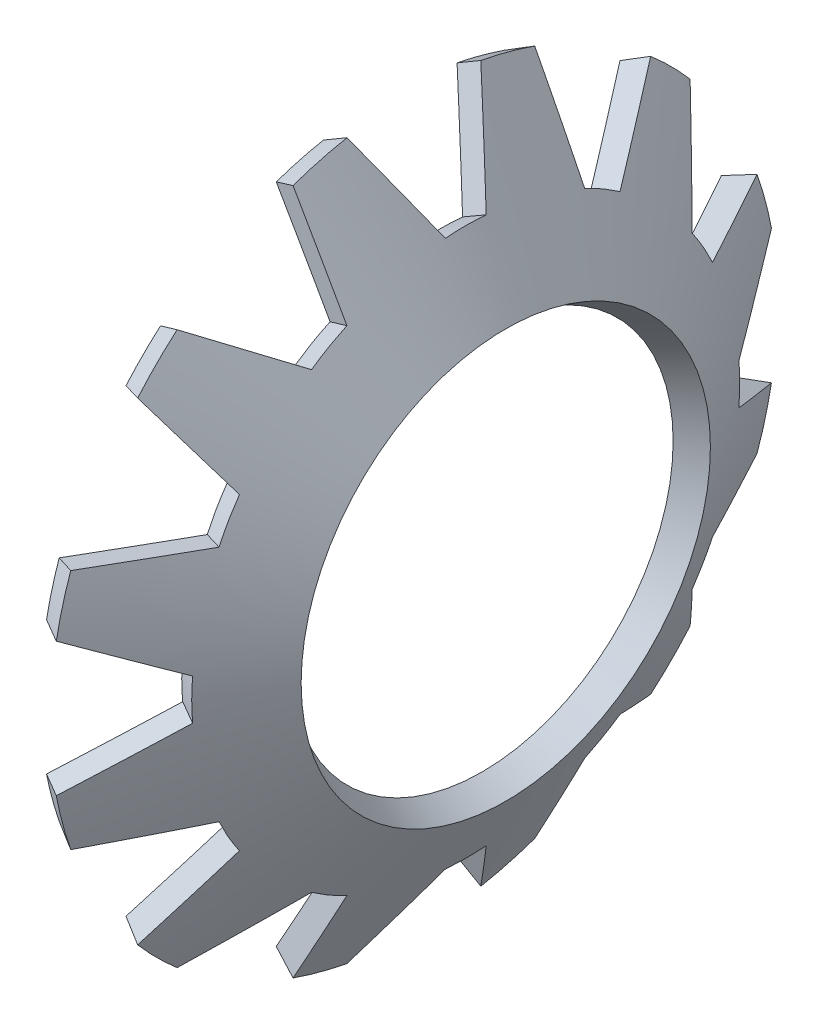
ISO-10303-21;
HEADER;
FILE_DESCRIPTION(('STEP AP214'),'2;1');
FILE_NAME('part.step','',(''),(''),'','','');
FILE_SCHEMA(('AUTOMOTIVE_DESIGN { 1 0 10303 214 1 1 1 1 }'));
ENDSEC;
DATA;
#1=APPLICATION_CONTEXT('core data for automotive mechanical design processes');
#2=APPLICATION_PROTOCOL_DEFINITION('international standard','automotive_design',2000,#1);
#3=PRODUCT_CONTEXT('',#1,'mechanical');
#4=PRODUCT('Part','Part','',(#3));
#5=PRODUCT_RELATED_PRODUCT_CATEGORY('part','',(#4));
#6=PRODUCT_DEFINITION_FORMATION('','',#4);
#7=PRODUCT_DEFINITION_CONTEXT('part definition',#1,'design');
#8=PRODUCT_DEFINITION('design','',#6,#7);
#9=PRODUCT_DEFINITION_SHAPE('','',#8);
#10=(LENGTH_UNIT() NAMED_UNIT(*) SI_UNIT(.MILLI.,.METRE.));
#11=(NAMED_UNIT(*) PLANE_ANGLE_UNIT() SI_UNIT($,.RADIAN.));
#12=(NAMED_UNIT(*) SI_UNIT($,.STERADIAN.) SOLID_ANGLE_UNIT());
#13=UNCERTAINTY_MEASURE_WITH_UNIT(LENGTH_MEASURE(1.E-05),#10,'distance_accuracy_value','');
#14=(GEOMETRIC_REPRESENTATION_CONTEXT(3) GLOBAL_UNCERTAINTY_ASSIGNED_CONTEXT((#13)) GLOBAL_UNIT_ASSIGNED_CONTEXT((#10,
#11,#12)) REPRESENTATION_CONTEXT('',''));
#15=CARTESIAN_POINT('',(0.,0.,0.));
#16=DIRECTION('',(0.,0.,1.));
#17=DIRECTION('',(1.,0.,0.));
#18=AXIS2_PLACEMENT_3D('',#15,#16,#17);
#19=CARTESIAN_POINT('',(-5.13841739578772,0.,0.));
#20=DIRECTION('',(1.,0.,0.));
#21=DIRECTION('',(0.,0.,-1.));
#22=AXIS2_PLACEMENT_3D('',#19,#20,#21);
#23=CONICAL_SURFACE('',#22,7.7,0.523598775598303);
#24=CARTESIAN_POINT('',(-5.13861739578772,5.81110132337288,5.0516653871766));
#25=CARTESIAN_POINT('',(-5.05196155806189,5.85500422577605,5.07741972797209));
#26=CARTESIAN_POINT('',(-4.96529903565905,5.89890039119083,5.1031630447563));
#27=CARTESIAN_POINT('',(-4.79196062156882,5.98667924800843,5.15462763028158));
#28=CARTESIAN_POINT('',(-4.70528472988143,6.03056193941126,5.18034889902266));
#29=CARTESIAN_POINT('',(-4.61860215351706,6.07443789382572,5.20605914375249));
#30=B_SPLINE_CURVE_WITH_KNOTS('',3,(#24,#25,#26,#27,#28,#29),.UNSPECIFIED.,.F.,.F.,(4,2,4),(0.,
0.301496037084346,0.602992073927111),.UNSPECIFIED.);
#31=CARTESIAN_POINT('',(-5.13841739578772,5.81120265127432,5.05172482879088));
#32=VERTEX_POINT('',#31);
#33=CARTESIAN_POINT('',(-4.61880215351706,6.07433665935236,5.20599982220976));
#34=VERTEX_POINT('',#33);
#35=EDGE_CURVE('E1209',#32,#34,#30,.T.);
#36=ORIENTED_EDGE('',*,*,#35,.F.);
#37=CARTESIAN_POINT('',(-5.13841739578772,0.,0.));
#38=DIRECTION('',(-1.,0.,0.));
#39=DIRECTION('',(0.,0.,1.));
#40=AXIS2_PLACEMENT_3D('',#37,#38,#39);
#41=CIRCLE('',#40,7.7);
#42=CARTESIAN_POINT('',(-5.13841739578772,5.05172482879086,5.81120265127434));
#43=VERTEX_POINT('',#42);
#44=EDGE_CURVE('E734',#43,#32,#41,.T.);
#45=ORIENTED_EDGE('',*,*,#44,.F.);
#46=CARTESIAN_POINT('',(-4.61860215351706,5.20605914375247,6.07443789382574));
#47=CARTESIAN_POINT('',(-4.70528472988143,5.18034889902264,6.03056193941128));
#48=CARTESIAN_POINT('',(-4.79196062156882,5.15462763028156,5.98667924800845));
#49=CARTESIAN_POINT('',(-4.96529903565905,5.10316304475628,5.89890039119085));
#50=CARTESIAN_POINT('',(-5.05196155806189,5.07741972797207,5.85500422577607));
#51=CARTESIAN_POINT('',(-5.13861739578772,5.05166538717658,5.8111013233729));
#52=B_SPLINE_CURVE_WITH_KNOTS('',3,(#46,#47,#48,#49,#50,#51),.UNSPECIFIED.,.F.,.F.,(4,2,4),(0.,
0.301496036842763,0.60299207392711),.UNSPECIFIED.);
#53=CARTESIAN_POINT('',(-4.61880215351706,5.20599982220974,6.07433665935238));
#54=VERTEX_POINT('',#53);
#55=EDGE_CURVE('E351',#54,#43,#52,.T.);
#56=ORIENTED_EDGE('',*,*,#55,.F.);
#57=CARTESIAN_POINT('',(-4.61880215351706,0.,0.));
#58=DIRECTION('',(-1.,0.,0.));
#59=DIRECTION('',(0.,0.,1.));
#60=AXIS2_PLACEMENT_3D('',#57,#58,#59);
#61=CIRCLE('',#60,8.);
#62=EDGE_CURVE('E706',#54,#34,#61,.T.);
#63=ORIENTED_EDGE('',*,*,#62,.T.);
#64=EDGE_LOOP('',(#36,#45,#56,#63));
#65=FACE_BOUND('',#64,.T.);
#66=ADVANCED_FACE('F31',(#65),#23,.T.);
#67=CARTESIAN_POINT('',(-4.61860215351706,-6.07443789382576,5.20605914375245));
#68=CARTESIAN_POINT('',(-4.70528472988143,-6.0305619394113,5.18034889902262));
#69=CARTESIAN_POINT('',(-4.79196062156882,-5.98667924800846,5.15462763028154));
#70=CARTESIAN_POINT('',(-4.96529903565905,-5.89890039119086,5.10316304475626));
#71=CARTESIAN_POINT('',(-5.05196155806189,-5.85500422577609,5.07741972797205));
#72=CARTESIAN_POINT('',(-5.13861739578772,-5.81110132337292,5.05166538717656));
#73=B_SPLINE_CURVE_WITH_KNOTS('',3,(#67,#68,#69,#70,#71,#72),.UNSPECIFIED.,.F.,.F.,(4,2,4),(0.,
0.301496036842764,0.602992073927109),.UNSPECIFIED.);
#74=CARTESIAN_POINT('',(-4.61880215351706,-6.0743366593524,5.20599982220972));
#75=VERTEX_POINT('',#74);
#76=CARTESIAN_POINT('',(-5.13841739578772,-5.81120265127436,5.05172482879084));
#77=VERTEX_POINT('',#76);
#78=EDGE_CURVE('E967',#75,#77,#73,.T.);
#79=ORIENTED_EDGE('',*,*,#78,.F.);
#80=CARTESIAN_POINT('',(-4.61880215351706,-5.20599982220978,6.07433665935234));
#81=VERTEX_POINT('',#80);
#82=EDGE_CURVE('E708',#75,#81,#61,.T.);
#83=ORIENTED_EDGE('',*,*,#82,.T.);
#84=CARTESIAN_POINT('',(-5.13861739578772,-5.05166538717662,5.81110132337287));
#85=CARTESIAN_POINT('',(-5.05196155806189,-5.07741972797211,5.85500422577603));
#86=CARTESIAN_POINT('',(-4.96529903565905,-5.10316304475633,5.89890039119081));
#87=CARTESIAN_POINT('',(-4.79196062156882,-5.15462763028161,5.98667924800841));
#88=CARTESIAN_POINT('',(-4.70528472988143,-5.18034889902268,6.03056193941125));
#89=CARTESIAN_POINT('',(-4.61860215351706,-5.20605914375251,6.0744378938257));
#90=B_SPLINE_CURVE_WITH_KNOTS('',3,(#84,#85,#86,#87,#88,#89),.UNSPECIFIED.,.F.,.F.,(4,2,4),(0.,
0.301496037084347,0.60299207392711),.UNSPECIFIED.);
#91=CARTESIAN_POINT('',(-5.13841739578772,-5.0517248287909,5.8112026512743));
#92=VERTEX_POINT('',#91);
#93=EDGE_CURVE('E987',#92,#81,#90,.T.);
#94=ORIENTED_EDGE('',*,*,#93,.F.);
#95=EDGE_CURVE('E744',#77,#92,#41,.T.);
#96=ORIENTED_EDGE('',*,*,#95,.F.);
#97=EDGE_LOOP('',(#79,#83,#94,#96));
#98=FACE_BOUND('',#97,.T.);
#99=ADVANCED_FACE('F1075',(#98),#23,.T.);
#100=CARTESIAN_POINT('',(-5.13861739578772,-7.28042121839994,2.50672867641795));
#101=CARTESIAN_POINT('',(-5.05196155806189,-7.32467658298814,2.53187253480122));
#102=CARTESIAN_POINT('',(-4.96529903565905,-7.36891903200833,2.55701607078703));
#103=CARTESIAN_POINT('',(-4.79196062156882,-7.45737809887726,2.60730249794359));
#104=CARTESIAN_POINT('',(-4.70528472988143,-7.50159471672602,2.63244538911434));
#105=CARTESIAN_POINT('',(-4.61860215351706,-7.54579841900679,2.65758795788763));
#106=B_SPLINE_CURVE_WITH_KNOTS('',3,(#100,#101,#102,#103,#104,#105),.UNSPECIFIED.,.F.,.F.,(4,2,
4),(0.,0.301496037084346,0.60299207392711),.UNSPECIFIED.);
#107=CARTESIAN_POINT('',(-5.13841739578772,-7.28052336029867,2.50678670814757));
#108=VERTEX_POINT('',#107);
#109=CARTESIAN_POINT('',(-4.61880215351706,-7.54569642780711,2.65752994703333));
#110=VERTEX_POINT('',#109);
#111=EDGE_CURVE('E948',#108,#110,#106,.T.);
#112=ORIENTED_EDGE('',*,*,#111,.F.);
#113=CARTESIAN_POINT('',(-5.13841739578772,-7.5585115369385,1.46932070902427));
#114=VERTEX_POINT('',#113);
#115=EDGE_CURVE('E749',#114,#108,#41,.T.);
#116=ORIENTED_EDGE('',*,*,#115,.F.);
#117=CARTESIAN_POINT('',(-4.61860215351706,-7.86364710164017,1.47136052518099));
#118=CARTESIAN_POINT('',(-4.70528472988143,-7.81279428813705,1.47103277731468));
#119=CARTESIAN_POINT('',(-4.79196062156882,-7.76193012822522,1.47069885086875));
#120=CARTESIAN_POINT('',(-4.96529903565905,-7.66017911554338,1.47001864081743));
#121=CARTESIAN_POINT('',(-5.05196155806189,-7.60929226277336,1.46967235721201));
#122=CARTESIAN_POINT('',(-5.13861739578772,-7.5583940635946,1.46931989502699));
#123=B_SPLINE_CURVE_WITH_KNOTS('',3,(#117,#118,#119,#120,#121,#122),.UNSPECIFIED.,.F.,.F.,(4,2,
4),(0.,0.301496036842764,0.60299207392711),.UNSPECIFIED.);
#124=CARTESIAN_POINT('',(-4.61880215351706,-7.86352976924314,1.47135976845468));
#125=VERTEX_POINT('',#124);
#126=EDGE_CURVE('E925',#125,#114,#123,.T.);
#127=ORIENTED_EDGE('',*,*,#126,.F.);
#128=EDGE_CURVE('E1255',#125,#110,#61,.T.);
#129=ORIENTED_EDGE('',*,*,#128,.T.);
#130=EDGE_LOOP('',(#112,#116,#127,#129));
#131=FACE_BOUND('',#130,.T.);
#132=ADVANCED_FACE('F1080',(#131),#23,.T.);
#133=CARTESIAN_POINT('',(-5.13861739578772,-5.81110132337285,-5.05166538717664));
#134=CARTESIAN_POINT('',(-5.05196155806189,-5.85500422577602,-5.07741972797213));
#135=CARTESIAN_POINT('',(-4.96529903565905,-5.89890039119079,-5.10316304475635));
#136=CARTESIAN_POINT('',(-4.79196062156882,-5.98667924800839,-5.15462763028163));
#137=CARTESIAN_POINT('',(-4.70528472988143,-6.03056193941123,-5.18034889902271));
#138=CARTESIAN_POINT('',(-4.61860215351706,-6.07443789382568,-5.20605914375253));
#139=B_SPLINE_CURVE_WITH_KNOTS('',3,(#133,#134,#135,#136,#137,#138),.UNSPECIFIED.,.F.,.F.,(4,2,
4),(0.,0.301496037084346,0.60299207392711),.UNSPECIFIED.);
#140=CARTESIAN_POINT('',(-5.13841739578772,-5.81120265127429,-5.05172482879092));
#141=VERTEX_POINT('',#140);
#142=CARTESIAN_POINT('',(-4.61880215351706,-6.07433665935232,-5.2059998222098));
#143=VERTEX_POINT('',#142);
#144=EDGE_CURVE('E1481',#141,#143,#139,.T.);
#145=ORIENTED_EDGE('',*,*,#144,.F.);
#146=CARTESIAN_POINT('',(-5.13841739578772,-5.05172482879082,-5.81120265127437));
#147=VERTEX_POINT('',#146);
#148=EDGE_CURVE('E759',#147,#141,#41,.T.);
#149=ORIENTED_EDGE('',*,*,#148,.F.);
#150=CARTESIAN_POINT('',(-4.61860215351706,-5.20605914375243,-6.07443789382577));
#151=CARTESIAN_POINT('',(-4.70528472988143,-5.1803488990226,-6.03056193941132));
#152=CARTESIAN_POINT('',(-4.79196062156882,-5.15462763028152,-5.98667924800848));
#153=CARTESIAN_POINT('',(-4.96529903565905,-5.10316304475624,-5.89890039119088));
#154=CARTESIAN_POINT('',(-5.05196155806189,-5.07741972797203,-5.8550042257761));
#155=CARTESIAN_POINT('',(-5.13861739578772,-5.05166538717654,-5.81110132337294));
#156=B_SPLINE_CURVE_WITH_KNOTS('',3,(#150,#151,#152,#153,#154,#155),.UNSPECIFIED.,.F.,.F.,(4,2,
4),(0.,0.301496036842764,0.60299207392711),.UNSPECIFIED.);
#157=CARTESIAN_POINT('',(-4.61880215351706,-5.20599982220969,-6.07433665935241));
#158=VERTEX_POINT('',#157);
#159=EDGE_CURVE('E861',#158,#147,#156,.T.);
#160=ORIENTED_EDGE('',*,*,#159,.F.);
#161=EDGE_CURVE('E1257',#158,#143,#61,.T.);
#162=ORIENTED_EDGE('',*,*,#161,.T.);
#163=EDGE_LOOP('',(#145,#149,#160,#162));
#164=FACE_BOUND('',#163,.T.);
#165=ADVANCED_FACE('F1488',(#164),#23,.T.);
#166=CARTESIAN_POINT('',(-5.13861739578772,-7.55839406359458,-1.46931989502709));
#167=CARTESIAN_POINT('',(-5.05196155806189,-7.60929226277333,-1.46967235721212));
#168=CARTESIAN_POINT('',(-4.96529903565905,-7.66017911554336,-1.47001864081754));
#169=CARTESIAN_POINT('',(-4.79196062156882,-7.7619301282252,-1.47069885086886));
#170=CARTESIAN_POINT('',(-4.70528472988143,-7.81279428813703,-1.47103277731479));
#171=CARTESIAN_POINT('',(-4.61860215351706,-7.86364710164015,-1.47136052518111));
#172=B_SPLINE_CURVE_WITH_KNOTS('',3,(#166,#167,#168,#169,#170,#171),.UNSPECIFIED.,.F.,.F.,(4,2,
4),(0.,0.301496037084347,0.602992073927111),.UNSPECIFIED.);
#173=CARTESIAN_POINT('',(-5.13841739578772,-7.55851153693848,-1.46932070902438));
#174=VERTEX_POINT('',#173);
#175=CARTESIAN_POINT('',(-4.61880215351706,-7.86352976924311,-1.47135976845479));
#176=VERTEX_POINT('',#175);
#177=EDGE_CURVE('E905',#174,#176,#172,.T.);
#178=ORIENTED_EDGE('',*,*,#177,.F.);
#179=CARTESIAN_POINT('',(-5.13841739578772,-7.28052336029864,-2.50678670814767));
#180=VERTEX_POINT('',#179);
#181=EDGE_CURVE('E754',#180,#174,#41,.T.);
#182=ORIENTED_EDGE('',*,*,#181,.F.);
#183=CARTESIAN_POINT('',(-4.61860215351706,-7.54579841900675,-2.65758795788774));
#184=CARTESIAN_POINT('',(-4.70528472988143,-7.50159471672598,-2.63244538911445));
#185=CARTESIAN_POINT('',(-4.79196062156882,-7.45737809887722,-2.6073024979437));
#186=CARTESIAN_POINT('',(-4.96529903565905,-7.36891903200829,-2.55701607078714));
#187=CARTESIAN_POINT('',(-5.05196155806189,-7.3246765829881,-2.53187253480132));
#188=CARTESIAN_POINT('',(-5.13861739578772,-7.28042121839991,-2.50672867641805));
#189=B_SPLINE_CURVE_WITH_KNOTS('',3,(#183,#184,#185,#186,#187,#188),.UNSPECIFIED.,.F.,.F.,(4,2,
4),(0.,0.301496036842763,0.602992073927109),.UNSPECIFIED.);
#190=CARTESIAN_POINT('',(-4.61880215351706,-7.54569642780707,-2.65752994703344));
#191=VERTEX_POINT('',#190);
#192=EDGE_CURVE('E874',#191,#180,#189,.T.);
#193=ORIENTED_EDGE('',*,*,#192,.F.);
#194=EDGE_CURVE('E1256',#191,#176,#61,.T.);
#195=ORIENTED_EDGE('',*,*,#194,.T.);
#196=EDGE_LOOP('',(#178,#182,#193,#195));
#197=FACE_BOUND('',#196,.T.);
#198=ADVANCED_FACE('F1479',(#197),#23,.T.);
#199=CARTESIAN_POINT('',(-5.13861739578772,-2.50672867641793,-7.28042121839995));
#200=CARTESIAN_POINT('',(-5.05196155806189,-2.5318725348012,-7.32467658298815));
#201=CARTESIAN_POINT('',(-4.96529903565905,-2.55701607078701,-7.36891903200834));
#202=CARTESIAN_POINT('',(-4.79196062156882,-2.60730249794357,-7.45737809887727));
#203=CARTESIAN_POINT('',(-4.70528472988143,-2.63244538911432,-7.50159471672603));
#204=CARTESIAN_POINT('',(-4.61860215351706,-2.65758795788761,-7.5457984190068));
#205=B_SPLINE_CURVE_WITH_KNOTS('',3,(#199,#200,#201,#202,#203,#204),.UNSPECIFIED.,.F.,.F.,(4,2,
4),(0.,0.301496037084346,0.60299207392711),.UNSPECIFIED.);
#206=CARTESIAN_POINT('',(-5.13841739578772,-2.50678670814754,-7.28052336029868));
#207=VERTEX_POINT('',#206);
#208=CARTESIAN_POINT('',(-4.61880215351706,-2.6575299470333,-7.54569642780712));
#209=VERTEX_POINT('',#208);
#210=EDGE_CURVE('E835',#207,#209,#205,.T.);
#211=ORIENTED_EDGE('',*,*,#210,.F.);
#212=CARTESIAN_POINT('',(-5.13841739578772,-1.46932070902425,-7.5585115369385));
#213=VERTEX_POINT('',#212);
#214=EDGE_CURVE('E764',#213,#207,#41,.T.);
#215=ORIENTED_EDGE('',*,*,#214,.F.);
#216=CARTESIAN_POINT('',(-4.61860215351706,-1.47136052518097,-7.86364710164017));
#217=CARTESIAN_POINT('',(-4.70528472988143,-1.47103277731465,-7.81279428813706));
#218=CARTESIAN_POINT('',(-4.79196062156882,-1.47069885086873,-7.76193012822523));
#219=CARTESIAN_POINT('',(-4.96529903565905,-1.4700186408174,-7.66017911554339));
#220=CARTESIAN_POINT('',(-5.05196155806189,-1.46967235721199,-7.60929226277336));
#221=CARTESIAN_POINT('',(-5.13861739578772,-1.46931989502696,-7.5583940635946));
#222=B_SPLINE_CURVE_WITH_KNOTS('',3,(#216,#217,#218,#219,#220,#221),.UNSPECIFIED.,.F.,.F.,(4,2,
4),(0.,0.301496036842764,0.60299207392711),.UNSPECIFIED.);
#223=CARTESIAN_POINT('',(-4.61880215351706,-1.47135976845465,-7.86352976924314));
#224=VERTEX_POINT('',#223);
#225=EDGE_CURVE('E823',#224,#213,#222,.T.);
#226=ORIENTED_EDGE('',*,*,#225,.F.);
#227=EDGE_CURVE('E1490',#224,#209,#61,.T.);
#228=ORIENTED_EDGE('',*,*,#227,.T.);
#229=EDGE_LOOP('',(#211,#215,#226,#228));
#230=FACE_BOUND('',#229,.T.);
#231=ADVANCED_FACE('F1509',(#230),#23,.T.);
#232=CARTESIAN_POINT('',(-5.13861739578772,5.05166538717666,-5.81110132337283));
#233=CARTESIAN_POINT('',(-5.05196155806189,5.07741972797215,-5.855004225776));
#234=CARTESIAN_POINT('',(-4.96529903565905,5.10316304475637,-5.89890039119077));
#235=CARTESIAN_POINT('',(-4.79196062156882,5.15462763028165,-5.98667924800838));
#236=CARTESIAN_POINT('',(-4.70528472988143,5.18034889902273,-6.03056193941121));
#237=CARTESIAN_POINT('',(-4.61860215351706,5.20605914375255,-6.07443789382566));
#238=B_SPLINE_CURVE_WITH_KNOTS('',3,(#232,#233,#234,#235,#236,#237),.UNSPECIFIED.,.F.,.F.,(4,2,
4),(0.,0.301496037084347,0.60299207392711),.UNSPECIFIED.);
#239=CARTESIAN_POINT('',(-5.13841739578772,5.05172482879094,-5.81120265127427));
#240=VERTEX_POINT('',#239);
#241=CARTESIAN_POINT('',(-4.61880215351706,5.20599982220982,-6.0743366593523));
#242=VERTEX_POINT('',#241);
#243=EDGE_CURVE('E1498',#240,#242,#238,.T.);
#244=ORIENTED_EDGE('',*,*,#243,.F.);
#245=CARTESIAN_POINT('',(-5.13841739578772,5.81120265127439,-5.0517248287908));
#246=VERTEX_POINT('',#245);
#247=EDGE_CURVE('E727',#246,#240,#41,.T.);
#248=ORIENTED_EDGE('',*,*,#247,.F.);
#249=CARTESIAN_POINT('',(-4.61860215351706,6.07443789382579,-5.2060591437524));
#250=CARTESIAN_POINT('',(-4.70528472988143,6.03056193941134,-5.18034889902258));
#251=CARTESIAN_POINT('',(-4.79196062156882,5.9866792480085,-5.1546276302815));
#252=CARTESIAN_POINT('',(-4.96529903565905,5.8989003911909,-5.10316304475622));
#253=CARTESIAN_POINT('',(-5.05196155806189,5.85500422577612,-5.07741972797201));
#254=CARTESIAN_POINT('',(-5.13861739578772,5.81110132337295,-5.05166538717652));
#255=B_SPLINE_CURVE_WITH_KNOTS('',3,(#249,#250,#251,#252,#253,#254),.UNSPECIFIED.,.F.,.F.,(4,2,
4),(0.,0.301496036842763,0.602992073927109),.UNSPECIFIED.);
#256=CARTESIAN_POINT('',(-4.61880215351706,6.07433665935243,-5.20599982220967));
#257=VERTEX_POINT('',#256);
#258=EDGE_CURVE('E1012',#257,#246,#255,.T.);
#259=ORIENTED_EDGE('',*,*,#258,.F.);
#260=EDGE_CURVE('E714',#257,#242,#61,.T.);
#261=ORIENTED_EDGE('',*,*,#260,.T.);
#262=EDGE_LOOP('',(#244,#248,#259,#261));
#263=FACE_BOUND('',#262,.T.);
#264=ADVANCED_FACE('F1497',(#263),#23,.T.);
#265=CARTESIAN_POINT('',(-5.13861739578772,7.28042121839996,-2.5067286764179));
#266=CARTESIAN_POINT('',(-5.05196155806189,7.32467658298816,-2.53187253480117));
#267=CARTESIAN_POINT('',(-4.96529903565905,7.36891903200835,-2.55701607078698));
#268=CARTESIAN_POINT('',(-4.79196062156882,7.45737809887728,-2.60730249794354));
#269=CARTESIAN_POINT('',(-4.70528472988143,7.50159471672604,-2.63244538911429));
#270=CARTESIAN_POINT('',(-4.61860215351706,7.54579841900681,-2.65758795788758));
#271=B_SPLINE_CURVE_WITH_KNOTS('',3,(#265,#266,#267,#268,#269,#270),.UNSPECIFIED.,.F.,.F.,(4,2,
4),(0.,0.301496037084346,0.60299207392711),.UNSPECIFIED.);
#272=CARTESIAN_POINT('',(-5.13841739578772,7.28052336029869,-2.50678670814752));
#273=VERTEX_POINT('',#272);
#274=CARTESIAN_POINT('',(-4.61880215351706,7.54569642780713,-2.65752994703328));
#275=VERTEX_POINT('',#274);
#276=EDGE_CURVE('E1043',#273,#275,#271,.T.);
#277=ORIENTED_EDGE('',*,*,#276,.F.);
#278=CARTESIAN_POINT('',(-5.13841739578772,7.55851153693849,-1.46932070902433));
#279=VERTEX_POINT('',#278);
#280=EDGE_CURVE('E725',#279,#273,#41,.T.);
#281=ORIENTED_EDGE('',*,*,#280,.F.);
#282=CARTESIAN_POINT('',(-4.61860215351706,7.86364710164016,-1.47136052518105));
#283=CARTESIAN_POINT('',(-4.70528472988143,7.81279428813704,-1.47103277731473));
#284=CARTESIAN_POINT('',(-4.79196062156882,7.76193012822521,-1.47069885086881));
#285=CARTESIAN_POINT('',(-4.96529903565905,7.66017911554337,-1.47001864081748));
#286=CARTESIAN_POINT('',(-5.05196155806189,7.60929226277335,-1.46967235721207));
#287=CARTESIAN_POINT('',(-5.13861739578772,7.55839406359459,-1.46931989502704));
#288=B_SPLINE_CURVE_WITH_KNOTS('',3,(#282,#283,#284,#285,#286,#287),.UNSPECIFIED.,.F.,.F.,(4,2,
4),(0.,0.301496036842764,0.60299207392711),.UNSPECIFIED.);
#289=CARTESIAN_POINT('',(-4.61880215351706,7.86352976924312,-1.47135976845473));
#290=VERTEX_POINT('',#289);
#291=EDGE_CURVE('E1127',#290,#279,#288,.T.);
#292=ORIENTED_EDGE('',*,*,#291,.F.);
#293=EDGE_CURVE('E710',#290,#275,#61,.T.);
#294=ORIENTED_EDGE('',*,*,#293,.T.);
#295=EDGE_LOOP('',(#277,#281,#292,#294));
#296=FACE_BOUND('',#295,.T.);
#297=ADVANCED_FACE('F1143',(#296),#23,.T.);
#298=CARTESIAN_POINT('',(-4.61860215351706,-2.65758795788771,7.54579841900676));
#299=CARTESIAN_POINT('',(-4.70528472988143,-2.63244538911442,7.50159471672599));
#300=CARTESIAN_POINT('',(-4.79196062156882,-2.60730249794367,7.45737809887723));
#301=CARTESIAN_POINT('',(-4.96529903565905,-2.55701607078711,7.3689190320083));
#302=CARTESIAN_POINT('',(-5.05196155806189,-2.5318725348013,7.32467658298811));
#303=CARTESIAN_POINT('',(-5.13861739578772,-2.50672867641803,7.28042121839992));
#304=B_SPLINE_CURVE_WITH_KNOTS('',3,(#298,#299,#300,#301,#302,#303),.UNSPECIFIED.,.F.,.F.,(4,2,
4),(0.,0.301496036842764,0.60299207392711),.UNSPECIFIED.);
#305=CARTESIAN_POINT('',(-4.61880215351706,-2.65752994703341,7.54569642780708));
#306=VERTEX_POINT('',#305);
#307=CARTESIAN_POINT('',(-5.13841739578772,-2.50678670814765,7.28052336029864));
#308=VERTEX_POINT('',#307);
#309=EDGE_CURVE('E1002',#306,#308,#304,.T.);
#310=ORIENTED_EDGE('',*,*,#309,.F.);
#311=CARTESIAN_POINT('',(-4.61880215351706,-1.47135976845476,7.86352976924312));
#312=VERTEX_POINT('',#311);
#313=EDGE_CURVE('E705',#306,#312,#61,.T.);
#314=ORIENTED_EDGE('',*,*,#313,.T.);
#315=CARTESIAN_POINT('',(-5.13861739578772,-1.46931989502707,7.55839406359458));
#316=CARTESIAN_POINT('',(-5.05196155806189,-1.46967235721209,7.60929226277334));
#317=CARTESIAN_POINT('',(-4.96529903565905,-1.47001864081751,7.66017911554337));
#318=CARTESIAN_POINT('',(-4.79196062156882,-1.47069885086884,7.76193012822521));
#319=CARTESIAN_POINT('',(-4.70528472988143,-1.47103277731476,7.81279428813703));
#320=CARTESIAN_POINT('',(-4.61860215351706,-1.47136052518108,7.86364710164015));
#321=B_SPLINE_CURVE_WITH_KNOTS('',3,(#315,#316,#317,#318,#319,#320),.UNSPECIFIED.,.F.,.F.,(4,2,
4),(0.,0.301496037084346,0.602992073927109),.UNSPECIFIED.);
#322=CARTESIAN_POINT('',(-5.13841739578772,-1.46932070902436,7.55851153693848));
#323=VERTEX_POINT('',#322);
#324=EDGE_CURVE('E1267',#323,#312,#321,.T.);
#325=ORIENTED_EDGE('',*,*,#324,.F.);
#326=EDGE_CURVE('E741',#308,#323,#41,.T.);
#327=ORIENTED_EDGE('',*,*,#326,.F.);
#328=EDGE_LOOP('',(#310,#314,#325,#327));
#329=FACE_BOUND('',#328,.T.);
#330=ADVANCED_FACE('F1314',(#329),#23,.T.);
#331=CARTESIAN_POINT('',(-5.13861739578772,1.46931989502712,-7.55839406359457));
#332=CARTESIAN_POINT('',(-5.05196155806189,1.46967235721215,-7.60929226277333));
#333=CARTESIAN_POINT('',(-4.96529903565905,1.47001864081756,-7.66017911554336));
#334=CARTESIAN_POINT('',(-4.79196062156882,1.47069885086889,-7.7619301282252));
#335=CARTESIAN_POINT('',(-4.70528472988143,1.47103277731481,-7.81279428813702));
#336=CARTESIAN_POINT('',(-4.61860215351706,1.47136052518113,-7.86364710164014));
#337=B_SPLINE_CURVE_WITH_KNOTS('',3,(#331,#332,#333,#334,#335,#336),.UNSPECIFIED.,.F.,.F.,(4,2,
4),(0.,0.301496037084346,0.602992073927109),.UNSPECIFIED.);
#338=CARTESIAN_POINT('',(-5.13841739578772,1.46932070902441,-7.55851153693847));
#339=VERTEX_POINT('',#338);
#340=CARTESIAN_POINT('',(-4.61880215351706,1.47135976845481,-7.86352976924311));
#341=VERTEX_POINT('',#340);
#342=EDGE_CURVE('E785',#339,#341,#337,.T.);
#343=ORIENTED_EDGE('',*,*,#342,.F.);
#344=CARTESIAN_POINT('',(-5.13841739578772,2.5067867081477,-7.28052336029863));
#345=VERTEX_POINT('',#344);
#346=EDGE_CURVE('E733',#345,#339,#41,.T.);
#347=ORIENTED_EDGE('',*,*,#346,.F.);
#348=CARTESIAN_POINT('',(-4.61860215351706,2.65758795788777,-7.54579841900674));
#349=CARTESIAN_POINT('',(-4.70528472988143,2.63244538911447,-7.50159471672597));
#350=CARTESIAN_POINT('',(-4.79196062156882,2.60730249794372,-7.45737809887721));
#351=CARTESIAN_POINT('',(-4.96529903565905,2.55701607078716,-7.36891903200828));
#352=CARTESIAN_POINT('',(-5.05196155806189,2.53187253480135,-7.3246765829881));
#353=CARTESIAN_POINT('',(-5.13861739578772,2.50672867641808,-7.2804212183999));
#354=B_SPLINE_CURVE_WITH_KNOTS('',3,(#348,#349,#350,#351,#352,#353),.UNSPECIFIED.,.F.,.F.,(4,2,
4),(0.,0.301496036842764,0.60299207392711),.UNSPECIFIED.);
#355=CARTESIAN_POINT('',(-4.61880215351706,2.65752994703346,-7.54569642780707));
#356=VERTEX_POINT('',#355);
#357=EDGE_CURVE('E784',#356,#345,#354,.T.);
#358=ORIENTED_EDGE('',*,*,#357,.F.);
#359=EDGE_CURVE('E786',#356,#341,#61,.T.);
#360=ORIENTED_EDGE('',*,*,#359,.T.);
#361=EDGE_LOOP('',(#343,#347,#358,#360));
#362=FACE_BOUND('',#361,.T.);
#363=ADVANCED_FACE('F783',(#362),#23,.T.);
#364=CARTESIAN_POINT('',(-4.61860215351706,1.47136052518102,7.86364710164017));
#365=CARTESIAN_POINT('',(-4.70528472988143,1.4710327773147,7.81279428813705));
#366=CARTESIAN_POINT('',(-4.79196062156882,1.47069885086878,7.76193012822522));
#367=CARTESIAN_POINT('',(-4.96529903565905,1.47001864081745,7.66017911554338));
#368=CARTESIAN_POINT('',(-5.05196155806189,1.46967235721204,7.60929226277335));
#369=CARTESIAN_POINT('',(-5.13861739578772,1.46931989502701,7.5583940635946));
#370=B_SPLINE_CURVE_WITH_KNOTS('',3,(#364,#365,#366,#367,#368,#369),.UNSPECIFIED.,.F.,.F.,(4,2,
4),(0.,0.301496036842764,0.60299207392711),.UNSPECIFIED.);
#371=CARTESIAN_POINT('',(-4.61880215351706,1.4713597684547,7.86352976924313));
#372=VERTEX_POINT('',#371);
#373=CARTESIAN_POINT('',(-5.13841739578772,1.4693207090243,7.55851153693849));
#374=VERTEX_POINT('',#373);
#375=EDGE_CURVE('E704',#372,#374,#370,.T.);
#376=ORIENTED_EDGE('',*,*,#375,.F.);
#377=CARTESIAN_POINT('',(-4.61880215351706,2.65752994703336,7.5456964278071));
#378=VERTEX_POINT('',#377);
#379=EDGE_CURVE('E697',#372,#378,#61,.T.);
#380=ORIENTED_EDGE('',*,*,#379,.T.);
#381=CARTESIAN_POINT('',(-5.13861739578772,2.50672867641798,7.28042121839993));
#382=CARTESIAN_POINT('',(-5.05196155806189,2.53187253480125,7.32467658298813));
#383=CARTESIAN_POINT('',(-4.96529903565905,2.55701607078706,7.36891903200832));
#384=CARTESIAN_POINT('',(-4.79196062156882,2.60730249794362,7.45737809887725));
#385=CARTESIAN_POINT('',(-4.70528472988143,2.63244538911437,7.50159471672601));
#386=CARTESIAN_POINT('',(-4.61860215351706,2.65758795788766,7.54579841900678));
#387=B_SPLINE_CURVE_WITH_KNOTS('',3,(#381,#382,#383,#384,#385,#386),.UNSPECIFIED.,.F.,.F.,(4,2,
4),(0.,0.301496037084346,0.602992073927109),.UNSPECIFIED.);
#388=CARTESIAN_POINT('',(-5.13841739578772,2.50678670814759,7.28052336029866));
#389=VERTEX_POINT('',#388);
#390=EDGE_CURVE('E371',#389,#378,#387,.T.);
#391=ORIENTED_EDGE('',*,*,#390,.F.);
#392=EDGE_CURVE('E739',#374,#389,#41,.T.);
#393=ORIENTED_EDGE('',*,*,#392,.F.);
#394=EDGE_LOOP('',(#376,#380,#391,#393));
#395=FACE_BOUND('',#394,.T.);
#396=ADVANCED_FACE('F702',(#395),#23,.T.);
#397=CARTESIAN_POINT('',(-4.61860215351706,7.54579841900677,2.65758795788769));
#398=CARTESIAN_POINT('',(-4.70528472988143,7.501594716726,2.6324453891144));
#399=CARTESIAN_POINT('',(-4.79196062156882,7.45737809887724,2.60730249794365));
#400=CARTESIAN_POINT('',(-4.96529903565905,7.36891903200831,2.55701607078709));
#401=CARTESIAN_POINT('',(-5.05196155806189,7.32467658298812,2.53187253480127));
#402=CARTESIAN_POINT('',(-5.13861739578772,7.28042121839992,2.506728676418));
#403=B_SPLINE_CURVE_WITH_KNOTS('',3,(#397,#398,#399,#400,#401,#402),.UNSPECIFIED.,.F.,.F.,(4,2,
4),(0.,0.301496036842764,0.60299207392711),.UNSPECIFIED.);
#404=CARTESIAN_POINT('',(-4.61880215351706,7.54569642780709,2.65752994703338));
#405=VERTEX_POINT('',#404);
#406=CARTESIAN_POINT('',(-5.13841739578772,7.28052336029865,2.50678670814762));
#407=VERTEX_POINT('',#406);
#408=EDGE_CURVE('E1091',#405,#407,#403,.T.);
#409=ORIENTED_EDGE('',*,*,#408,.F.);
#410=CARTESIAN_POINT('',(-4.61880215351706,7.86352976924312,1.47135976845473));
#411=VERTEX_POINT('',#410);
#412=EDGE_CURVE('E709',#405,#411,#61,.T.);
#413=ORIENTED_EDGE('',*,*,#412,.T.);
#414=CARTESIAN_POINT('',(-5.13861739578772,7.55839406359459,1.46931989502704));
#415=CARTESIAN_POINT('',(-5.05196155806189,7.60929226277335,1.46967235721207));
#416=CARTESIAN_POINT('',(-4.96529903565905,7.66017911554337,1.47001864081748));
#417=CARTESIAN_POINT('',(-4.79196062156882,7.76193012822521,1.47069885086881));
#418=CARTESIAN_POINT('',(-4.70528472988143,7.81279428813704,1.47103277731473));
#419=CARTESIAN_POINT('',(-4.61860215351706,7.86364710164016,1.47136052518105));
#420=B_SPLINE_CURVE_WITH_KNOTS('',3,(#414,#415,#416,#417,#418,#419),.UNSPECIFIED.,.F.,.F.,(4,2,
4),(0.,0.301496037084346,0.602992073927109),.UNSPECIFIED.);
#421=CARTESIAN_POINT('',(-5.13841739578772,7.55851153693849,1.46932070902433));
#422=VERTEX_POINT('',#421);
#423=EDGE_CURVE('E1102',#422,#411,#420,.T.);
#424=ORIENTED_EDGE('',*,*,#423,.F.);
#425=EDGE_CURVE('E724',#407,#422,#41,.T.);
#426=ORIENTED_EDGE('',*,*,#425,.F.);
#427=EDGE_LOOP('',(#409,#413,#424,#426));
#428=FACE_BOUND('',#427,.T.);
#429=ADVANCED_FACE('F33',(#428),#23,.T.);
#430=CARTESIAN_POINT('',(-5.13841739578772,0.,0.));
#431=DIRECTION('',(-1.,0.,0.));
#432=DIRECTION('',(0.,0.,1.));
#433=AXIS2_PLACEMENT_3D('',#430,#431,#432);
#434=CONICAL_SURFACE('',#433,7.7,1.04719755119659);
#435=CARTESIAN_POINT('',(-3.11769145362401,0.,0.));
#436=DIRECTION('',(-1.,0.,0.));
#437=DIRECTION('',(0.,0.,1.));
#438=AXIS2_PLACEMENT_3D('',#435,#436,#437);
#439=CIRCLE('',#438,4.2);
#440=CARTESIAN_POINT('',(-3.11769145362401,0.,4.2));
#441=VERTEX_POINT('',#440);
#442=EDGE_CURVE('E722',#441,#441,#439,.T.);
#443=ORIENTED_EDGE('',*,*,#442,.F.);
#444=EDGE_LOOP('',(#443));
#445=FACE_BOUND('',#444,.T.);
#446=ORIENTED_EDGE('',*,*,#44,.T.);
#447=CARTESIAN_POINT('',(-5.13861739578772,5.81139038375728,5.05203688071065));
#448=CARTESIAN_POINT('',(-4.9961434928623,5.67760930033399,4.82968124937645));
#449=CARTESIAN_POINT('',(-4.85414065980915,5.54357784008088,4.60717055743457));
#450=CARTESIAN_POINT('',(-4.57160013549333,5.27476340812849,4.16170188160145));
#451=CARTESIAN_POINT('',(-4.43106234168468,5.13998049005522,3.93874393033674));
#452=CARTESIAN_POINT('',(-4.15194850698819,4.86938762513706,3.49220240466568));
#453=CARTESIAN_POINT('',(-4.01337255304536,4.73357763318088,3.26861880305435));
#454=CARTESIAN_POINT('',(-3.80765732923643,4.52875929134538,2.93258585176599));
#455=CARTESIAN_POINT('',(-3.7394413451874,4.46030019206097,2.82046132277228));
#456=CARTESIAN_POINT('',(-3.60390092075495,4.32293047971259,2.59594751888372));
#457=CARTESIAN_POINT('',(-3.53657649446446,4.25401985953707,2.48355823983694));
#458=CARTESIAN_POINT('',(-3.4697857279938,4.18484191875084,2.37101427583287));
#459=B_SPLINE_CURVE_WITH_KNOTS('',3,(#447,#448,#449,#450,#451,#452,#453,#454,#455,#456,#457,
#458),.UNSPECIFIED.,.F.,.F.,(4,2,2,2,2,4),(0.,0.888116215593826,1.77616984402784,
2.66426270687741,3.10834036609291,3.55242503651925),.UNSPECIFIED.);
#460=CARTESIAN_POINT('',(-3.99723165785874,4.71696261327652,3.241553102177));
#461=VERTEX_POINT('',#460);
#462=EDGE_CURVE('E1207',#32,#461,#459,.T.);
#463=ORIENTED_EDGE('',*,*,#462,.T.);
#464=CARTESIAN_POINT('',(-3.99603579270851,4.60594840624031,3.39395589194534));
#465=CARTESIAN_POINT('',(-3.99700765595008,4.68477099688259,3.28984027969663));
#466=CARTESIAN_POINT('',(-3.9976836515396,4.75960637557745,3.18270287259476));
#467=CARTESIAN_POINT('',(-3.99843799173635,4.900913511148,2.96300559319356));
#468=CARTESIAN_POINT('',(-3.99851617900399,4.96738306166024,2.85044430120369));
#469=CARTESIAN_POINT('',(-3.99807143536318,5.09070487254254,2.62209891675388));
#470=CARTESIAN_POINT('',(-3.99755645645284,5.14767290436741,2.5063772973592));
#471=CARTESIAN_POINT('',(-3.99595409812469,5.25272585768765,2.27102155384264));
#472=CARTESIAN_POINT('',(-3.99486693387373,5.30081410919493,2.15138891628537));
#473=CARTESIAN_POINT('',(-3.99255592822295,5.37502996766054,1.94475271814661));
#474=CARTESIAN_POINT('',(-3.99146762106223,5.40344608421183,1.85856411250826));
#475=CARTESIAN_POINT('',(-3.990251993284,5.42957160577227,1.77169947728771));
#476=B_SPLINE_CURVE_WITH_KNOTS('',3,(#464,#465,#466,#467,#468,#469,#470,#471,#472,#473,#474,
#475),.UNSPECIFIED.,.F.,.F.,(4,2,2,2,2,4),(0.,0.391679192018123,0.783461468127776,
1.17005203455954,1.55649732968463,1.82864160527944),.UNSPECIFIED.);
#477=CARTESIAN_POINT('',(-3.99723165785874,5.16574864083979,2.46423290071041));
#478=VERTEX_POINT('',#477);
#479=EDGE_CURVE('E1205',#461,#478,#476,.T.);
#480=ORIENTED_EDGE('',*,*,#479,.T.);
#481=CARTESIAN_POINT('',(-3.4697857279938,4.14577955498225,2.43867227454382));
#482=CARTESIAN_POINT('',(-3.53657649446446,4.27783445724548,2.44231014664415));
#483=CARTESIAN_POINT('',(-3.60390092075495,4.40962173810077,2.44579385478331));
#484=CARTESIAN_POINT('',(-3.7394413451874,4.67274125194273,2.45250261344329));
#485=CARTESIAN_POINT('',(-3.80765732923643,4.80407349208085,2.45572766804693));
#486=CARTESIAN_POINT('',(-4.01337255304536,5.19749573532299,2.46508907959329));
#487=CARTESIAN_POINT('',(-4.15194850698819,5.4590298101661,2.47091218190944));
#488=CARTESIAN_POINT('',(-4.43106234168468,5.98104254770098,2.48198171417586));
#489=CARTESIAN_POINT('',(-4.57160013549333,6.24152125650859,2.48722816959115));
#490=CARTESIAN_POINT('',(-4.85414065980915,6.76171566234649,2.49729395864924));
#491=CARTESIAN_POINT('',(-4.9961434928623,7.02143130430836,2.50211326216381));
#492=CARTESIAN_POINT('',(-5.13861739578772,7.28088747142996,2.5067932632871));
#493=B_SPLINE_CURVE_WITH_KNOTS('',3,(#481,#482,#483,#484,#485,#486,#487,#488,#489,#490,#491,
#492),.UNSPECIFIED.,.F.,.F.,(4,2,2,2,2,4),(0.,0.444084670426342,0.888162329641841,
1.77625519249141,2.66430882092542,3.55242503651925),.UNSPECIFIED.);
#494=EDGE_CURVE('E1096',#478,#407,#493,.T.);
#495=ORIENTED_EDGE('',*,*,#494,.T.);
#496=ORIENTED_EDGE('',*,*,#425,.T.);
#497=CARTESIAN_POINT('',(-5.13861739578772,7.55883014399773,1.46949708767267));
#498=CARTESIAN_POINT('',(-5.0421728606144,7.40517999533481,1.38443899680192));
#499=CARTESIAN_POINT('',(-4.94596231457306,7.2513846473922,1.29937679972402));
#500=CARTESIAN_POINT('',(-4.75414230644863,6.94342882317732,1.1292450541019));
#501=CARTESIAN_POINT('',(-4.65853283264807,6.78926835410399,1.04417550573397));
#502=CARTESIAN_POINT('',(-4.46804354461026,6.48050034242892,0.874025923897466));
#503=CARTESIAN_POINT('',(-4.37316373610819,6.32589279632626,0.788945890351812));
#504=CARTESIAN_POINT('',(-4.18433687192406,6.01611068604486,0.618774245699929));
#505=CARTESIAN_POINT('',(-4.09038983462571,5.86093611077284,0.533682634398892));
#506=CARTESIAN_POINT('',(-3.99701222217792,5.7054204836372,0.448586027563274));
#507=B_SPLINE_CURVE_WITH_KNOTS('',3,(#497,#498,#499,#500,#501,#502,#503,#504,#505,#506),
.UNSPECIFIED.,.F.,.F.,(4,2,2,2,4),(0.,0.601085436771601,1.2021591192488,1.80323752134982,
2.40432774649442),.UNSPECIFIED.);
#508=CARTESIAN_POINT('',(-3.99723165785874,5.7057860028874,0.448786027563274));
#509=VERTEX_POINT('',#508);
#510=EDGE_CURVE('E1101',#422,#509,#507,.T.);
#511=ORIENTED_EDGE('',*,*,#510,.T.);
#512=CARTESIAN_POINT('',(-3.99723060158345,5.70576843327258,0.448986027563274));
#513=CARTESIAN_POINT('',(-3.99802179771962,5.71889753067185,0.299324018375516));
#514=CARTESIAN_POINT('',(-3.99841739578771,5.72546207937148,0.149662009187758));
#515=CARTESIAN_POINT('',(-3.99841739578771,5.72546207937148,-0.149662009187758));
#516=CARTESIAN_POINT('',(-3.99802179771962,5.71889753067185,-0.299324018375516));
#517=CARTESIAN_POINT('',(-3.99723060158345,5.70576843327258,-0.448986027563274));
#518=B_SPLINE_CURVE_WITH_KNOTS('',3,(#512,#513,#514,#515,#516,#517),.UNSPECIFIED.,.F.,.F.,(4,2,
4),(0.,0.449419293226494,0.898838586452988),.UNSPECIFIED.);
#519=CARTESIAN_POINT('',(-3.99723165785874,5.7057860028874,-0.448786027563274));
#520=VERTEX_POINT('',#519);
#521=EDGE_CURVE('E715',#509,#520,#518,.T.);
#522=ORIENTED_EDGE('',*,*,#521,.T.);
#523=CARTESIAN_POINT('',(-3.99701222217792,5.7054204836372,-0.448586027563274));
#524=CARTESIAN_POINT('',(-4.09038983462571,5.86093611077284,-0.533682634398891));
#525=CARTESIAN_POINT('',(-4.18433687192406,6.01611068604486,-0.618774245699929));
#526=CARTESIAN_POINT('',(-4.37316373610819,6.32589279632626,-0.788945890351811));
#527=CARTESIAN_POINT('',(-4.46804354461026,6.48050034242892,-0.874025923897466));
#528=CARTESIAN_POINT('',(-4.65853283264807,6.78926835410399,-1.04417550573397));
#529=CARTESIAN_POINT('',(-4.75414230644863,6.94342882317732,-1.1292450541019));
#530=CARTESIAN_POINT('',(-4.94596231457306,7.2513846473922,-1.29937679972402));
#531=CARTESIAN_POINT('',(-5.0421728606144,7.40517999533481,-1.38443899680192));
#532=CARTESIAN_POINT('',(-5.13861739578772,7.55883014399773,-1.46949708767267));
#533=B_SPLINE_CURVE_WITH_KNOTS('',3,(#523,#524,#525,#526,#527,#528,#529,#530,#531,#532),
.UNSPECIFIED.,.F.,.F.,(4,2,2,2,4),(0.,0.601090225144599,1.20216862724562,1.80324230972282,
2.40432774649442),.UNSPECIFIED.);
#534=EDGE_CURVE('E1103',#520,#279,#533,.T.);
#535=ORIENTED_EDGE('',*,*,#534,.T.);
#536=ORIENTED_EDGE('',*,*,#280,.T.);
#537=CARTESIAN_POINT('',(-5.13861739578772,7.28088747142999,-2.50679326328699));
#538=CARTESIAN_POINT('',(-4.9961434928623,7.0214313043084,-2.50211326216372));
#539=CARTESIAN_POINT('',(-4.85414065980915,6.76171566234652,-2.49729395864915));
#540=CARTESIAN_POINT('',(-4.57160013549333,6.24152125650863,-2.48722816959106));
#541=CARTESIAN_POINT('',(-4.43106234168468,5.98104254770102,-2.48198171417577));
#542=CARTESIAN_POINT('',(-4.15194850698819,5.45902981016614,-2.47091218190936));
#543=CARTESIAN_POINT('',(-4.01337255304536,5.19749573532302,-2.46508907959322));
#544=CARTESIAN_POINT('',(-3.80765732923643,4.80407349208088,-2.45572766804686));
#545=CARTESIAN_POINT('',(-3.73944134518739,4.67274125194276,-2.45250261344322));
#546=CARTESIAN_POINT('',(-3.60390092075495,4.4096217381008,-2.44579385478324));
#547=CARTESIAN_POINT('',(-3.53657649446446,4.27783445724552,-2.44231014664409));
#548=CARTESIAN_POINT('',(-3.46978572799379,4.14577955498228,-2.43867227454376));
#549=B_SPLINE_CURVE_WITH_KNOTS('',3,(#537,#538,#539,#540,#541,#542,#543,#544,#545,#546,#547,
#548),.UNSPECIFIED.,.F.,.F.,(4,2,2,2,2,4),(0.,0.888116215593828,1.77616984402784,
2.66426270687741,3.10834036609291,3.55242503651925),.UNSPECIFIED.);
#550=CARTESIAN_POINT('',(-3.99723165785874,5.16574864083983,-2.46423290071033));
#551=VERTEX_POINT('',#550);
#552=EDGE_CURVE('E1048',#273,#551,#549,.T.);
#553=ORIENTED_EDGE('',*,*,#552,.T.);
#554=CARTESIAN_POINT('',(-3.990251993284,5.4295716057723,-1.7716994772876));
#555=CARTESIAN_POINT('',(-3.99200009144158,5.39204294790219,-1.89650307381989));
#556=CARTESIAN_POINT('',(-3.99348306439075,5.34978276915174,-2.01989146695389));
#557=CARTESIAN_POINT('',(-3.99588791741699,5.25602805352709,-2.26316116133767));
#558=CARTESIAN_POINT('',(-3.99680961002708,5.20453043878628,-2.38304127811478));
#559=CARTESIAN_POINT('',(-3.99805154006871,5.09329927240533,-2.61696801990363));
#560=CARTESIAN_POINT('',(-3.99837961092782,5.03368432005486,-2.73107101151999));
#561=CARTESIAN_POINT('',(-3.99844892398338,4.90606036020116,-2.95442734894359));
#562=CARTESIAN_POINT('',(-3.99819040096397,4.83805472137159,-3.06368261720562));
#563=CARTESIAN_POINT('',(-3.9972537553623,4.71469258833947,-3.24622003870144));
#564=CARTESIAN_POINT('',(-3.99671717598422,4.66129916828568,-3.32083551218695));
#565=CARTESIAN_POINT('',(-3.99603579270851,4.60594840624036,-3.39395589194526));
#566=B_SPLINE_CURVE_WITH_KNOTS('',3,(#554,#555,#556,#557,#558,#559,#560,#561,#562,#563,#564,
#565),.UNSPECIFIED.,.F.,.F.,(4,2,2,2,2,4),(0.,0.390920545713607,0.78197158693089,
1.16782360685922,1.55352121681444,1.82864324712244),.UNSPECIFIED.);
#567=CARTESIAN_POINT('',(-3.99723165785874,4.71696261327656,-3.24155310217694));
#568=VERTEX_POINT('',#567);
#569=EDGE_CURVE('E1037',#551,#568,#566,.T.);
#570=ORIENTED_EDGE('',*,*,#569,.T.);
#571=CARTESIAN_POINT('',(-3.46978572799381,4.18484191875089,-2.37101427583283));
#572=CARTESIAN_POINT('',(-3.53657649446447,4.25401985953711,-2.4835582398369));
#573=CARTESIAN_POINT('',(-3.60390092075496,4.32293047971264,-2.59594751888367));
#574=CARTESIAN_POINT('',(-3.7394413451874,4.46030019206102,-2.82046132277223));
#575=CARTESIAN_POINT('',(-3.80765732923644,4.52875929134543,-2.93258585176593));
#576=CARTESIAN_POINT('',(-4.01337255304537,4.73357763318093,-3.2686188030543));
#577=CARTESIAN_POINT('',(-4.1519485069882,4.86938762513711,-3.49220240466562));
#578=CARTESIAN_POINT('',(-4.43106234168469,5.13998049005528,-3.93874393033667));
#579=CARTESIAN_POINT('',(-4.57160013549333,5.27476340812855,-4.16170188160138));
#580=CARTESIAN_POINT('',(-4.85414065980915,5.54357784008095,-4.6071705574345));
#581=CARTESIAN_POINT('',(-4.9961434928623,5.67760930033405,-4.82968124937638));
#582=CARTESIAN_POINT('',(-5.13861739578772,5.81139038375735,-5.05203688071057));
#583=B_SPLINE_CURVE_WITH_KNOTS('',3,(#571,#572,#573,#574,#575,#576,#577,#578,#579,#580,#581,
#582),.UNSPECIFIED.,.F.,.F.,(4,2,2,2,2,4),(0.,0.444084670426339,0.888162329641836,
1.7762551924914,2.66430882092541,3.55242503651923),.UNSPECIFIED.);
#584=EDGE_CURVE('E1017',#568,#246,#583,.T.);
#585=ORIENTED_EDGE('',*,*,#584,.T.);
#586=ORIENTED_EDGE('',*,*,#247,.T.);
#587=CARTESIAN_POINT('',(-5.13861739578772,5.05203688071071,-5.81139038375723));
#588=CARTESIAN_POINT('',(-4.9961434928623,4.82968124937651,-5.67760930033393));
#589=CARTESIAN_POINT('',(-4.85414065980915,4.60717055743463,-5.54357784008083));
#590=CARTESIAN_POINT('',(-4.57160013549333,4.1617018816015,-5.27476340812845));
#591=CARTESIAN_POINT('',(-4.43106234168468,3.93874393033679,-5.13998049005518));
#592=CARTESIAN_POINT('',(-4.15194850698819,3.49220240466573,-4.86938762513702));
#593=CARTESIAN_POINT('',(-4.01337255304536,3.2686188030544,-4.73357763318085));
#594=CARTESIAN_POINT('',(-3.80765732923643,2.93258585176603,-4.52875929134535));
#595=CARTESIAN_POINT('',(-3.7394413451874,2.82046132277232,-4.46030019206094));
#596=CARTESIAN_POINT('',(-3.60390092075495,2.59594751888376,-4.32293047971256));
#597=CARTESIAN_POINT('',(-3.53657649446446,2.48355823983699,-4.25401985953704));
#598=CARTESIAN_POINT('',(-3.4697857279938,2.37101427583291,-4.18484191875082));
#599=B_SPLINE_CURVE_WITH_KNOTS('',3,(#587,#588,#589,#590,#591,#592,#593,#594,#595,#596,#597,
#598),.UNSPECIFIED.,.F.,.F.,(4,2,2,2,2,4),(0.,0.888116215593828,1.77616984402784,
2.66426270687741,3.10834036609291,3.55242503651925),.UNSPECIFIED.);
#600=CARTESIAN_POINT('',(-3.99723165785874,3.24155310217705,-4.71696261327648));
#601=VERTEX_POINT('',#600);
#602=EDGE_CURVE('E792',#240,#601,#599,.T.);
#603=ORIENTED_EDGE('',*,*,#602,.T.);
#604=CARTESIAN_POINT('',(-3.99603579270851,3.39395589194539,-4.60594840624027));
#605=CARTESIAN_POINT('',(-3.99700765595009,3.28984027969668,-4.68477099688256));
#606=CARTESIAN_POINT('',(-3.9976836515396,3.18270287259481,-4.75960637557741));
#607=CARTESIAN_POINT('',(-3.99843799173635,2.96300559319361,-4.90091351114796));
#608=CARTESIAN_POINT('',(-3.99851617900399,2.85044430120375,-4.96738306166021));
#609=CARTESIAN_POINT('',(-3.99807143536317,2.62209891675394,-5.09070487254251));
#610=CARTESIAN_POINT('',(-3.99755645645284,2.50637729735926,-5.14767290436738));
#611=CARTESIAN_POINT('',(-3.99595409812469,2.2710215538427,-5.25272585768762));
#612=CARTESIAN_POINT('',(-3.99486693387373,2.15138891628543,-5.30081410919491));
#613=CARTESIAN_POINT('',(-3.99255592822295,1.94475271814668,-5.37502996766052));
#614=CARTESIAN_POINT('',(-3.99146762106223,1.85856411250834,-5.40344608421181));
#615=CARTESIAN_POINT('',(-3.990251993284,1.7716994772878,-5.42957160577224));
#616=B_SPLINE_CURVE_WITH_KNOTS('',3,(#604,#605,#606,#607,#608,#609,#610,#611,#612,#613,#614,
#615),.UNSPECIFIED.,.F.,.F.,(4,2,2,2,2,4),(0.,0.391679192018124,0.783461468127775,
1.17005203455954,1.55649732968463,1.82864160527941),.UNSPECIFIED.);
#617=CARTESIAN_POINT('',(-3.99723165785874,2.46423290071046,-5.16574864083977));
#618=VERTEX_POINT('',#617);
#619=EDGE_CURVE('E788',#601,#618,#616,.T.);
#620=ORIENTED_EDGE('',*,*,#619,.T.);
#621=CARTESIAN_POINT('',(-3.4697857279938,2.43867227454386,-4.14577955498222));
#622=CARTESIAN_POINT('',(-3.53657649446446,2.44231014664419,-4.27783445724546));
#623=CARTESIAN_POINT('',(-3.60390092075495,2.44579385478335,-4.40962173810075));
#624=CARTESIAN_POINT('',(-3.7394413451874,2.45250261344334,-4.67274125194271));
#625=CARTESIAN_POINT('',(-3.80765732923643,2.45572766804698,-4.80407349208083));
#626=CARTESIAN_POINT('',(-4.01337255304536,2.46508907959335,-5.19749573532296));
#627=CARTESIAN_POINT('',(-4.15194850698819,2.4709121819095,-5.45902981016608));
#628=CARTESIAN_POINT('',(-4.43106234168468,2.48198171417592,-5.98104254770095));
#629=CARTESIAN_POINT('',(-4.57160013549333,2.48722816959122,-6.24152125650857));
#630=CARTESIAN_POINT('',(-4.85414065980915,2.49729395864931,-6.76171566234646));
#631=CARTESIAN_POINT('',(-4.9961434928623,2.50211326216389,-7.02143130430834));
#632=CARTESIAN_POINT('',(-5.13861739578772,2.50679326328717,-7.28088747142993));
#633=B_SPLINE_CURVE_WITH_KNOTS('',3,(#621,#622,#623,#624,#625,#626,#627,#628,#629,#630,#631,
#632),.UNSPECIFIED.,.F.,.F.,(4,2,2,2,2,4),(0.,0.444084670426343,0.888162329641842,
1.77625519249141,2.66430882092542,3.55242503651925),.UNSPECIFIED.);
#634=EDGE_CURVE('E779',#618,#345,#633,.T.);
#635=ORIENTED_EDGE('',*,*,#634,.T.);
#636=ORIENTED_EDGE('',*,*,#346,.T.);
#637=CARTESIAN_POINT('',(-5.13861739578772,1.46949708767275,-7.55883014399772));
#638=CARTESIAN_POINT('',(-5.0421728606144,1.38443899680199,-7.40517999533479));
#639=CARTESIAN_POINT('',(-4.94596231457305,1.29937679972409,-7.25138464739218));
#640=CARTESIAN_POINT('',(-4.75414230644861,1.12924505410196,-6.94342882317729));
#641=CARTESIAN_POINT('',(-4.65853283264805,1.04417550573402,-6.78926835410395));
#642=CARTESIAN_POINT('',(-4.46804354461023,0.87402592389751,-6.48050034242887));
#643=CARTESIAN_POINT('',(-4.37316373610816,0.78894589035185,-6.32589279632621));
#644=CARTESIAN_POINT('',(-4.18433687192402,0.618774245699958,-6.01611068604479));
#645=CARTESIAN_POINT('',(-4.09038983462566,0.533682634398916,-5.86093611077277));
#646=CARTESIAN_POINT('',(-3.99701222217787,0.448586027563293,-5.70542048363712));
#647=B_SPLINE_CURVE_WITH_KNOTS('',3,(#637,#638,#639,#640,#641,#642,#643,#644,#645,#646),
.UNSPECIFIED.,.F.,.F.,(4,2,2,2,4),(0.,0.601085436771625,1.20215911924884,1.80323752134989,
2.40432774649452),.UNSPECIFIED.);
#648=CARTESIAN_POINT('',(-3.99723165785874,0.448786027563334,-5.70578600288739));
#649=VERTEX_POINT('',#648);
#650=EDGE_CURVE('E777',#339,#649,#647,.T.);
#651=ORIENTED_EDGE('',*,*,#650,.T.);
#652=CARTESIAN_POINT('',(-3.99723060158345,0.448986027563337,-5.70576843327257));
#653=CARTESIAN_POINT('',(-3.99802179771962,0.299324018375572,-5.71889753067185));
#654=CARTESIAN_POINT('',(-3.99841739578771,0.149662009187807,-5.72546207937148));
#655=CARTESIAN_POINT('',(-3.99841739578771,-0.149662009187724,-5.72546207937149));
#656=CARTESIAN_POINT('',(-3.99802179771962,-0.29932401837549,-5.71889753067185));
#657=CARTESIAN_POINT('',(-3.99723060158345,-0.448986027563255,-5.70576843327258));
#658=B_SPLINE_CURVE_WITH_KNOTS('',3,(#652,#653,#654,#655,#656,#657),.UNSPECIFIED.,.F.,.F.,(4,2,
4),(0.,0.449419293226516,0.898838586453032),.UNSPECIFIED.);
#659=CARTESIAN_POINT('',(-3.99723165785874,-0.448786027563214,-5.7057860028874));
#660=VERTEX_POINT('',#659);
#661=EDGE_CURVE('E790',#649,#660,#658,.T.);
#662=ORIENTED_EDGE('',*,*,#661,.T.);
#663=CARTESIAN_POINT('',(-3.99701222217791,-0.448586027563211,-5.7054204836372));
#664=CARTESIAN_POINT('',(-4.0903898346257,-0.533682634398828,-5.86093611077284));
#665=CARTESIAN_POINT('',(-4.18433687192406,-0.618774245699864,-6.01611068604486));
#666=CARTESIAN_POINT('',(-4.37316373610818,-0.788945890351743,-6.32589279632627));
#667=CARTESIAN_POINT('',(-4.46804354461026,-0.874025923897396,-6.48050034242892));
#668=CARTESIAN_POINT('',(-4.65853283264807,-1.0441755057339,-6.789268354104));
#669=CARTESIAN_POINT('',(-4.75414230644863,-1.12924505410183,-6.94342882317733));
#670=CARTESIAN_POINT('',(-4.94596231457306,-1.29937679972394,-7.25138464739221));
#671=CARTESIAN_POINT('',(-5.0421728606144,-1.38443899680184,-7.40517999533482));
#672=CARTESIAN_POINT('',(-5.13861739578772,-1.46949708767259,-7.55883014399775));
#673=B_SPLINE_CURVE_WITH_KNOTS('',3,(#663,#664,#665,#666,#667,#668,#669,#670,#671,#672),
.UNSPECIFIED.,.F.,.F.,(4,2,2,2,4),(0.,0.601090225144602,1.20216862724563,1.80324230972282,
2.40432774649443),.UNSPECIFIED.);
#674=EDGE_CURVE('E827',#660,#213,#673,.T.);
#675=ORIENTED_EDGE('',*,*,#674,.T.);
#676=ORIENTED_EDGE('',*,*,#214,.T.);
#677=CARTESIAN_POINT('',(-5.13861739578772,-2.50679326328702,-7.28088747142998));
#678=CARTESIAN_POINT('',(-4.9961434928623,-2.50211326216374,-7.02143130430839));
#679=CARTESIAN_POINT('',(-4.85414065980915,-2.49729395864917,-6.76171566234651));
#680=CARTESIAN_POINT('',(-4.57160013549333,-2.48722816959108,-6.24152125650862));
#681=CARTESIAN_POINT('',(-4.43106234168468,-2.48198171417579,-5.98104254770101));
#682=CARTESIAN_POINT('',(-4.15194850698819,-2.47091218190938,-5.45902981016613));
#683=CARTESIAN_POINT('',(-4.01337255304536,-2.46508907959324,-5.19749573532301));
#684=CARTESIAN_POINT('',(-3.80765732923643,-2.45572766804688,-4.80407349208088));
#685=CARTESIAN_POINT('',(-3.7394413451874,-2.45250261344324,-4.67274125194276));
#686=CARTESIAN_POINT('',(-3.60390092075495,-2.44579385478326,-4.4096217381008));
#687=CARTESIAN_POINT('',(-3.53657649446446,-2.4423101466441,-4.27783445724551));
#688=CARTESIAN_POINT('',(-3.4697857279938,-2.43867227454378,-4.14577955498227));
#689=B_SPLINE_CURVE_WITH_KNOTS('',3,(#677,#678,#679,#680,#681,#682,#683,#684,#685,#686,#687,
#688),.UNSPECIFIED.,.F.,.F.,(4,2,2,2,2,4),(0.,0.888116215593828,1.77616984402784,
2.66426270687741,3.10834036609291,3.55242503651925),.UNSPECIFIED.);
#690=CARTESIAN_POINT('',(-3.99723165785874,-2.46423290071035,-5.16574864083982));
#691=VERTEX_POINT('',#690);
#692=EDGE_CURVE('E840',#207,#691,#689,.T.);
#693=ORIENTED_EDGE('',*,*,#692,.T.);
#694=CARTESIAN_POINT('',(-3.990251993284,-1.77169947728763,-5.42957160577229));
#695=CARTESIAN_POINT('',(-3.99200009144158,-1.89650307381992,-5.39204294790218));
#696=CARTESIAN_POINT('',(-3.99348306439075,-2.01989146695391,-5.34978276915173));
#697=CARTESIAN_POINT('',(-3.99588791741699,-2.26316116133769,-5.25602805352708));
#698=CARTESIAN_POINT('',(-3.99680961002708,-2.38304127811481,-5.20453043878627));
#699=CARTESIAN_POINT('',(-3.99805154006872,-2.61696801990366,-5.09329927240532));
#700=CARTESIAN_POINT('',(-3.99837961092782,-2.73107101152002,-5.03368432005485));
#701=CARTESIAN_POINT('',(-3.99844892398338,-2.95442734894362,-4.90606036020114));
#702=CARTESIAN_POINT('',(-3.99819040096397,-3.06368261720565,-4.83805472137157));
#703=CARTESIAN_POINT('',(-3.9972537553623,-3.24622003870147,-4.71469258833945));
#704=CARTESIAN_POINT('',(-3.99671717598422,-3.32083551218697,-4.66129916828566));
#705=CARTESIAN_POINT('',(-3.99603579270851,-3.39395589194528,-4.60594840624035));
#706=B_SPLINE_CURVE_WITH_KNOTS('',3,(#694,#695,#696,#697,#698,#699,#700,#701,#702,#703,#704,
#705),.UNSPECIFIED.,.F.,.F.,(4,2,2,2,2,4),(0.,0.390920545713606,0.78197158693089,
1.16782360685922,1.55352121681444,1.82864324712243),.UNSPECIFIED.);
#707=CARTESIAN_POINT('',(-3.99723165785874,-3.24155310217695,-4.71696261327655));
#708=VERTEX_POINT('',#707);
#709=EDGE_CURVE('E866',#691,#708,#706,.T.);
#710=ORIENTED_EDGE('',*,*,#709,.T.);
#711=CARTESIAN_POINT('',(-3.46978572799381,-2.37101427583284,-4.18484191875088));
#712=CARTESIAN_POINT('',(-3.53657649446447,-2.48355823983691,-4.2540198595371));
#713=CARTESIAN_POINT('',(-3.60390092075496,-2.59594751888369,-4.32293047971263));
#714=CARTESIAN_POINT('',(-3.7394413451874,-2.82046132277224,-4.46030019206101));
#715=CARTESIAN_POINT('',(-3.80765732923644,-2.93258585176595,-4.52875929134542));
#716=CARTESIAN_POINT('',(-4.01337255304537,-3.26861880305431,-4.73357763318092));
#717=CARTESIAN_POINT('',(-4.15194850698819,-3.49220240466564,-4.8693876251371));
#718=CARTESIAN_POINT('',(-4.43106234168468,-3.93874393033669,-5.13998049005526));
#719=CARTESIAN_POINT('',(-4.57160013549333,-4.1617018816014,-5.27476340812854));
#720=CARTESIAN_POINT('',(-4.85414065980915,-4.60717055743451,-5.54357784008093));
#721=CARTESIAN_POINT('',(-4.9961434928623,-4.82968124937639,-5.67760930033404));
#722=CARTESIAN_POINT('',(-5.13861739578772,-5.05203688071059,-5.81139038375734));
#723=B_SPLINE_CURVE_WITH_KNOTS('',3,(#711,#712,#713,#714,#715,#716,#717,#718,#719,#720,#721,
#722),.UNSPECIFIED.,.F.,.F.,(4,2,2,2,2,4),(0.,0.444084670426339,0.888162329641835,
1.7762551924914,2.6643088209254,3.55242503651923),.UNSPECIFIED.);
#724=EDGE_CURVE('E865',#708,#147,#723,.T.);
#725=ORIENTED_EDGE('',*,*,#724,.T.);
#726=ORIENTED_EDGE('',*,*,#148,.T.);
#727=CARTESIAN_POINT('',(-5.13861739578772,-5.81139038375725,-5.05203688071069));
#728=CARTESIAN_POINT('',(-4.9961434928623,-5.67760930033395,-4.82968124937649));
#729=CARTESIAN_POINT('',(-4.85414065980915,-5.54357784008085,-4.60717055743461));
#730=CARTESIAN_POINT('',(-4.57160013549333,-5.27476340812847,-4.16170188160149));
#731=CARTESIAN_POINT('',(-4.43106234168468,-5.1399804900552,-3.93874393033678));
#732=CARTESIAN_POINT('',(-4.15194850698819,-4.86938762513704,-3.49220240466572));
#733=CARTESIAN_POINT('',(-4.01337255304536,-4.73357763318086,-3.2686188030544));
#734=CARTESIAN_POINT('',(-3.80765732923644,-4.52875929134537,-2.93258585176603));
#735=CARTESIAN_POINT('',(-3.7394413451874,-4.46030019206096,-2.82046132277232));
#736=CARTESIAN_POINT('',(-3.60390092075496,-4.32293047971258,-2.59594751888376));
#737=CARTESIAN_POINT('',(-3.53657649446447,-4.25401985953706,-2.48355823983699));
#738=CARTESIAN_POINT('',(-3.46978572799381,-4.18484191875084,-2.37101427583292));
#739=B_SPLINE_CURVE_WITH_KNOTS('',3,(#727,#728,#729,#730,#731,#732,#733,#734,#735,#736,#737,
#738),.UNSPECIFIED.,.F.,.F.,(4,2,2,2,2,4),(0.,0.888116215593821,1.77616984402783,
2.66426270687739,3.10834036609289,3.55242503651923),.UNSPECIFIED.);
#740=CARTESIAN_POINT('',(-3.99723165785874,-4.7169626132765,-3.24155310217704));
#741=VERTEX_POINT('',#740);
#742=EDGE_CURVE('E906',#141,#741,#739,.T.);
#743=ORIENTED_EDGE('',*,*,#742,.T.);
#744=CARTESIAN_POINT('',(-3.99603579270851,-4.60594840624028,-3.39395589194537));
#745=CARTESIAN_POINT('',(-3.99700765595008,-4.68477099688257,-3.28984027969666));
#746=CARTESIAN_POINT('',(-3.9976836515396,-4.75960637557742,-3.18270287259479));
#747=CARTESIAN_POINT('',(-3.99843799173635,-4.90091351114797,-2.96300559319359));
#748=CARTESIAN_POINT('',(-3.99851617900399,-4.96738306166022,-2.85044430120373));
#749=CARTESIAN_POINT('',(-3.99807143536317,-5.09070487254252,-2.62209891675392));
#750=CARTESIAN_POINT('',(-3.99755645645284,-5.14767290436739,-2.50637729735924));
#751=CARTESIAN_POINT('',(-3.99595409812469,-5.25272585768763,-2.27102155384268));
#752=CARTESIAN_POINT('',(-3.99486693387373,-5.30081410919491,-2.15138891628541));
#753=CARTESIAN_POINT('',(-3.99255592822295,-5.37502996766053,-1.94475271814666));
#754=CARTESIAN_POINT('',(-3.99146762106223,-5.40344608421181,-1.85856411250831));
#755=CARTESIAN_POINT('',(-3.990251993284,-5.42957160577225,-1.77169947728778));
#756=B_SPLINE_CURVE_WITH_KNOTS('',3,(#744,#745,#746,#747,#748,#749,#750,#751,#752,#753,#754,
#755),.UNSPECIFIED.,.F.,.F.,(4,2,2,2,2,4),(0.,0.391679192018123,0.783461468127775,
1.17005203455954,1.55649732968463,1.82864160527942),.UNSPECIFIED.);
#757=CARTESIAN_POINT('',(-3.99723165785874,-5.16574864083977,-2.46423290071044));
#758=VERTEX_POINT('',#757);
#759=EDGE_CURVE('E898',#741,#758,#756,.T.);
#760=ORIENTED_EDGE('',*,*,#759,.T.);
#761=CARTESIAN_POINT('',(-3.4697857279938,-4.14577955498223,-2.43867227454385));
#762=CARTESIAN_POINT('',(-3.53657649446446,-4.27783445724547,-2.44231014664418));
#763=CARTESIAN_POINT('',(-3.60390092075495,-4.40962173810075,-2.44579385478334));
#764=CARTESIAN_POINT('',(-3.7394413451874,-4.67274125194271,-2.45250261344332));
#765=CARTESIAN_POINT('',(-3.80765732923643,-4.80407349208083,-2.45572766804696));
#766=CARTESIAN_POINT('',(-4.01337255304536,-5.19749573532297,-2.46508907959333));
#767=CARTESIAN_POINT('',(-4.15194850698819,-5.45902981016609,-2.47091218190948));
#768=CARTESIAN_POINT('',(-4.43106234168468,-5.98104254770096,-2.4819817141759));
#769=CARTESIAN_POINT('',(-4.57160013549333,-6.24152125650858,-2.48722816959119));
#770=CARTESIAN_POINT('',(-4.85414065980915,-6.76171566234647,-2.49729395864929));
#771=CARTESIAN_POINT('',(-4.9961434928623,-7.02143130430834,-2.50211326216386));
#772=CARTESIAN_POINT('',(-5.13861739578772,-7.28088747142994,-2.50679326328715));
#773=B_SPLINE_CURVE_WITH_KNOTS('',3,(#761,#762,#763,#764,#765,#766,#767,#768,#769,#770,#771,
#772),.UNSPECIFIED.,.F.,.F.,(4,2,2,2,2,4),(0.,0.444084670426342,0.888162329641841,
1.77625519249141,2.66430882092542,3.55242503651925),.UNSPECIFIED.);
#774=EDGE_CURVE('E879',#758,#180,#773,.T.);
#775=ORIENTED_EDGE('',*,*,#774,.T.);
#776=ORIENTED_EDGE('',*,*,#181,.T.);
#777=CARTESIAN_POINT('',(-5.13861739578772,-7.55883014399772,-1.46949708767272));
#778=CARTESIAN_POINT('',(-5.0421728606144,-7.4051799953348,-1.38443899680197));
#779=CARTESIAN_POINT('',(-4.94596231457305,-7.25138464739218,-1.29937679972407));
#780=CARTESIAN_POINT('',(-4.75414230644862,-6.9434288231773,-1.12924505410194));
#781=CARTESIAN_POINT('',(-4.65853283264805,-6.78926835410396,-1.04417550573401));
#782=CARTESIAN_POINT('',(-4.46804354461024,-6.48050034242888,-0.874025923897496));
#783=CARTESIAN_POINT('',(-4.37316373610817,-6.32589279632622,-0.788945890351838));
#784=CARTESIAN_POINT('',(-4.18433687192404,-6.01611068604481,-0.618774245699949));
#785=CARTESIAN_POINT('',(-4.09038983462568,-5.86093611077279,-0.533682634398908));
#786=CARTESIAN_POINT('',(-3.99701222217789,-5.70542048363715,-0.448586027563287));
#787=B_SPLINE_CURVE_WITH_KNOTS('',3,(#777,#778,#779,#780,#781,#782,#783,#784,#785,#786),
.UNSPECIFIED.,.F.,.F.,(4,2,2,2,4),(0.,0.601085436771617,1.20215911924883,1.80323752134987,
2.40432774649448),.UNSPECIFIED.);
#788=CARTESIAN_POINT('',(-3.99723165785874,-5.7057860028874,-0.448786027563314));
#789=VERTEX_POINT('',#788);
#790=EDGE_CURVE('E914',#174,#789,#787,.T.);
#791=ORIENTED_EDGE('',*,*,#790,.T.);
#792=CARTESIAN_POINT('',(-3.99723060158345,-5.70576843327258,-0.448986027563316));
#793=CARTESIAN_POINT('',(-3.99802179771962,-5.71889753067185,-0.299324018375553));
#794=CARTESIAN_POINT('',(-3.99841739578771,-5.72546207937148,-0.149662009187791));
#795=CARTESIAN_POINT('',(-3.99841739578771,-5.72546207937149,0.149662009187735));
#796=CARTESIAN_POINT('',(-3.99802179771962,-5.71889753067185,0.299324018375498));
#797=CARTESIAN_POINT('',(-3.99723060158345,-5.70576843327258,0.448986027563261));
#798=B_SPLINE_CURVE_WITH_KNOTS('',3,(#792,#793,#794,#795,#796,#797),.UNSPECIFIED.,.F.,.F.,(4,2,
4),(0.,0.449419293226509,0.898838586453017),.UNSPECIFIED.);
#799=CARTESIAN_POINT('',(-3.99723165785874,-5.7057860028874,0.448786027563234));
#800=VERTEX_POINT('',#799);
#801=EDGE_CURVE('E919',#789,#800,#798,.T.);
#802=ORIENTED_EDGE('',*,*,#801,.T.);
#803=CARTESIAN_POINT('',(-3.99701222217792,-5.7054204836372,0.448586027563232));
#804=CARTESIAN_POINT('',(-4.0903898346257,-5.86093611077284,0.533682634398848));
#805=CARTESIAN_POINT('',(-4.18433687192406,-6.01611068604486,0.618774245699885));
#806=CARTESIAN_POINT('',(-4.37316373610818,-6.32589279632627,0.788945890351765));
#807=CARTESIAN_POINT('',(-4.46804354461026,-6.48050034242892,0.874025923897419));
#808=CARTESIAN_POINT('',(-4.65853283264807,-6.789268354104,1.04417550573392));
#809=CARTESIAN_POINT('',(-4.75414230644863,-6.94342882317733,1.12924505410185));
#810=CARTESIAN_POINT('',(-4.94596231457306,-7.25138464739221,1.29937679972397));
#811=CARTESIAN_POINT('',(-5.0421728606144,-7.40517999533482,1.38443899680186));
#812=CARTESIAN_POINT('',(-5.13861739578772,-7.55883014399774,1.46949708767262));
#813=B_SPLINE_CURVE_WITH_KNOTS('',3,(#803,#804,#805,#806,#807,#808,#809,#810,#811,#812),
.UNSPECIFIED.,.F.,.F.,(4,2,2,2,4),(0.,0.6010902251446,1.20216862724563,1.80324230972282,
2.40432774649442),.UNSPECIFIED.);
#814=EDGE_CURVE('E953',#800,#114,#813,.T.);
#815=ORIENTED_EDGE('',*,*,#814,.T.);
#816=ORIENTED_EDGE('',*,*,#115,.T.);
#817=CARTESIAN_POINT('',(-5.13861739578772,-7.28088747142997,2.50679326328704));
#818=CARTESIAN_POINT('',(-4.9961434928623,-7.02143130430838,2.50211326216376));
#819=CARTESIAN_POINT('',(-4.85414065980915,-6.7617156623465,2.4972939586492));
#820=CARTESIAN_POINT('',(-4.57160013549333,-6.24152125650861,2.48722816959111));
#821=CARTESIAN_POINT('',(-4.43106234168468,-5.981042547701,2.48198171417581));
#822=CARTESIAN_POINT('',(-4.15194850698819,-5.45902981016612,2.4709121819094));
#823=CARTESIAN_POINT('',(-4.01337255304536,-5.19749573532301,2.46508907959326));
#824=CARTESIAN_POINT('',(-3.80765732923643,-4.80407349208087,2.45572766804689));
#825=CARTESIAN_POINT('',(-3.7394413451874,-4.67274125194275,2.45250261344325));
#826=CARTESIAN_POINT('',(-3.60390092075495,-4.40962173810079,2.44579385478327));
#827=CARTESIAN_POINT('',(-3.53657649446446,-4.2778344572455,2.44231014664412));
#828=CARTESIAN_POINT('',(-3.4697857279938,-4.14577955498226,2.43867227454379));
#829=B_SPLINE_CURVE_WITH_KNOTS('',3,(#817,#818,#819,#820,#821,#822,#823,#824,#825,#826,#827,
#828),.UNSPECIFIED.,.F.,.F.,(4,2,2,2,2,4),(0.,0.888116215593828,1.77616984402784,
2.66426270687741,3.10834036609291,3.55242503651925),.UNSPECIFIED.);
#830=CARTESIAN_POINT('',(-3.99723165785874,-5.16574864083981,2.46423290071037));
#831=VERTEX_POINT('',#830);
#832=EDGE_CURVE('E952',#108,#831,#829,.T.);
#833=ORIENTED_EDGE('',*,*,#832,.T.);
#834=CARTESIAN_POINT('',(-3.990251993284,-5.42957160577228,1.77169947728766));
#835=CARTESIAN_POINT('',(-3.99200009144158,-5.39204294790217,1.89650307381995));
#836=CARTESIAN_POINT('',(-3.99348306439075,-5.34978276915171,2.01989146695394));
#837=CARTESIAN_POINT('',(-3.99588791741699,-5.25602805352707,2.26316116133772));
#838=CARTESIAN_POINT('',(-3.99680961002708,-5.20453043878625,2.38304127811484));
#839=CARTESIAN_POINT('',(-3.99805154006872,-5.0932992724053,2.61696801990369));
#840=CARTESIAN_POINT('',(-3.99837961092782,-5.03368432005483,2.73107101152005));
#841=CARTESIAN_POINT('',(-3.99844892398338,-4.90606036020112,2.95442734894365));
#842=CARTESIAN_POINT('',(-3.99819040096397,-4.83805472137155,3.06368261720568));
#843=CARTESIAN_POINT('',(-3.9972537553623,-4.71469258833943,3.24622003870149));
#844=CARTESIAN_POINT('',(-3.99671717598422,-4.66129916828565,3.32083551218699));
#845=CARTESIAN_POINT('',(-3.99603579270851,-4.60594840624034,3.3939558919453));
#846=B_SPLINE_CURVE_WITH_KNOTS('',3,(#834,#835,#836,#837,#838,#839,#840,#841,#842,#843,#844,
#845),.UNSPECIFIED.,.F.,.F.,(4,2,2,2,2,4),(0.,0.390920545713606,0.78197158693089,
1.16782360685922,1.55352121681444,1.82864324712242),.UNSPECIFIED.);
#847=CARTESIAN_POINT('',(-3.99723165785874,-4.71696261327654,3.24155310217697));
#848=VERTEX_POINT('',#847);
#849=EDGE_CURVE('E961',#831,#848,#846,.T.);
#850=ORIENTED_EDGE('',*,*,#849,.T.);
#851=CARTESIAN_POINT('',(-3.4697857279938,-4.18484191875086,2.37101427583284));
#852=CARTESIAN_POINT('',(-3.53657649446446,-4.25401985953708,2.48355823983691));
#853=CARTESIAN_POINT('',(-3.60390092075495,-4.32293047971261,2.59594751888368));
#854=CARTESIAN_POINT('',(-3.73944134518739,-4.46030019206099,2.82046132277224));
#855=CARTESIAN_POINT('',(-3.80765732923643,-4.5287592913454,2.93258585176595));
#856=CARTESIAN_POINT('',(-4.01337255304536,-4.7335776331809,3.26861880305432));
#857=CARTESIAN_POINT('',(-4.15194850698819,-4.86938762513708,3.49220240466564));
#858=CARTESIAN_POINT('',(-4.43106234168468,-5.13998049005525,3.9387439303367));
#859=CARTESIAN_POINT('',(-4.57160013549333,-5.27476340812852,4.16170188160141));
#860=CARTESIAN_POINT('',(-4.85414065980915,-5.54357784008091,4.60717055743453));
#861=CARTESIAN_POINT('',(-4.9961434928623,-5.67760930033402,4.82968124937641));
#862=CARTESIAN_POINT('',(-5.13861739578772,-5.81139038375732,5.05203688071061));
#863=B_SPLINE_CURVE_WITH_KNOTS('',3,(#851,#852,#853,#854,#855,#856,#857,#858,#859,#860,#861,
#862),.UNSPECIFIED.,.F.,.F.,(4,2,2,2,2,4),(0.,0.444084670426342,0.888162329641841,
1.77625519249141,2.66430882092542,3.55242503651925),.UNSPECIFIED.);
#864=EDGE_CURVE('E1097',#848,#77,#863,.T.);
#865=ORIENTED_EDGE('',*,*,#864,.T.);
#866=ORIENTED_EDGE('',*,*,#95,.T.);
#867=CARTESIAN_POINT('',(-5.13861739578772,-5.05203688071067,5.81139038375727));
#868=CARTESIAN_POINT('',(-4.9961434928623,-4.82968124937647,5.67760930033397));
#869=CARTESIAN_POINT('',(-4.85414065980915,-4.60717055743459,5.54357784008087));
#870=CARTESIAN_POINT('',(-4.57160013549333,-4.16170188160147,5.27476340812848));
#871=CARTESIAN_POINT('',(-4.43106234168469,-3.93874393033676,5.13998049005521));
#872=CARTESIAN_POINT('',(-4.15194850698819,-3.49220240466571,4.86938762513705));
#873=CARTESIAN_POINT('',(-4.01337255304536,-3.26861880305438,4.73357763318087));
#874=CARTESIAN_POINT('',(-3.80765732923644,-2.93258585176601,4.52875929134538));
#875=CARTESIAN_POINT('',(-3.7394413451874,-2.8204613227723,4.46030019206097));
#876=CARTESIAN_POINT('',(-3.60390092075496,-2.59594751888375,4.32293047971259));
#877=CARTESIAN_POINT('',(-3.53657649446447,-2.48355823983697,4.25401985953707));
#878=CARTESIAN_POINT('',(-3.46978572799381,-2.3710142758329,4.18484191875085));
#879=B_SPLINE_CURVE_WITH_KNOTS('',3,(#867,#868,#869,#870,#871,#872,#873,#874,#875,#876,#877,
#878),.UNSPECIFIED.,.F.,.F.,(4,2,2,2,2,4),(0.,0.888116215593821,1.77616984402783,
2.66426270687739,3.10834036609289,3.55242503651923),.UNSPECIFIED.);
#880=CARTESIAN_POINT('',(-3.99723165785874,-3.24155310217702,4.71696261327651));
#881=VERTEX_POINT('',#880);
#882=EDGE_CURVE('E992',#92,#881,#879,.T.);
#883=ORIENTED_EDGE('',*,*,#882,.T.);
#884=CARTESIAN_POINT('',(-3.99603579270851,-3.39395589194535,4.6059484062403));
#885=CARTESIAN_POINT('',(-3.99700765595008,-3.28984027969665,4.68477099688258));
#886=CARTESIAN_POINT('',(-3.9976836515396,-3.18270287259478,4.75960637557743));
#887=CARTESIAN_POINT('',(-3.99843799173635,-2.96300559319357,4.90091351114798));
#888=CARTESIAN_POINT('',(-3.99851617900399,-2.85044430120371,4.96738306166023));
#889=CARTESIAN_POINT('',(-3.99807143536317,-2.6220989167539,5.09070487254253));
#890=CARTESIAN_POINT('',(-3.99755645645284,-2.50637729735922,5.1476729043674));
#891=CARTESIAN_POINT('',(-3.99595409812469,-2.27102155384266,5.25272585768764));
#892=CARTESIAN_POINT('',(-3.99486693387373,-2.15138891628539,5.30081410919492));
#893=CARTESIAN_POINT('',(-3.99255592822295,-1.94475271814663,5.37502996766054));
#894=CARTESIAN_POINT('',(-3.99146762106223,-1.85856411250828,5.40344608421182));
#895=CARTESIAN_POINT('',(-3.990251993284,-1.77169947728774,5.42957160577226));
#896=B_SPLINE_CURVE_WITH_KNOTS('',3,(#884,#885,#886,#887,#888,#889,#890,#891,#892,#893,#894,
#895),.UNSPECIFIED.,.F.,.F.,(4,2,2,2,2,4),(0.,0.391679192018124,0.783461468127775,
1.17005203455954,1.55649732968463,1.82864160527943),.UNSPECIFIED.);
#897=CARTESIAN_POINT('',(-3.99723165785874,-2.46423290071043,5.16574864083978));
#898=VERTEX_POINT('',#897);
#899=EDGE_CURVE('E993',#881,#898,#896,.T.);
#900=ORIENTED_EDGE('',*,*,#899,.T.);
#901=CARTESIAN_POINT('',(-3.4697857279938,-2.43867227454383,4.14577955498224));
#902=CARTESIAN_POINT('',(-3.53657649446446,-2.44231014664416,4.27783445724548));
#903=CARTESIAN_POINT('',(-3.60390092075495,-2.44579385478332,4.40962173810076));
#904=CARTESIAN_POINT('',(-3.7394413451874,-2.4525026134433,4.67274125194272));
#905=CARTESIAN_POINT('',(-3.80765732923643,-2.45572766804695,4.80407349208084));
#906=CARTESIAN_POINT('',(-4.01337255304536,-2.46508907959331,5.19749573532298));
#907=CARTESIAN_POINT('',(-4.15194850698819,-2.47091218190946,5.4590298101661));
#908=CARTESIAN_POINT('',(-4.43106234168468,-2.48198171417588,5.98104254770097));
#909=CARTESIAN_POINT('',(-4.57160013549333,-2.48722816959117,6.24152125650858));
#910=CARTESIAN_POINT('',(-4.85414065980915,-2.49729395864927,6.76171566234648));
#911=CARTESIAN_POINT('',(-4.9961434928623,-2.50211326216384,7.02143130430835));
#912=CARTESIAN_POINT('',(-5.13861739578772,-2.50679326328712,7.28088747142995));
#913=B_SPLINE_CURVE_WITH_KNOTS('',3,(#901,#902,#903,#904,#905,#906,#907,#908,#909,#910,#911,
#912),.UNSPECIFIED.,.F.,.F.,(4,2,2,2,2,4),(0.,0.444084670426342,0.888162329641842,
1.77625519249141,2.66430882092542,3.55242503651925),.UNSPECIFIED.);
#914=EDGE_CURVE('E1007',#898,#308,#913,.T.);
#915=ORIENTED_EDGE('',*,*,#914,.T.);
#916=ORIENTED_EDGE('',*,*,#326,.T.);
#917=CARTESIAN_POINT('',(-5.13861739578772,-1.4694970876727,7.55883014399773));
#918=CARTESIAN_POINT('',(-5.0421728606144,-1.38443899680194,7.4051799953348));
#919=CARTESIAN_POINT('',(-4.94596231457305,-1.29937679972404,7.25138464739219));
#920=CARTESIAN_POINT('',(-4.75414230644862,-1.12924505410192,6.94342882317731));
#921=CARTESIAN_POINT('',(-4.65853283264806,-1.04417550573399,6.78926835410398));
#922=CARTESIAN_POINT('',(-4.46804354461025,-0.874025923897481,6.4805003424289));
#923=CARTESIAN_POINT('',(-4.37316373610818,-0.788945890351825,6.32589279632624));
#924=CARTESIAN_POINT('',(-4.18433687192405,-0.618774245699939,6.01611068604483));
#925=CARTESIAN_POINT('',(-4.09038983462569,-0.5336826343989,5.86093611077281));
#926=CARTESIAN_POINT('',(-3.9970122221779,-0.44858602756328,5.70542048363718));
#927=B_SPLINE_CURVE_WITH_KNOTS('',3,(#917,#918,#919,#920,#921,#922,#923,#924,#925,#926),
.UNSPECIFIED.,.F.,.F.,(4,2,2,2,4),(0.,0.601085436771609,1.20215911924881,1.80323752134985,
2.40432774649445),.UNSPECIFIED.);
#928=CARTESIAN_POINT('',(-3.99723165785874,-0.448786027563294,5.7057860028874));
#929=VERTEX_POINT('',#928);
#930=EDGE_CURVE('E1266',#323,#929,#927,.T.);
#931=ORIENTED_EDGE('',*,*,#930,.T.);
#932=CARTESIAN_POINT('',(-3.99723060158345,-0.448986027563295,5.70576843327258));
#933=CARTESIAN_POINT('',(-3.99802179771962,-0.299324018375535,5.71889753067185));
#934=CARTESIAN_POINT('',(-3.99841739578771,-0.149662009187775,5.72546207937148));
#935=CARTESIAN_POINT('',(-3.99841739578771,0.149662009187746,5.72546207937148));
#936=CARTESIAN_POINT('',(-3.99802179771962,0.299324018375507,5.71889753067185));
#937=CARTESIAN_POINT('',(-3.99723060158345,0.448986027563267,5.70576843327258));
#938=B_SPLINE_CURVE_WITH_KNOTS('',3,(#932,#933,#934,#935,#936,#937),.UNSPECIFIED.,.F.,.F.,(4,2,
4),(0.,0.449419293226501,0.898838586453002),.UNSPECIFIED.);
#939=CARTESIAN_POINT('',(-3.99723165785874,0.448786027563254,5.7057860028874));
#940=VERTEX_POINT('',#939);
#941=EDGE_CURVE('E1269',#929,#940,#938,.T.);
#942=ORIENTED_EDGE('',*,*,#941,.T.);
#943=CARTESIAN_POINT('',(-3.99701222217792,0.448586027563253,5.7054204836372));
#944=CARTESIAN_POINT('',(-4.09038983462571,0.53368263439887,5.86093611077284));
#945=CARTESIAN_POINT('',(-4.18433687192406,0.618774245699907,6.01611068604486));
#946=CARTESIAN_POINT('',(-4.37316373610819,0.788945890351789,6.32589279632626));
#947=CARTESIAN_POINT('',(-4.46804354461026,0.874025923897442,6.48050034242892));
#948=CARTESIAN_POINT('',(-4.65853283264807,1.04417550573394,6.78926835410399));
#949=CARTESIAN_POINT('',(-4.75414230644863,1.12924505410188,6.94342882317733));
#950=CARTESIAN_POINT('',(-4.94596231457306,1.29937679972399,7.25138464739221));
#951=CARTESIAN_POINT('',(-5.0421728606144,1.38443899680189,7.40517999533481));
#952=CARTESIAN_POINT('',(-5.13861739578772,1.46949708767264,7.55883014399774));
#953=B_SPLINE_CURVE_WITH_KNOTS('',3,(#943,#944,#945,#946,#947,#948,#949,#950,#951,#952),
.UNSPECIFIED.,.F.,.F.,(4,2,2,2,4),(0.,0.6010902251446,1.20216862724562,1.80324230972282,
2.40432774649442),.UNSPECIFIED.);
#954=EDGE_CURVE('E1298',#940,#374,#953,.T.);
#955=ORIENTED_EDGE('',*,*,#954,.T.);
#956=ORIENTED_EDGE('',*,*,#392,.T.);
#957=CARTESIAN_POINT('',(-5.13861739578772,2.50679326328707,7.28088747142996));
#958=CARTESIAN_POINT('',(-4.9961434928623,2.50211326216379,7.02143130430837));
#959=CARTESIAN_POINT('',(-4.85414065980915,2.49729395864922,6.76171566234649));
#960=CARTESIAN_POINT('',(-4.57160013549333,2.48722816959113,6.2415212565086));
#961=CARTESIAN_POINT('',(-4.43106234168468,2.48198171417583,5.98104254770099));
#962=CARTESIAN_POINT('',(-4.15194850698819,2.47091218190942,5.45902981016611));
#963=CARTESIAN_POINT('',(-4.01337255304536,2.46508907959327,5.197495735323));
#964=CARTESIAN_POINT('',(-3.80765732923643,2.45572766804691,4.80407349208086));
#965=CARTESIAN_POINT('',(-3.73944134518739,2.45250261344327,4.67274125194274));
#966=CARTESIAN_POINT('',(-3.60390092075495,2.44579385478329,4.40962173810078));
#967=CARTESIAN_POINT('',(-3.53657649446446,2.44231014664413,4.27783445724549));
#968=CARTESIAN_POINT('',(-3.4697857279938,2.4386722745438,4.14577955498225));
#969=B_SPLINE_CURVE_WITH_KNOTS('',3,(#957,#958,#959,#960,#961,#962,#963,#964,#965,#966,#967,
#968),.UNSPECIFIED.,.F.,.F.,(4,2,2,2,2,4),(0.,0.888116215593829,1.77616984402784,
2.66426270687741,3.10834036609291,3.55242503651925),.UNSPECIFIED.);
#970=CARTESIAN_POINT('',(-3.99723165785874,2.46423290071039,5.1657486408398));
#971=VERTEX_POINT('',#970);
#972=EDGE_CURVE('E370',#389,#971,#969,.T.);
#973=ORIENTED_EDGE('',*,*,#972,.T.);
#974=CARTESIAN_POINT('',(-3.990251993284,1.77169947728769,5.42957160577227));
#975=CARTESIAN_POINT('',(-3.99200009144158,1.89650307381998,5.39204294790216));
#976=CARTESIAN_POINT('',(-3.99348306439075,2.01989146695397,5.3497827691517));
#977=CARTESIAN_POINT('',(-3.99588791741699,2.26316116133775,5.25602805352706));
#978=CARTESIAN_POINT('',(-3.99680961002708,2.38304127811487,5.20453043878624));
#979=CARTESIAN_POINT('',(-3.99805154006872,2.61696801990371,5.09329927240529));
#980=CARTESIAN_POINT('',(-3.99837961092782,2.73107101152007,5.03368432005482));
#981=CARTESIAN_POINT('',(-3.99844892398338,2.95442734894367,4.90606036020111));
#982=CARTESIAN_POINT('',(-3.99819040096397,3.0636826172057,4.83805472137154));
#983=CARTESIAN_POINT('',(-3.9972537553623,3.24622003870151,4.71469258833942));
#984=CARTESIAN_POINT('',(-3.99671717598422,3.32083551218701,4.66129916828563));
#985=CARTESIAN_POINT('',(-3.99603579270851,3.39395589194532,4.60594840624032));
#986=B_SPLINE_CURVE_WITH_KNOTS('',3,(#974,#975,#976,#977,#978,#979,#980,#981,#982,#983,#984,
#985),.UNSPECIFIED.,.F.,.F.,(4,2,2,2,2,4),(0.,0.390920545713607,0.78197158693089,
1.16782360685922,1.55352121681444,1.82864324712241),.UNSPECIFIED.);
#987=CARTESIAN_POINT('',(-3.99723165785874,3.24155310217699,4.71696261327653));
#988=VERTEX_POINT('',#987);
#989=EDGE_CURVE('E356',#971,#988,#986,.T.);
#990=ORIENTED_EDGE('',*,*,#989,.T.);
#991=CARTESIAN_POINT('',(-3.4697857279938,2.37101427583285,4.18484191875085));
#992=CARTESIAN_POINT('',(-3.53657649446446,2.48355823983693,4.25401985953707));
#993=CARTESIAN_POINT('',(-3.60390092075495,2.5959475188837,4.3229304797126));
#994=CARTESIAN_POINT('',(-3.7394413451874,2.82046132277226,4.46030019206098));
#995=CARTESIAN_POINT('',(-3.80765732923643,2.93258585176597,4.52875929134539));
#996=CARTESIAN_POINT('',(-4.01337255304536,3.26861880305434,4.73357763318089));
#997=CARTESIAN_POINT('',(-4.15194850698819,3.49220240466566,4.86938762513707));
#998=CARTESIAN_POINT('',(-4.43106234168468,3.93874393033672,5.13998049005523));
#999=CARTESIAN_POINT('',(-4.57160013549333,4.16170188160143,5.27476340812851));
#1000=CARTESIAN_POINT('',(-4.85414065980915,4.60717055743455,5.5435778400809));
#1001=CARTESIAN_POINT('',(-4.9961434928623,4.82968124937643,5.677609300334));
#1002=CARTESIAN_POINT('',(-5.13861739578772,5.05203688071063,5.8113903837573));
#1003=B_SPLINE_CURVE_WITH_KNOTS('',3,(#991,#992,#993,#994,#995,#996,#997,#998,#999,#1000,#1001,
#1002),.UNSPECIFIED.,.F.,.F.,(4,2,2,2,2,4),(0.,0.444084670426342,0.888162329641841,
1.77625519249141,2.66430882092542,3.55242503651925),.UNSPECIFIED.);
#1004=EDGE_CURVE('E345',#988,#43,#1003,.T.);
#1005=ORIENTED_EDGE('',*,*,#1004,.T.);
#1006=EDGE_LOOP('',(#446,#463,#480,#495,#496,#511,#522,#535,#536,#553,#570,#585,#586,#603,#620,
#635,#636,#651,#662,#675,#676,#693,#710,#725,#726,#743,#760,#775,#776,#791,#802,#815,#816,#833,
#850,#865,#866,#883,#900,#915,#916,#931,#942,#955,#956,#973,#990,#1005));
#1007=FACE_BOUND('',#1006,.T.);
#1008=ADVANCED_FACE('F368',(#445,#1007),#434,.F.);
#1009=CARTESIAN_POINT('',(-3.11769145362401,0.,0.));
#1010=DIRECTION('',(1.,0.,0.));
#1011=DIRECTION('',(0.,0.,-1.));
#1012=AXIS2_PLACEMENT_3D('',#1009,#1010,#1011);
#1013=CONICAL_SURFACE('',#1012,4.2,0.523598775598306);
#1014=CARTESIAN_POINT('',(-2.59807621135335,0.,0.));
#1015=DIRECTION('',(-1.,0.,0.));
#1016=DIRECTION('',(0.,0.,1.));
#1017=AXIS2_PLACEMENT_3D('',#1014,#1015,#1016);
#1018=CIRCLE('',#1017,4.5);
#1019=CARTESIAN_POINT('',(-2.59807621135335,0.,4.5));
#1020=VERTEX_POINT('',#1019);
#1021=EDGE_CURVE('E713',#1020,#1020,#1018,.T.);
#1022=ORIENTED_EDGE('',*,*,#1021,.F.);
#1023=EDGE_LOOP('',(#1022));
#1024=FACE_BOUND('',#1023,.T.);
#1025=ORIENTED_EDGE('',*,*,#442,.T.);
#1026=EDGE_LOOP('',(#1025));
#1027=FACE_BOUND('',#1026,.T.);
#1028=ADVANCED_FACE('F419',(#1024,#1027),#1013,.F.);
#1029=CARTESIAN_POINT('',(-2.59807621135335,0.,0.));
#1030=DIRECTION('',(-1.,0.,0.));
#1031=DIRECTION('',(0.,0.,1.));
#1032=AXIS2_PLACEMENT_3D('',#1029,#1030,#1031);
#1033=CONICAL_SURFACE('',#1032,4.5,1.04719755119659);
#1034=CARTESIAN_POINT('',(-4.61900215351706,7.54606134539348,2.65753661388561));
#1035=CARTESIAN_POINT('',(-4.52190916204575,7.36889585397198,2.65429859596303));
#1036=CARTESIAN_POINT('',(-4.42505582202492,7.19159979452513,2.65098990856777));
#1037=CARTESIAN_POINT('',(-4.23195895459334,6.83668389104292,2.64419388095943));
#1038=CARTESIAN_POINT('',(-4.13571541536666,6.6590640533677,2.64070654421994));
#1039=CARTESIAN_POINT('',(-3.9439641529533,6.30342972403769,2.63351575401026));
#1040=CARTESIAN_POINT('',(-3.84845643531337,6.1254152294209,2.62981229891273));
#1041=CARTESIAN_POINT('',(-3.65837263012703,5.76889117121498,2.62213239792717));
#1042=CARTESIAN_POINT('',(-3.56379656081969,5.59038159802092,2.61815594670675));
#1043=CARTESIAN_POINT('',(-3.4697857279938,5.41157708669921,2.61401461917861));
#1044=B_SPLINE_CURVE_WITH_KNOTS('',3,(#1034,#1035,#1036,#1037,#1038,#1039,#1040,#1041,#1042,
#1043),.UNSPECIFIED.,.F.,.F.,(4,2,2,2,4),(0.,0.606157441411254,1.21230310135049,
1.81845332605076,2.42461539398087),.UNSPECIFIED.);
#1045=CARTESIAN_POINT('',(-3.47723607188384,5.42574643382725,2.61434269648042));
#1046=VERTEX_POINT('',#1045);
#1047=EDGE_CURVE('E11',#405,#1046,#1044,.T.);
#1048=ORIENTED_EDGE('',*,*,#1047,.T.);
#1049=CARTESIAN_POINT('',(-3.47717246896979,5.42957160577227,2.60613455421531));
#1050=CARTESIAN_POINT('',(-3.4782515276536,5.36540428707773,2.74408866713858));
#1051=CARTESIAN_POINT('',(-3.47879473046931,5.29546933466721,2.87871750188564));
#1052=CARTESIAN_POINT('',(-3.47880942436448,5.14406416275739,3.14132461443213));
#1053=CARTESIAN_POINT('',(-3.4782809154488,5.06259394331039,3.2693028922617));
#1054=CARTESIAN_POINT('',(-3.47721655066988,4.9753560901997,3.39395589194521));
#1055=B_SPLINE_CURVE_WITH_KNOTS('',3,(#1049,#1050,#1051,#1052,#1053,#1054),.UNSPECIFIED.,.F.,
.F.,(4,2,4),(0.,0.455131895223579,0.910263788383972),.UNSPECIFIED.);
#1056=CARTESIAN_POINT('',(-3.47723607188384,4.97696040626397,3.39166289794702));
#1057=VERTEX_POINT('',#1056);
#1058=EDGE_CURVE('E52',#1046,#1057,#1055,.T.);
#1059=ORIENTED_EDGE('',*,*,#1058,.T.);
#1060=CARTESIAN_POINT('',(-3.46978572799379,4.96959160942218,3.37955592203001));
#1061=CARTESIAN_POINT('',(-3.56379656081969,5.06258035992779,3.5323345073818));
#1062=CARTESIAN_POINT('',(-3.65837263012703,5.15527885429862,3.68494010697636));
#1063=CARTESIAN_POINT('',(-3.84845643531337,5.34019187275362,3.98985904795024));
#1064=CARTESIAN_POINT('',(-3.9439641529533,5.43240640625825,4.14217239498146));
#1065=CARTESIAN_POINT('',(-4.13571541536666,5.61645097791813,4.44656536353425));
#1066=CARTESIAN_POINT('',(-4.23195895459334,5.70828101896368,4.59864498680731));
#1067=CARTESIAN_POINT('',(-4.42505582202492,5.89162450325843,4.90261316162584));
#1068=CARTESIAN_POINT('',(-4.52190916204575,5.98313794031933,5.05450170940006));
#1069=CARTESIAN_POINT('',(-4.61900215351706,6.07452489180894,5.20631251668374));
#1070=B_SPLINE_CURVE_WITH_KNOTS('',3,(#1060,#1061,#1062,#1063,#1064,#1065,#1066,#1067,#1068,
#1069),.UNSPECIFIED.,.F.,.F.,(4,2,2,2,4),(0.,0.606162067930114,1.21231229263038,
1.81845795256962,2.42461539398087),.UNSPECIFIED.);
#1071=EDGE_CURVE('E45',#1057,#34,#1070,.T.);
#1072=ORIENTED_EDGE('',*,*,#1071,.T.);
#1073=ORIENTED_EDGE('',*,*,#62,.F.);
#1074=CARTESIAN_POINT('',(-4.61900215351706,5.20631251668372,6.07452489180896));
#1075=CARTESIAN_POINT('',(-4.52190916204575,5.05450170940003,5.98313794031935));
#1076=CARTESIAN_POINT('',(-4.42505582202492,4.90261316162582,5.89162450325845));
#1077=CARTESIAN_POINT('',(-4.23195895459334,4.59864498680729,5.70828101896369));
#1078=CARTESIAN_POINT('',(-4.13571541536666,4.44656536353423,5.61645097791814));
#1079=CARTESIAN_POINT('',(-3.9439641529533,4.14217239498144,5.43240640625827));
#1080=CARTESIAN_POINT('',(-3.84845643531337,3.98985904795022,5.34019187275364));
#1081=CARTESIAN_POINT('',(-3.65837263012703,3.68494010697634,5.15527885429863));
#1082=CARTESIAN_POINT('',(-3.56379656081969,3.53233450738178,5.06258035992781));
#1083=CARTESIAN_POINT('',(-3.4697857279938,3.37955592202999,4.96959160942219));
#1084=B_SPLINE_CURVE_WITH_KNOTS('',3,(#1074,#1075,#1076,#1077,#1078,#1079,#1080,#1081,#1082,
#1083),.UNSPECIFIED.,.F.,.F.,(4,2,2,2,4),(0.,0.606157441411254,1.21230310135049,
1.81845332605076,2.42461539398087),.UNSPECIFIED.);
#1085=CARTESIAN_POINT('',(-3.47723607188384,3.391662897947,4.97696040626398));
#1086=VERTEX_POINT('',#1085);
#1087=EDGE_CURVE('E405',#54,#1086,#1084,.T.);
#1088=ORIENTED_EDGE('',*,*,#1087,.T.);
#1089=CARTESIAN_POINT('',(-3.47721655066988,3.39395589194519,4.97535609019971));
#1090=CARTESIAN_POINT('',(-3.4782809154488,3.26930289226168,5.0625939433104));
#1091=CARTESIAN_POINT('',(-3.47880942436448,3.14132461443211,5.14406416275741));
#1092=CARTESIAN_POINT('',(-3.47879473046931,2.87871750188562,5.29546933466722));
#1093=CARTESIAN_POINT('',(-3.4782515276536,2.74408866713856,5.36540428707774));
#1094=CARTESIAN_POINT('',(-3.47717246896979,2.60613455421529,5.42957160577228));
#1095=B_SPLINE_CURVE_WITH_KNOTS('',3,(#1089,#1090,#1091,#1092,#1093,#1094),.UNSPECIFIED.,.F.,
.F.,(4,2,4),(0.,0.455131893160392,0.910263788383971),.UNSPECIFIED.);
#1096=CARTESIAN_POINT('',(-3.47723607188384,2.6143426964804,5.42574643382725));
#1097=VERTEX_POINT('',#1096);
#1098=EDGE_CURVE('E362',#1086,#1097,#1095,.T.);
#1099=ORIENTED_EDGE('',*,*,#1098,.T.);
#1100=CARTESIAN_POINT('',(-3.4697857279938,2.61401461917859,5.41157708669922));
#1101=CARTESIAN_POINT('',(-3.56379656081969,2.61815594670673,5.59038159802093));
#1102=CARTESIAN_POINT('',(-3.65837263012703,2.62213239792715,5.76889117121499));
#1103=CARTESIAN_POINT('',(-3.84845643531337,2.62981229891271,6.12541522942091));
#1104=CARTESIAN_POINT('',(-3.9439641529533,2.63351575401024,6.3034297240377));
#1105=CARTESIAN_POINT('',(-4.13571541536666,2.64070654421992,6.65906405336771));
#1106=CARTESIAN_POINT('',(-4.23195895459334,2.6441938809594,6.83668389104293));
#1107=CARTESIAN_POINT('',(-4.42505582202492,2.65098990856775,7.19159979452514));
#1108=CARTESIAN_POINT('',(-4.52190916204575,2.654298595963,7.36889585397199));
#1109=CARTESIAN_POINT('',(-4.61900215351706,2.65753661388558,7.54606134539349));
#1110=B_SPLINE_CURVE_WITH_KNOTS('',3,(#1100,#1101,#1102,#1103,#1104,#1105,#1106,#1107,#1108,
#1109),.UNSPECIFIED.,.F.,.F.,(4,2,2,2,4),(0.,0.606162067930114,1.21231229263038,
1.81845795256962,2.42461539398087),.UNSPECIFIED.);
#1111=EDGE_CURVE('E404',#1097,#378,#1110,.T.);
#1112=ORIENTED_EDGE('',*,*,#1111,.T.);
#1113=ORIENTED_EDGE('',*,*,#379,.F.);
#1114=CARTESIAN_POINT('',(-4.61900215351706,1.47153645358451,7.86384913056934));
#1115=CARTESIAN_POINT('',(-4.5225314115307,1.38630773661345,7.70979419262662));
#1116=CARTESIAN_POINT('',(-4.42629739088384,1.30107498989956,7.55559266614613));
#1117=CARTESIAN_POINT('',(-4.23443054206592,1.13060239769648,7.24682504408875));
#1118=CARTESIAN_POINT('',(-4.13879770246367,1.04536255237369,7.09225895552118));
#1119=CARTESIAN_POINT('',(-3.94825657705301,0.874872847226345,6.78268381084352));
#1120=CARTESIAN_POINT('',(-3.8533482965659,0.789622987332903,6.62767475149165));
#1121=CARTESIAN_POINT('',(-3.664447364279,0.619112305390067,6.31710101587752));
#1122=CARTESIAN_POINT('',(-3.57045473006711,0.533851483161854,6.1615363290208));
#1123=CARTESIAN_POINT('',(-3.47701692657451,0.448586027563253,6.00563990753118));
#1124=B_SPLINE_CURVE_WITH_KNOTS('',3,(#1114,#1115,#1116,#1117,#1118,#1119,#1120,#1121,#1122,
#1123),.UNSPECIFIED.,.F.,.F.,(4,2,2,2,4),(0.,0.60227209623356,1.20453270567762,1.80679773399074,
2.40907430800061),.UNSPECIFIED.);
#1125=CARTESIAN_POINT('',(-3.47723607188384,0.448786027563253,6.00600559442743));
#1126=VERTEX_POINT('',#1125);
#1127=EDGE_CURVE('E448',#372,#1126,#1124,.T.);
#1128=ORIENTED_EDGE('',*,*,#1127,.T.);
#1129=CARTESIAN_POINT('',(-3.47723467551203,0.448986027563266,6.00598822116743));
#1130=CARTESIAN_POINT('',(-3.47827966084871,0.299324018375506,6.01897079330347));
#1131=CARTESIAN_POINT('',(-3.47880215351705,0.149662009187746,6.02546207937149));
#1132=CARTESIAN_POINT('',(-3.47880215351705,-0.149662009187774,6.02546207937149));
#1133=CARTESIAN_POINT('',(-3.47827966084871,-0.299324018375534,6.01897079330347));
#1134=CARTESIAN_POINT('',(-3.47723467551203,-0.448986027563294,6.00598822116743));
#1135=B_SPLINE_CURVE_WITH_KNOTS('',3,(#1129,#1130,#1131,#1132,#1133,#1134),.UNSPECIFIED.,.F.,
.F.,(4,2,4),(0.,0.449410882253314,0.898821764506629),.UNSPECIFIED.);
#1136=CARTESIAN_POINT('',(-3.47723607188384,-0.448786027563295,6.00600559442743));
#1137=VERTEX_POINT('',#1136);
#1138=EDGE_CURVE('E455',#1126,#1137,#1135,.T.);
#1139=ORIENTED_EDGE('',*,*,#1138,.T.);
#1140=CARTESIAN_POINT('',(-3.47701692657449,-0.44858602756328,6.00563990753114));
#1141=CARTESIAN_POINT('',(-3.57045473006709,-0.533851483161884,6.16153632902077));
#1142=CARTESIAN_POINT('',(-3.66444736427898,-0.619112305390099,6.31710101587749));
#1143=CARTESIAN_POINT('',(-3.85334829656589,-0.789622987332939,6.62767475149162));
#1144=CARTESIAN_POINT('',(-3.94825657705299,-0.874872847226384,6.7826838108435));
#1145=CARTESIAN_POINT('',(-4.13879770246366,-1.04536255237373,7.09225895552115));
#1146=CARTESIAN_POINT('',(-4.23443054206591,-1.13060239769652,7.24682504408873));
#1147=CARTESIAN_POINT('',(-4.42629739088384,-1.30107498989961,7.55559266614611));
#1148=CARTESIAN_POINT('',(-4.5225314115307,-1.3863077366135,7.7097941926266));
#1149=CARTESIAN_POINT('',(-4.61900215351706,-1.47153645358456,7.86384913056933));
#1150=B_SPLINE_CURVE_WITH_KNOTS('',3,(#1140,#1141,#1142,#1143,#1144,#1145,#1146,#1147,#1148,
#1149),.UNSPECIFIED.,.F.,.F.,(4,2,2,2,4),(0.,0.602276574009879,1.20454160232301,
1.80680221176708,2.40907430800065),.UNSPECIFIED.);
#1151=EDGE_CURVE('E462',#1137,#312,#1150,.T.);
#1152=ORIENTED_EDGE('',*,*,#1151,.T.);
#1153=ORIENTED_EDGE('',*,*,#313,.F.);
#1154=CARTESIAN_POINT('',(-4.61900215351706,-2.65753661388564,7.54606134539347));
#1155=CARTESIAN_POINT('',(-4.52190916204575,-2.65429859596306,7.36889585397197));
#1156=CARTESIAN_POINT('',(-4.42505582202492,-2.6509899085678,7.19159979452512));
#1157=CARTESIAN_POINT('',(-4.23195895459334,-2.64419388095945,6.83668389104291));
#1158=CARTESIAN_POINT('',(-4.13571541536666,-2.64070654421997,6.65906405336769));
#1159=CARTESIAN_POINT('',(-3.9439641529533,-2.63351575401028,6.30342972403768));
#1160=CARTESIAN_POINT('',(-3.84845643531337,-2.62981229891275,6.1254152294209));
#1161=CARTESIAN_POINT('',(-3.65837263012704,-2.62213239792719,5.76889117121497));
#1162=CARTESIAN_POINT('',(-3.56379656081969,-2.61815594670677,5.59038159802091));
#1163=CARTESIAN_POINT('',(-3.4697857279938,-2.61401461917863,5.41157708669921));
#1164=B_SPLINE_CURVE_WITH_KNOTS('',3,(#1154,#1155,#1156,#1157,#1158,#1159,#1160,#1161,#1162,
#1163),.UNSPECIFIED.,.F.,.F.,(4,2,2,2,4),(0.,0.606157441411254,1.21230310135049,
1.81845332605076,2.42461539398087),.UNSPECIFIED.);
#1165=CARTESIAN_POINT('',(-3.47723607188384,-2.61434269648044,5.42574643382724));
#1166=VERTEX_POINT('',#1165);
#1167=EDGE_CURVE('E483',#306,#1166,#1164,.T.);
#1168=ORIENTED_EDGE('',*,*,#1167,.T.);
#1169=CARTESIAN_POINT('',(-3.47717246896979,-2.60613455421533,5.42957160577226));
#1170=CARTESIAN_POINT('',(-3.4782515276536,-2.7440886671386,5.36540428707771));
#1171=CARTESIAN_POINT('',(-3.47879473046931,-2.87871750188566,5.2954693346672));
#1172=CARTESIAN_POINT('',(-3.47880942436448,-3.14132461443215,5.14406416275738));
#1173=CARTESIAN_POINT('',(-3.4782809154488,-3.26930289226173,5.06259394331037));
#1174=CARTESIAN_POINT('',(-3.47721655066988,-3.39395589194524,4.97535609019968));
#1175=B_SPLINE_CURVE_WITH_KNOTS('',3,(#1169,#1170,#1171,#1172,#1173,#1174),.UNSPECIFIED.,.F.,
.F.,(4,2,4),(0.,0.455131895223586,0.910263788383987),.UNSPECIFIED.);
#1176=CARTESIAN_POINT('',(-3.47723607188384,-3.39166289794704,4.97696040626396));
#1177=VERTEX_POINT('',#1176);
#1178=EDGE_CURVE('E469',#1166,#1177,#1175,.T.);
#1179=ORIENTED_EDGE('',*,*,#1178,.T.);
#1180=CARTESIAN_POINT('',(-3.4697857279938,-3.37955592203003,4.96959160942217));
#1181=CARTESIAN_POINT('',(-3.56379656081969,-3.53233450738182,5.06258035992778));
#1182=CARTESIAN_POINT('',(-3.65837263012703,-3.68494010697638,5.1552788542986));
#1183=CARTESIAN_POINT('',(-3.84845643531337,-3.98985904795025,5.34019187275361));
#1184=CARTESIAN_POINT('',(-3.9439641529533,-4.14217239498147,5.43240640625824));
#1185=CARTESIAN_POINT('',(-4.13571541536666,-4.44656536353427,5.61645097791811));
#1186=CARTESIAN_POINT('',(-4.23195895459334,-4.59864498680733,5.70828101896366));
#1187=CARTESIAN_POINT('',(-4.42505582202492,-4.90261316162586,5.89162450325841));
#1188=CARTESIAN_POINT('',(-4.52190916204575,-5.05450170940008,5.98313794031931));
#1189=CARTESIAN_POINT('',(-4.61900215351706,-5.20631251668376,6.07452489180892));
#1190=B_SPLINE_CURVE_WITH_KNOTS('',3,(#1180,#1181,#1182,#1183,#1184,#1185,#1186,#1187,#1188,
#1189),.UNSPECIFIED.,.F.,.F.,(4,2,2,2,4),(0.,0.606162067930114,1.21231229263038,
1.81845795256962,2.42461539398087),.UNSPECIFIED.);
#1191=EDGE_CURVE('E476',#1177,#81,#1190,.T.);
#1192=ORIENTED_EDGE('',*,*,#1191,.T.);
#1193=ORIENTED_EDGE('',*,*,#82,.F.);
#1194=CARTESIAN_POINT('',(-4.61900215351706,-6.07452489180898,5.2063125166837));
#1195=CARTESIAN_POINT('',(-4.52190916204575,-5.98313794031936,5.05450170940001));
#1196=CARTESIAN_POINT('',(-4.42505582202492,-5.89162450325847,4.9026131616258));
#1197=CARTESIAN_POINT('',(-4.23195895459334,-5.70828101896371,4.59864498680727));
#1198=CARTESIAN_POINT('',(-4.13571541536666,-5.61645097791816,4.44656536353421));
#1199=CARTESIAN_POINT('',(-3.9439641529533,-5.43240640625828,4.14217239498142));
#1200=CARTESIAN_POINT('',(-3.84845643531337,-5.34019187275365,3.9898590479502));
#1201=CARTESIAN_POINT('',(-3.65837263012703,-5.15527885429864,3.68494010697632));
#1202=CARTESIAN_POINT('',(-3.56379656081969,-5.06258035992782,3.53233450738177));
#1203=CARTESIAN_POINT('',(-3.4697857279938,-4.96959160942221,3.37955592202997));
#1204=B_SPLINE_CURVE_WITH_KNOTS('',3,(#1194,#1195,#1196,#1197,#1198,#1199,#1200,#1201,#1202,
#1203),.UNSPECIFIED.,.F.,.F.,(4,2,2,2,4),(0.,0.606157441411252,1.21230310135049,
1.81845332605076,2.42461539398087),.UNSPECIFIED.);
#1205=CARTESIAN_POINT('',(-3.47723607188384,-4.97696040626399,3.39166289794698));
#1206=VERTEX_POINT('',#1205);
#1207=EDGE_CURVE('E629',#75,#1206,#1204,.T.);
#1208=ORIENTED_EDGE('',*,*,#1207,.T.);
#1209=CARTESIAN_POINT('',(-3.47721655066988,-4.97535609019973,3.39395589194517));
#1210=CARTESIAN_POINT('',(-3.4782809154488,-5.06259394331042,3.26930289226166));
#1211=CARTESIAN_POINT('',(-3.47880942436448,-5.14406416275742,3.14132461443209));
#1212=CARTESIAN_POINT('',(-3.47879473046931,-5.29546933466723,2.8787175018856));
#1213=CARTESIAN_POINT('',(-3.4782515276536,-5.36540428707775,2.74408866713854));
#1214=CARTESIAN_POINT('',(-3.47717246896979,-5.42957160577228,2.60613455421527));
#1215=B_SPLINE_CURVE_WITH_KNOTS('',3,(#1209,#1210,#1211,#1212,#1213,#1214),.UNSPECIFIED.,.F.,
.F.,(4,2,4),(0.,0.455131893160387,0.91026378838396),.UNSPECIFIED.);
#1216=CARTESIAN_POINT('',(-3.47723607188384,-5.42574643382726,2.61434269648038));
#1217=VERTEX_POINT('',#1216);
#1218=EDGE_CURVE('E615',#1206,#1217,#1215,.T.);
#1219=ORIENTED_EDGE('',*,*,#1218,.T.);
#1220=CARTESIAN_POINT('',(-3.4697857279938,-5.41157708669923,2.61401461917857));
#1221=CARTESIAN_POINT('',(-3.56379656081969,-5.59038159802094,2.61815594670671));
#1222=CARTESIAN_POINT('',(-3.65837263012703,-5.768891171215,2.62213239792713));
#1223=CARTESIAN_POINT('',(-3.84845643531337,-6.12541522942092,2.62981229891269));
#1224=CARTESIAN_POINT('',(-3.9439641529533,-6.30342972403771,2.63351575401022));
#1225=CARTESIAN_POINT('',(-4.13571541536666,-6.65906405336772,2.6407065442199));
#1226=CARTESIAN_POINT('',(-4.23195895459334,-6.83668389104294,2.64419388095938));
#1227=CARTESIAN_POINT('',(-4.42505582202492,-7.19159979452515,2.65098990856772));
#1228=CARTESIAN_POINT('',(-4.52190916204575,-7.36889585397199,2.65429859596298));
#1229=CARTESIAN_POINT('',(-4.61900215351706,-7.5460613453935,2.65753661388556));
#1230=B_SPLINE_CURVE_WITH_KNOTS('',3,(#1220,#1221,#1222,#1223,#1224,#1225,#1226,#1227,#1228,
#1229),.UNSPECIFIED.,.F.,.F.,(4,2,2,2,4),(0.,0.606162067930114,1.21231229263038,
1.81845795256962,2.42461539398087),.UNSPECIFIED.);
#1231=EDGE_CURVE('E622',#1217,#110,#1230,.T.);
#1232=ORIENTED_EDGE('',*,*,#1231,.T.);
#1233=ORIENTED_EDGE('',*,*,#128,.F.);
#1234=CARTESIAN_POINT('',(-4.61900215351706,-7.86384913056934,1.47153645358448));
#1235=CARTESIAN_POINT('',(-4.5225314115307,-7.70979419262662,1.38630773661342));
#1236=CARTESIAN_POINT('',(-4.42629739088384,-7.55559266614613,1.30107498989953));
#1237=CARTESIAN_POINT('',(-4.23443054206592,-7.24682504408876,1.13060239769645));
#1238=CARTESIAN_POINT('',(-4.13879770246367,-7.09225895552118,1.04536255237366));
#1239=CARTESIAN_POINT('',(-3.94825657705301,-6.78268381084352,0.874872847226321));
#1240=CARTESIAN_POINT('',(-3.8533482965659,-6.62767475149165,0.789622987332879));
#1241=CARTESIAN_POINT('',(-3.664447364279,-6.31710101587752,0.619112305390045));
#1242=CARTESIAN_POINT('',(-3.57045473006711,-6.16153632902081,0.533851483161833));
#1243=CARTESIAN_POINT('',(-3.47701692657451,-6.00563990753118,0.448586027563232));
#1244=B_SPLINE_CURVE_WITH_KNOTS('',3,(#1234,#1235,#1236,#1237,#1238,#1239,#1240,#1241,#1242,
#1243),.UNSPECIFIED.,.F.,.F.,(4,2,2,2,4),(0.,0.60227209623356,1.20453270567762,1.80679773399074,
2.40907430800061),.UNSPECIFIED.);
#1245=CARTESIAN_POINT('',(-3.47723607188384,-6.00600559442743,0.448786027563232));
#1246=VERTEX_POINT('',#1245);
#1247=EDGE_CURVE('E608',#125,#1246,#1244,.T.);
#1248=ORIENTED_EDGE('',*,*,#1247,.T.);
#1249=CARTESIAN_POINT('',(-3.47723467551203,-6.00598822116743,0.44898602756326));
#1250=CARTESIAN_POINT('',(-3.47827966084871,-6.01897079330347,0.299324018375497));
#1251=CARTESIAN_POINT('',(-3.47880215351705,-6.02546207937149,0.149662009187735));
#1252=CARTESIAN_POINT('',(-3.47880215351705,-6.02546207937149,-0.14966200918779));
#1253=CARTESIAN_POINT('',(-3.47827966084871,-6.01897079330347,-0.299324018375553));
#1254=CARTESIAN_POINT('',(-3.47723467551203,-6.00598822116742,-0.448986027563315));
#1255=B_SPLINE_CURVE_WITH_KNOTS('',3,(#1249,#1250,#1251,#1252,#1253,#1254),.UNSPECIFIED.,.F.,
.F.,(4,2,4),(0.,0.449410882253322,0.898821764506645),.UNSPECIFIED.);
#1256=CARTESIAN_POINT('',(-3.47723607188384,-6.00600559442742,-0.448786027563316));
#1257=VERTEX_POINT('',#1256);
#1258=EDGE_CURVE('E594',#1246,#1257,#1255,.T.);
#1259=ORIENTED_EDGE('',*,*,#1258,.T.);
#1260=CARTESIAN_POINT('',(-3.47701692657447,-6.00563990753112,-0.448586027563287));
#1261=CARTESIAN_POINT('',(-3.57045473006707,-6.16153632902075,-0.533851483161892));
#1262=CARTESIAN_POINT('',(-3.66444736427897,-6.31710101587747,-0.619112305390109));
#1263=CARTESIAN_POINT('',(-3.85334829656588,-6.6276747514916,-0.789622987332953));
#1264=CARTESIAN_POINT('',(-3.94825657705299,-6.78268381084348,-0.874872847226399));
#1265=CARTESIAN_POINT('',(-4.13879770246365,-7.09225895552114,-1.04536255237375));
#1266=CARTESIAN_POINT('',(-4.23443054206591,-7.24682504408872,-1.13060239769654));
#1267=CARTESIAN_POINT('',(-4.42629739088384,-7.5555926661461,-1.30107498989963));
#1268=CARTESIAN_POINT('',(-4.5225314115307,-7.7097941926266,-1.38630773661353));
#1269=CARTESIAN_POINT('',(-4.61900215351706,-7.86384913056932,-1.47153645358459));
#1270=B_SPLINE_CURVE_WITH_KNOTS('',3,(#1260,#1261,#1262,#1263,#1264,#1265,#1266,#1267,#1268,
#1269),.UNSPECIFIED.,.F.,.F.,(4,2,2,2,4),(0.,0.602276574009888,1.20454160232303,1.8068022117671,
2.40907430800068),.UNSPECIFIED.);
#1271=EDGE_CURVE('E601',#1257,#176,#1270,.T.);
#1272=ORIENTED_EDGE('',*,*,#1271,.T.);
#1273=ORIENTED_EDGE('',*,*,#194,.F.);
#1274=CARTESIAN_POINT('',(-4.61900215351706,-7.54606134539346,-2.65753661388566));
#1275=CARTESIAN_POINT('',(-4.52190916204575,-7.36889585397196,-2.65429859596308));
#1276=CARTESIAN_POINT('',(-4.42505582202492,-7.19159979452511,-2.65098990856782));
#1277=CARTESIAN_POINT('',(-4.23195895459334,-6.8366838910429,-2.64419388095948));
#1278=CARTESIAN_POINT('',(-4.13571541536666,-6.65906405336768,-2.64070654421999));
#1279=CARTESIAN_POINT('',(-3.9439641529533,-6.30342972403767,-2.63351575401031));
#1280=CARTESIAN_POINT('',(-3.84845643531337,-6.12541522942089,-2.62981229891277));
#1281=CARTESIAN_POINT('',(-3.65837263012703,-5.76889117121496,-2.62213239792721));
#1282=CARTESIAN_POINT('',(-3.56379656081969,-5.5903815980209,-2.61815594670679));
#1283=CARTESIAN_POINT('',(-3.4697857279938,-5.4115770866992,-2.61401461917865));
#1284=B_SPLINE_CURVE_WITH_KNOTS('',3,(#1274,#1275,#1276,#1277,#1278,#1279,#1280,#1281,#1282,
#1283),.UNSPECIFIED.,.F.,.F.,(4,2,2,2,4),(0.,0.606157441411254,1.21230310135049,
1.81845332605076,2.42461539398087),.UNSPECIFIED.);
#1285=CARTESIAN_POINT('',(-3.47723607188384,-5.42574643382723,-2.61434269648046));
#1286=VERTEX_POINT('',#1285);
#1287=EDGE_CURVE('E587',#191,#1286,#1284,.T.);
#1288=ORIENTED_EDGE('',*,*,#1287,.T.);
#1289=CARTESIAN_POINT('',(-3.47717246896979,-5.42957160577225,-2.60613455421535));
#1290=CARTESIAN_POINT('',(-3.4782515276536,-5.36540428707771,-2.74408866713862));
#1291=CARTESIAN_POINT('',(-3.47879473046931,-5.29546933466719,-2.87871750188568));
#1292=CARTESIAN_POINT('',(-3.47880942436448,-5.14406416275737,-3.14132461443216));
#1293=CARTESIAN_POINT('',(-3.4782809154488,-5.06259394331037,-3.26930289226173));
#1294=CARTESIAN_POINT('',(-3.47721655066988,-4.97535609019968,-3.39395589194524));
#1295=B_SPLINE_CURVE_WITH_KNOTS('',3,(#1289,#1290,#1291,#1292,#1293,#1294),.UNSPECIFIED.,.F.,
.F.,(4,2,4),(0.,0.455131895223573,0.91026378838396),.UNSPECIFIED.);
#1296=CARTESIAN_POINT('',(-3.47723607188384,-4.97696040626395,-3.39166289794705));
#1297=VERTEX_POINT('',#1296);
#1298=EDGE_CURVE('E60',#1286,#1297,#1295,.T.);
#1299=ORIENTED_EDGE('',*,*,#1298,.T.);
#1300=CARTESIAN_POINT('',(-3.4697857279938,-4.96959160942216,-3.37955592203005));
#1301=CARTESIAN_POINT('',(-3.56379656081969,-5.06258035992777,-3.53233450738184));
#1302=CARTESIAN_POINT('',(-3.65837263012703,-5.15527885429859,-3.6849401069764));
#1303=CARTESIAN_POINT('',(-3.84845643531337,-5.34019187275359,-3.98985904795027));
#1304=CARTESIAN_POINT('',(-3.9439641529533,-5.43240640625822,-4.14217239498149));
#1305=CARTESIAN_POINT('',(-4.13571541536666,-5.6164509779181,-4.44656536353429));
#1306=CARTESIAN_POINT('',(-4.23195895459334,-5.70828101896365,-4.59864498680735));
#1307=CARTESIAN_POINT('',(-4.42505582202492,-5.8916245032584,-4.90261316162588));
#1308=CARTESIAN_POINT('',(-4.52190916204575,-5.98313794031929,-5.0545017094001));
#1309=CARTESIAN_POINT('',(-4.61900215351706,-6.07452489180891,-5.20631251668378));
#1310=B_SPLINE_CURVE_WITH_KNOTS('',3,(#1300,#1301,#1302,#1303,#1304,#1305,#1306,#1307,#1308,
#1309),.UNSPECIFIED.,.F.,.F.,(4,2,2,2,4),(0.,0.606162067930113,1.21231229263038,
1.81845795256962,2.42461539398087),.UNSPECIFIED.);
#1311=EDGE_CURVE('E580',#1297,#143,#1310,.T.);
#1312=ORIENTED_EDGE('',*,*,#1311,.T.);
#1313=ORIENTED_EDGE('',*,*,#161,.F.);
#1314=CARTESIAN_POINT('',(-4.61900215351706,-5.20631251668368,-6.074524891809));
#1315=CARTESIAN_POINT('',(-4.52190916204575,-5.05450170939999,-5.98313794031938));
#1316=CARTESIAN_POINT('',(-4.42505582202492,-4.90261316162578,-5.89162450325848));
#1317=CARTESIAN_POINT('',(-4.23195895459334,-4.59864498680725,-5.70828101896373));
#1318=CARTESIAN_POINT('',(-4.13571541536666,-4.44656536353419,-5.61645097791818));
#1319=CARTESIAN_POINT('',(-3.9439641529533,-4.1421723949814,-5.4324064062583));
#1320=CARTESIAN_POINT('',(-3.84845643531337,-3.98985904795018,-5.34019187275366));
#1321=CARTESIAN_POINT('',(-3.65837263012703,-3.68494010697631,-5.15527885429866));
#1322=CARTESIAN_POINT('',(-3.56379656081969,-3.53233450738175,-5.06258035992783));
#1323=CARTESIAN_POINT('',(-3.4697857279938,-3.37955592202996,-4.96959160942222));
#1324=B_SPLINE_CURVE_WITH_KNOTS('',3,(#1314,#1315,#1316,#1317,#1318,#1319,#1320,#1321,#1322,
#1323),.UNSPECIFIED.,.F.,.F.,(4,2,2,2,4),(0.,0.606157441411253,1.21230310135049,
1.81845332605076,2.42461539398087),.UNSPECIFIED.);
#1325=CARTESIAN_POINT('',(-3.47723607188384,-3.39166289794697,-4.976960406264));
#1326=VERTEX_POINT('',#1325);
#1327=EDGE_CURVE('E567',#158,#1326,#1324,.T.);
#1328=ORIENTED_EDGE('',*,*,#1327,.T.);
#1329=CARTESIAN_POINT('',(-3.47721655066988,-3.39395589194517,-4.97535609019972));
#1330=CARTESIAN_POINT('',(-3.4782809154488,-3.26930289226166,-5.06259394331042));
#1331=CARTESIAN_POINT('',(-3.47880942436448,-3.14132461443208,-5.14406416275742));
#1332=CARTESIAN_POINT('',(-3.47879473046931,-2.87871750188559,-5.29546933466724));
#1333=CARTESIAN_POINT('',(-3.4782515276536,-2.74408866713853,-5.36540428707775));
#1334=CARTESIAN_POINT('',(-3.47717246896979,-2.60613455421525,-5.42957160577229));
#1335=B_SPLINE_CURVE_WITH_KNOTS('',3,(#1329,#1330,#1331,#1332,#1333,#1334),.UNSPECIFIED.,.F.,
.F.,(4,2,4),(0.,0.4551318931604,0.910263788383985),.UNSPECIFIED.);
#1336=CARTESIAN_POINT('',(-3.47723607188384,-2.61434269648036,-5.42574643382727));
#1337=VERTEX_POINT('',#1336);
#1338=EDGE_CURVE('E553',#1326,#1337,#1335,.T.);
#1339=ORIENTED_EDGE('',*,*,#1338,.T.);
#1340=CARTESIAN_POINT('',(-3.4697857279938,-2.61401461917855,-5.41157708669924));
#1341=CARTESIAN_POINT('',(-3.56379656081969,-2.61815594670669,-5.59038159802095));
#1342=CARTESIAN_POINT('',(-3.65837263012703,-2.62213239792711,-5.76889117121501));
#1343=CARTESIAN_POINT('',(-3.84845643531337,-2.62981229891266,-6.12541522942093));
#1344=CARTESIAN_POINT('',(-3.9439641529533,-2.6335157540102,-6.30342972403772));
#1345=CARTESIAN_POINT('',(-4.13571541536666,-2.64070654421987,-6.65906405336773));
#1346=CARTESIAN_POINT('',(-4.23195895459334,-2.64419388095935,-6.83668389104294));
#1347=CARTESIAN_POINT('',(-4.42505582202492,-2.6509899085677,-7.19159979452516));
#1348=CARTESIAN_POINT('',(-4.52190916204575,-2.65429859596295,-7.368895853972));
#1349=CARTESIAN_POINT('',(-4.61900215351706,-2.65753661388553,-7.54606134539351));
#1350=B_SPLINE_CURVE_WITH_KNOTS('',3,(#1340,#1341,#1342,#1343,#1344,#1345,#1346,#1347,#1348,
#1349),.UNSPECIFIED.,.F.,.F.,(4,2,2,2,4),(0.,0.606162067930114,1.21231229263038,
1.81845795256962,2.42461539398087),.UNSPECIFIED.);
#1351=EDGE_CURVE('E560',#1337,#209,#1350,.T.);
#1352=ORIENTED_EDGE('',*,*,#1351,.T.);
#1353=ORIENTED_EDGE('',*,*,#227,.F.);
#1354=CARTESIAN_POINT('',(-4.61900215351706,-1.47153645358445,-7.86384913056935));
#1355=CARTESIAN_POINT('',(-4.5225314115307,-1.3863077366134,-7.70979419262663));
#1356=CARTESIAN_POINT('',(-4.42629739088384,-1.3010749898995,-7.55559266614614));
#1357=CARTESIAN_POINT('',(-4.23443054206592,-1.13060239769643,-7.24682504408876));
#1358=CARTESIAN_POINT('',(-4.13879770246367,-1.04536255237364,-7.09225895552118));
#1359=CARTESIAN_POINT('',(-3.94825657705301,-0.874872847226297,-6.78268381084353));
#1360=CARTESIAN_POINT('',(-3.8533482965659,-0.789622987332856,-6.62767475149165));
#1361=CARTESIAN_POINT('',(-3.664447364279,-0.619112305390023,-6.31710101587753));
#1362=CARTESIAN_POINT('',(-3.57045473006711,-0.533851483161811,-6.16153632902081));
#1363=CARTESIAN_POINT('',(-3.47701692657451,-0.448586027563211,-6.00563990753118));
#1364=B_SPLINE_CURVE_WITH_KNOTS('',3,(#1354,#1355,#1356,#1357,#1358,#1359,#1360,#1361,#1362,
#1363),.UNSPECIFIED.,.F.,.F.,(4,2,2,2,4),(0.,0.60227209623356,1.20453270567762,1.80679773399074,
2.40907430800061),.UNSPECIFIED.);
#1365=CARTESIAN_POINT('',(-3.47723607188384,-0.448786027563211,-6.00600559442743));
#1366=VERTEX_POINT('',#1365);
#1367=EDGE_CURVE('E546',#224,#1366,#1364,.T.);
#1368=ORIENTED_EDGE('',*,*,#1367,.T.);
#1369=CARTESIAN_POINT('',(-3.47723467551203,-0.448986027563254,-6.00598822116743));
#1370=CARTESIAN_POINT('',(-3.47827966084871,-0.299324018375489,-6.01897079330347));
#1371=CARTESIAN_POINT('',(-3.47880215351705,-0.149662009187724,-6.02546207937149));
#1372=CARTESIAN_POINT('',(-3.47880215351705,0.149662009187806,-6.02546207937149));
#1373=CARTESIAN_POINT('',(-3.47827966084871,0.299324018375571,-6.01897079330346));
#1374=CARTESIAN_POINT('',(-3.47723467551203,0.448986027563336,-6.00598822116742));
#1375=B_SPLINE_CURVE_WITH_KNOTS('',3,(#1369,#1370,#1371,#1372,#1373,#1374),.UNSPECIFIED.,.F.,
.F.,(4,2,4),(0.,0.449410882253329,0.898821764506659),.UNSPECIFIED.);
#1376=CARTESIAN_POINT('',(-3.47723607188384,0.448786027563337,-6.00600559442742));
#1377=VERTEX_POINT('',#1376);
#1378=EDGE_CURVE('E532',#1366,#1377,#1375,.T.);
#1379=ORIENTED_EDGE('',*,*,#1378,.T.);
#1380=CARTESIAN_POINT('',(-3.47701692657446,0.448586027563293,-6.00563990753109));
#1381=CARTESIAN_POINT('',(-3.57045473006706,0.533851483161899,-6.16153632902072));
#1382=CARTESIAN_POINT('',(-3.66444736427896,0.619112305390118,-6.31710101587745));
#1383=CARTESIAN_POINT('',(-3.85334829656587,0.789622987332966,-6.62767475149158));
#1384=CARTESIAN_POINT('',(-3.94825657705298,0.874872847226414,-6.78268381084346));
#1385=CARTESIAN_POINT('',(-4.13879770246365,1.04536255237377,-7.09225895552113));
#1386=CARTESIAN_POINT('',(-4.2344305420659,1.13060239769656,-7.24682504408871));
#1387=CARTESIAN_POINT('',(-4.42629739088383,1.30107498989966,-7.5555926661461));
#1388=CARTESIAN_POINT('',(-4.5225314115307,1.38630773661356,-7.70979419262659));
#1389=CARTESIAN_POINT('',(-4.61900215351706,1.47153645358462,-7.86384913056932));
#1390=B_SPLINE_CURVE_WITH_KNOTS('',3,(#1380,#1381,#1382,#1383,#1384,#1385,#1386,#1387,#1388,
#1389),.UNSPECIFIED.,.F.,.F.,(4,2,2,2,4),(0.,0.602276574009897,1.20454160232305,
1.80680221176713,2.40907430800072),.UNSPECIFIED.);
#1391=EDGE_CURVE('E539',#1377,#341,#1390,.T.);
#1392=ORIENTED_EDGE('',*,*,#1391,.T.);
#1393=ORIENTED_EDGE('',*,*,#359,.F.);
#1394=CARTESIAN_POINT('',(-4.61900215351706,2.65753661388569,-7.54606134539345));
#1395=CARTESIAN_POINT('',(-4.52190916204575,2.65429859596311,-7.36889585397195));
#1396=CARTESIAN_POINT('',(-4.42505582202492,2.65098990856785,-7.19159979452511));
#1397=CARTESIAN_POINT('',(-4.23195895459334,2.6441938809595,-6.83668389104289));
#1398=CARTESIAN_POINT('',(-4.13571541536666,2.64070654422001,-6.65906405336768));
#1399=CARTESIAN_POINT('',(-3.9439641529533,2.63351575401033,-6.30342972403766));
#1400=CARTESIAN_POINT('',(-3.84845643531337,2.62981229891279,-6.12541522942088));
#1401=CARTESIAN_POINT('',(-3.65837263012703,2.62213239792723,-5.76889117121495));
#1402=CARTESIAN_POINT('',(-3.56379656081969,2.61815594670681,-5.59038159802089));
#1403=CARTESIAN_POINT('',(-3.4697857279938,2.61401461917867,-5.41157708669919));
#1404=B_SPLINE_CURVE_WITH_KNOTS('',3,(#1394,#1395,#1396,#1397,#1398,#1399,#1400,#1401,#1402,
#1403),.UNSPECIFIED.,.F.,.F.,(4,2,2,2,4),(0.,0.606157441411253,1.21230310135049,
1.81845332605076,2.42461539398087),.UNSPECIFIED.);
#1405=CARTESIAN_POINT('',(-3.47723607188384,2.61434269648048,-5.42574643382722));
#1406=VERTEX_POINT('',#1405);
#1407=EDGE_CURVE('E525',#356,#1406,#1404,.T.);
#1408=ORIENTED_EDGE('',*,*,#1407,.T.);
#1409=CARTESIAN_POINT('',(-3.47717246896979,2.60613455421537,-5.42957160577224));
#1410=CARTESIAN_POINT('',(-3.4782515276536,2.74408866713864,-5.3654042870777));
#1411=CARTESIAN_POINT('',(-3.47879473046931,2.8787175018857,-5.29546933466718));
#1412=CARTESIAN_POINT('',(-3.47880942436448,3.14132461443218,-5.14406416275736));
#1413=CARTESIAN_POINT('',(-3.47828091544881,3.26930289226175,-5.06259394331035));
#1414=CARTESIAN_POINT('',(-3.47721655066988,3.39395589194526,-4.97535609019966));
#1415=B_SPLINE_CURVE_WITH_KNOTS('',3,(#1409,#1410,#1411,#1412,#1413,#1414),.UNSPECIFIED.,.F.,
.F.,(4,2,4),(0.,0.455131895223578,0.910263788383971),.UNSPECIFIED.);
#1416=CARTESIAN_POINT('',(-3.47723607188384,3.39166289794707,-4.97696040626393));
#1417=VERTEX_POINT('',#1416);
#1418=EDGE_CURVE('E511',#1406,#1417,#1415,.T.);
#1419=ORIENTED_EDGE('',*,*,#1418,.T.);
#1420=CARTESIAN_POINT('',(-3.46978572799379,3.37955592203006,-4.96959160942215));
#1421=CARTESIAN_POINT('',(-3.56379656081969,3.53233450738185,-5.06258035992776));
#1422=CARTESIAN_POINT('',(-3.65837263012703,3.68494010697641,-5.15527885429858));
#1423=CARTESIAN_POINT('',(-3.84845643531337,3.98985904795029,-5.34019187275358));
#1424=CARTESIAN_POINT('',(-3.9439641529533,4.14217239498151,-5.43240640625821));
#1425=CARTESIAN_POINT('',(-4.13571541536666,4.44656536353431,-5.61645097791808));
#1426=CARTESIAN_POINT('',(-4.23195895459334,4.59864498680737,-5.70828101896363));
#1427=CARTESIAN_POINT('',(-4.42505582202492,4.9026131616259,-5.89162450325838));
#1428=CARTESIAN_POINT('',(-4.52190916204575,5.05450170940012,-5.98313794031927));
#1429=CARTESIAN_POINT('',(-4.61900215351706,5.20631251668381,-6.07452489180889));
#1430=B_SPLINE_CURVE_WITH_KNOTS('',3,(#1420,#1421,#1422,#1423,#1424,#1425,#1426,#1427,#1428,
#1429),.UNSPECIFIED.,.F.,.F.,(4,2,2,2,4),(0.,0.606162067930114,1.21231229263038,
1.81845795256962,2.42461539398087),.UNSPECIFIED.);
#1431=EDGE_CURVE('E518',#1417,#242,#1430,.T.);
#1432=ORIENTED_EDGE('',*,*,#1431,.T.);
#1433=ORIENTED_EDGE('',*,*,#260,.F.);
#1434=CARTESIAN_POINT('',(-4.61900215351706,6.07452489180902,-5.20631251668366));
#1435=CARTESIAN_POINT('',(-4.52190916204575,5.9831379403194,-5.05450170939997));
#1436=CARTESIAN_POINT('',(-4.42505582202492,5.8916245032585,-4.90261316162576));
#1437=CARTESIAN_POINT('',(-4.23195895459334,5.70828101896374,-4.59864498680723));
#1438=CARTESIAN_POINT('',(-4.13571541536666,5.61645097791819,-4.44656536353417));
#1439=CARTESIAN_POINT('',(-3.9439641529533,5.43240640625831,-4.14217239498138));
#1440=CARTESIAN_POINT('',(-3.84845643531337,5.34019187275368,-3.98985904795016));
#1441=CARTESIAN_POINT('',(-3.65837263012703,5.15527885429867,-3.68494010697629));
#1442=CARTESIAN_POINT('',(-3.56379656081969,5.06258035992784,-3.53233450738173));
#1443=CARTESIAN_POINT('',(-3.4697857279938,4.96959160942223,-3.37955592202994));
#1444=B_SPLINE_CURVE_WITH_KNOTS('',3,(#1434,#1435,#1436,#1437,#1438,#1439,#1440,#1441,#1442,
#1443),.UNSPECIFIED.,.F.,.F.,(4,2,2,2,4),(0.,0.606157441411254,1.21230310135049,
1.81845332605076,2.42461539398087),.UNSPECIFIED.);
#1445=CARTESIAN_POINT('',(-3.47723607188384,4.97696040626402,-3.39166289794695));
#1446=VERTEX_POINT('',#1445);
#1447=EDGE_CURVE('E490',#257,#1446,#1444,.T.);
#1448=ORIENTED_EDGE('',*,*,#1447,.T.);
#1449=CARTESIAN_POINT('',(-3.47721655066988,4.97535609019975,-3.39395589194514));
#1450=CARTESIAN_POINT('',(-3.4782809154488,5.06259394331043,-3.26930289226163));
#1451=CARTESIAN_POINT('',(-3.47880942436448,5.14406416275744,-3.14132461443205));
#1452=CARTESIAN_POINT('',(-3.47879473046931,5.29546933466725,-2.87871750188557));
#1453=CARTESIAN_POINT('',(-3.4782515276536,5.36540428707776,-2.74408866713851));
#1454=CARTESIAN_POINT('',(-3.47717246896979,5.4295716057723,-2.60613455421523));
#1455=B_SPLINE_CURVE_WITH_KNOTS('',3,(#1449,#1450,#1451,#1452,#1453,#1454),.UNSPECIFIED.,.F.,
.F.,(4,2,4),(0.,0.455131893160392,0.910263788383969),.UNSPECIFIED.);
#1456=CARTESIAN_POINT('',(-3.47723607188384,5.42574643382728,-2.61434269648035));
#1457=VERTEX_POINT('',#1456);
#1458=EDGE_CURVE('E497',#1446,#1457,#1455,.T.);
#1459=ORIENTED_EDGE('',*,*,#1458,.T.);
#1460=CARTESIAN_POINT('',(-3.46978572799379,5.41157708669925,-2.61401461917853));
#1461=CARTESIAN_POINT('',(-3.56379656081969,5.59038159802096,-2.61815594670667));
#1462=CARTESIAN_POINT('',(-3.65837263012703,5.76889117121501,-2.62213239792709));
#1463=CARTESIAN_POINT('',(-3.84845643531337,6.12541522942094,-2.62981229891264));
#1464=CARTESIAN_POINT('',(-3.9439641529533,6.30342972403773,-2.63351575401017));
#1465=CARTESIAN_POINT('',(-4.13571541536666,6.65906405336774,-2.64070654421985));
#1466=CARTESIAN_POINT('',(-4.23195895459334,6.83668389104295,-2.64419388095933));
#1467=CARTESIAN_POINT('',(-4.42505582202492,7.19159979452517,-2.65098990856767));
#1468=CARTESIAN_POINT('',(-4.52190916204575,7.36889585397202,-2.65429859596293));
#1469=CARTESIAN_POINT('',(-4.61900215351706,7.54606134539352,-2.6575366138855));
#1470=B_SPLINE_CURVE_WITH_KNOTS('',3,(#1460,#1461,#1462,#1463,#1464,#1465,#1466,#1467,#1468,
#1469),.UNSPECIFIED.,.F.,.F.,(4,2,2,2,4),(0.,0.606162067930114,1.21231229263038,
1.81845795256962,2.42461539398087),.UNSPECIFIED.);
#1471=EDGE_CURVE('E504',#1457,#275,#1470,.T.);
#1472=ORIENTED_EDGE('',*,*,#1471,.T.);
#1473=ORIENTED_EDGE('',*,*,#293,.F.);
#1474=CARTESIAN_POINT('',(-4.61900215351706,7.86384913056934,-1.47153645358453));
#1475=CARTESIAN_POINT('',(-4.5225314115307,7.70979419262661,-1.38630773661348));
#1476=CARTESIAN_POINT('',(-4.42629739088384,7.55559266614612,-1.30107498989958));
#1477=CARTESIAN_POINT('',(-4.23443054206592,7.24682504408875,-1.1306023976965));
#1478=CARTESIAN_POINT('',(-4.13879770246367,7.09225895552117,-1.04536255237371));
#1479=CARTESIAN_POINT('',(-3.94825657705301,6.78268381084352,-0.874872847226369));
#1480=CARTESIAN_POINT('',(-3.8533482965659,6.62767475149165,-0.789622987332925));
#1481=CARTESIAN_POINT('',(-3.664447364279,6.31710101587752,-0.619112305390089));
#1482=CARTESIAN_POINT('',(-3.57045473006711,6.1615363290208,-0.533851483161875));
#1483=CARTESIAN_POINT('',(-3.47701692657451,6.00563990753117,-0.448586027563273));
#1484=B_SPLINE_CURVE_WITH_KNOTS('',3,(#1474,#1475,#1476,#1477,#1478,#1479,#1480,#1481,#1482,
#1483),.UNSPECIFIED.,.F.,.F.,(4,2,2,2,4),(0.,0.602272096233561,1.20453270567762,
1.80679773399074,2.40907430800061),.UNSPECIFIED.);
#1485=CARTESIAN_POINT('',(-3.47723607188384,6.00600559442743,-0.448786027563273));
#1486=VERTEX_POINT('',#1485);
#1487=EDGE_CURVE('E440',#290,#1486,#1484,.T.);
#1488=ORIENTED_EDGE('',*,*,#1487,.T.);
#1489=CARTESIAN_POINT('',(-3.47723467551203,6.00598822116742,-0.448986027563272));
#1490=CARTESIAN_POINT('',(-3.47827966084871,6.01897079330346,-0.299324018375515));
#1491=CARTESIAN_POINT('',(-3.47880215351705,6.02546207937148,-0.149662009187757));
#1492=CARTESIAN_POINT('',(-3.47880215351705,6.02546207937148,0.149662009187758));
#1493=CARTESIAN_POINT('',(-3.47827966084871,6.01897079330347,0.299324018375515));
#1494=CARTESIAN_POINT('',(-3.47723467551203,6.00598822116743,0.448986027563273));
#1495=B_SPLINE_CURVE_WITH_KNOTS('',3,(#1489,#1490,#1491,#1492,#1493,#1494),.UNSPECIFIED.,.F.,
.F.,(4,2,4),(0.,0.449410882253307,0.898821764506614),.UNSPECIFIED.);
#1496=CARTESIAN_POINT('',(-3.47723607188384,6.00600559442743,0.448786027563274));
#1497=VERTEX_POINT('',#1496);
#1498=EDGE_CURVE('E426',#1486,#1497,#1495,.T.);
#1499=ORIENTED_EDGE('',*,*,#1498,.T.);
#1500=CARTESIAN_POINT('',(-3.47701692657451,6.00563990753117,0.448586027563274));
#1501=CARTESIAN_POINT('',(-3.57045473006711,6.1615363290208,0.533851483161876));
#1502=CARTESIAN_POINT('',(-3.664447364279,6.31710101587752,0.619112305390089));
#1503=CARTESIAN_POINT('',(-3.8533482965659,6.62767475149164,0.789622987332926));
#1504=CARTESIAN_POINT('',(-3.94825657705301,6.78268381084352,0.874872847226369));
#1505=CARTESIAN_POINT('',(-4.13879770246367,7.09225895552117,1.04536255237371));
#1506=CARTESIAN_POINT('',(-4.23443054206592,7.24682504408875,1.1306023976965));
#1507=CARTESIAN_POINT('',(-4.42629739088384,7.55559266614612,1.30107498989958));
#1508=CARTESIAN_POINT('',(-4.5225314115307,7.70979419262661,1.38630773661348));
#1509=CARTESIAN_POINT('',(-4.61900215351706,7.86384913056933,1.47153645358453));
#1510=B_SPLINE_CURVE_WITH_KNOTS('',3,(#1500,#1501,#1502,#1503,#1504,#1505,#1506,#1507,#1508,
#1509),.UNSPECIFIED.,.F.,.F.,(4,2,2,2,4),(0.,0.60227657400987,1.20454160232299,1.80680221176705,
2.40907430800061),.UNSPECIFIED.);
#1511=EDGE_CURVE('E434',#1497,#411,#1510,.T.);
#1512=ORIENTED_EDGE('',*,*,#1511,.T.);
#1513=ORIENTED_EDGE('',*,*,#412,.F.);
#1514=EDGE_LOOP('',(#1048,#1059,#1072,#1073,#1088,#1099,#1112,#1113,#1128,#1139,#1152,#1153,
#1168,#1179,#1192,#1193,#1208,#1219,#1232,#1233,#1248,#1259,#1272,#1273,#1288,#1299,#1312,#1313,
#1328,#1339,#1352,#1353,#1368,#1379,#1392,#1393,#1408,#1419,#1432,#1433,#1448,#1459,#1472,#1473,
#1488,#1499,#1512,#1513));
#1515=FACE_BOUND('',#1514,.T.);
#1516=ORIENTED_EDGE('',*,*,#1021,.T.);
#1517=EDGE_LOOP('',(#1516));
#1518=FACE_BOUND('',#1517,.T.);
#1519=ADVANCED_FACE('F414',(#1515,#1518),#1033,.T.);
#1520=CARTESIAN_POINT('',(-7.93671681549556,-3.15320323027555,0.));
#1521=DIRECTION('',(0.866025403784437,0.500000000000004,0.));
#1522=DIRECTION('',(-0.500000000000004,0.866025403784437,0.));
#1523=AXIS2_PLACEMENT_3D('',#1520,#1521,#1522);
#1524=CYLINDRICAL_SURFACE('',#1523,5.72);
#1525=DIRECTION('',(0.866025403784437,0.500000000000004,0.));
#1526=VECTOR('',#1525,1.);
#1527=CARTESIAN_POINT('',(-10.7879003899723,1.785191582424,0.448786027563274));
#1528=LINE('',#1527,#1526);
#1529=EDGE_CURVE('E1132',#509,#1497,#1528,.T.);
#1530=ORIENTED_EDGE('',*,*,#1529,.T.);
#1531=ORIENTED_EDGE('',*,*,#1498,.F.);
#1532=DIRECTION('',(0.866025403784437,0.500000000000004,0.));
#1533=VECTOR('',#1532,1.);
#1534=CARTESIAN_POINT('',(-10.7879003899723,1.785191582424,-0.448786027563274));
#1535=LINE('',#1534,#1533);
#1536=EDGE_CURVE('E1133',#520,#1486,#1535,.T.);
#1537=ORIENTED_EDGE('',*,*,#1536,.F.);
#1538=ORIENTED_EDGE('',*,*,#521,.F.);
#1539=EDGE_LOOP('',(#1530,#1531,#1537,#1538));
#1540=FACE_BOUND('',#1539,.T.);
#1541=ADVANCED_FACE('F418',(#1540),#1524,.T.);
#1542=CARTESIAN_POINT('',(-10.7879003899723,1.785191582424,0.448786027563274));
#1543=DIRECTION('',(0.212380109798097,-0.367853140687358,0.90530589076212));
#1544=DIRECTION('',(0.,-0.926440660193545,-0.376440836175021));
#1545=AXIS2_PLACEMENT_3D('',#1542,#1543,#1544);
#1546=PLANE('',#1545);
#1547=ORIENTED_EDGE('',*,*,#423,.T.);
#1548=ORIENTED_EDGE('',*,*,#1511,.F.);
#1549=ORIENTED_EDGE('',*,*,#1529,.F.);
#1550=ORIENTED_EDGE('',*,*,#510,.F.);
#1551=EDGE_LOOP('',(#1547,#1548,#1549,#1550));
#1552=FACE_BOUND('',#1551,.T.);
#1553=ADVANCED_FACE('F1112',(#1552),#1546,.F.);
#1554=CARTESIAN_POINT('',(-10.7879003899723,1.785191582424,-0.448786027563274));
#1555=DIRECTION('',(0.212380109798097,-0.367853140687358,-0.90530589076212));
#1556=DIRECTION('',(0.,0.926440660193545,-0.376440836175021));
#1557=AXIS2_PLACEMENT_3D('',#1554,#1555,#1556);
#1558=PLANE('',#1557);
#1559=ORIENTED_EDGE('',*,*,#1536,.T.);
#1560=ORIENTED_EDGE('',*,*,#1487,.F.);
#1561=ORIENTED_EDGE('',*,*,#291,.T.);
#1562=ORIENTED_EDGE('',*,*,#534,.F.);
#1563=EDGE_LOOP('',(#1559,#1560,#1561,#1562));
#1564=FACE_BOUND('',#1563,.T.);
#1565=ADVANCED_FACE('F1115',(#1564),#1558,.F.);
#1566=CARTESIAN_POINT('',(-12.0558495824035,0.915230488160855,0.687653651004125));
#1567=DIRECTION('',(0.212380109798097,0.600091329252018,-0.771223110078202));
#1568=DIRECTION('',(0.,0.789227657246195,0.614100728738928));
#1569=AXIS2_PLACEMENT_3D('',#1566,#1567,#1568);
#1570=PLANE('',#1569);
#1571=DIRECTION('',(0.866025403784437,0.250000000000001,0.433012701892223));
#1572=VECTOR('',#1571,1.);
#1573=CARTESIAN_POINT('',(-12.0558495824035,0.915230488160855,0.687653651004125));
#1574=LINE('',#1573,#1572);
#1575=EDGE_CURVE('E348',#988,#1086,#1574,.T.);
#1576=ORIENTED_EDGE('',*,*,#1575,.T.);
#1577=ORIENTED_EDGE('',*,*,#1087,.F.);
#1578=ORIENTED_EDGE('',*,*,#55,.T.);
#1579=ORIENTED_EDGE('',*,*,#1004,.F.);
#1580=EDGE_LOOP('',(#1576,#1577,#1578,#1579));
#1581=FACE_BOUND('',#1580,.T.);
#1582=ADVANCED_FACE('F347',(#1581),#1570,.F.);
#1583=CARTESIAN_POINT('',(-9.20466600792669,-1.94262701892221,-3.36472869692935));
#1584=DIRECTION('',(0.866025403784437,0.250000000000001,0.433012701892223));
#1585=DIRECTION('',(0.447213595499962,0.,-0.894427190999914));
#1586=AXIS2_PLACEMENT_3D('',#1583,#1584,#1585);
#1587=CYLINDRICAL_SURFACE('',#1586,5.72);
#1588=DIRECTION('',(0.866025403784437,0.250000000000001,0.433012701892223));
#1589=VECTOR('',#1588,1.);
#1590=CARTESIAN_POINT('',(-12.0558495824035,0.137910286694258,1.1364396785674));
#1591=LINE('',#1590,#1589);
#1592=EDGE_CURVE('E364',#971,#1097,#1591,.T.);
#1593=ORIENTED_EDGE('',*,*,#1592,.T.);
#1594=ORIENTED_EDGE('',*,*,#1098,.F.);
#1595=ORIENTED_EDGE('',*,*,#1575,.F.);
#1596=ORIENTED_EDGE('',*,*,#989,.F.);
#1597=EDGE_LOOP('',(#1593,#1594,#1595,#1596));
#1598=FACE_BOUND('',#1597,.T.);
#1599=ADVANCED_FACE('F360',(#1598),#1587,.T.);
#1600=CARTESIAN_POINT('',(-12.0558495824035,0.137910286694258,1.1364396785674));
#1601=DIRECTION('',(0.212380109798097,-0.967944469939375,0.134082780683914));
#1602=DIRECTION('',(0.976764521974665,0.214315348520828,0.));
#1603=AXIS2_PLACEMENT_3D('',#1600,#1601,#1602);
#1604=PLANE('',#1603);
#1605=ORIENTED_EDGE('',*,*,#390,.T.);
#1606=ORIENTED_EDGE('',*,*,#1111,.F.);
#1607=ORIENTED_EDGE('',*,*,#1592,.F.);
#1608=ORIENTED_EDGE('',*,*,#972,.F.);
#1609=EDGE_LOOP('',(#1605,#1606,#1607,#1608));
#1610=FACE_BOUND('',#1609,.T.);
#1611=ADVANCED_FACE('F393',(#1610),#1604,.F.);
#1612=CARTESIAN_POINT('',(-10.7879003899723,0.448786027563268,1.785191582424));
#1613=DIRECTION('',(0.212380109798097,0.905305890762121,-0.367853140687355));
#1614=DIRECTION('',(0.,0.376440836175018,0.926440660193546));
#1615=AXIS2_PLACEMENT_3D('',#1612,#1613,#1614);
#1616=PLANE('',#1615);
#1617=DIRECTION('',(0.866025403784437,0.,0.500000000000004));
#1618=VECTOR('',#1617,1.);
#1619=CARTESIAN_POINT('',(-10.7879003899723,0.448786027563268,1.785191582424));
#1620=LINE('',#1619,#1618);
#1621=EDGE_CURVE('E1190',#940,#1126,#1620,.T.);
#1622=ORIENTED_EDGE('',*,*,#1621,.T.);
#1623=ORIENTED_EDGE('',*,*,#1127,.F.);
#1624=ORIENTED_EDGE('',*,*,#375,.T.);
#1625=ORIENTED_EDGE('',*,*,#954,.F.);
#1626=EDGE_LOOP('',(#1622,#1623,#1624,#1625));
#1627=FACE_BOUND('',#1626,.T.);
#1628=ADVANCED_FACE('F1284',(#1627),#1616,.F.);
#1629=CARTESIAN_POINT('',(-7.93671681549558,0.,-3.15320323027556));
#1630=DIRECTION('',(0.866025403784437,0.,0.500000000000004));
#1631=DIRECTION('',(0.500000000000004,0.,-0.866025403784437));
#1632=AXIS2_PLACEMENT_3D('',#1629,#1630,#1631);
#1633=CYLINDRICAL_SURFACE('',#1632,5.72);
#1634=DIRECTION('',(0.866025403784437,0.,0.500000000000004));
#1635=VECTOR('',#1634,1.);
#1636=CARTESIAN_POINT('',(-10.7879003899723,-0.44878602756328,1.78519158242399));
#1637=LINE('',#1636,#1635);
#1638=EDGE_CURVE('E365',#929,#1137,#1637,.T.);
#1639=ORIENTED_EDGE('',*,*,#1638,.T.);
#1640=ORIENTED_EDGE('',*,*,#1138,.F.);
#1641=ORIENTED_EDGE('',*,*,#1621,.F.);
#1642=ORIENTED_EDGE('',*,*,#941,.F.);
#1643=EDGE_LOOP('',(#1639,#1640,#1641,#1642));
#1644=FACE_BOUND('',#1643,.T.);
#1645=ADVANCED_FACE('F1281',(#1644),#1633,.T.);
#1646=CARTESIAN_POINT('',(-10.7879003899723,-0.44878602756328,1.78519158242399));
#1647=DIRECTION('',(0.212380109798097,-0.905305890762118,-0.367853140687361));
#1648=DIRECTION('',(0.,0.376440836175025,-0.926440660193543));
#1649=AXIS2_PLACEMENT_3D('',#1646,#1647,#1648);
#1650=PLANE('',#1649);
#1651=ORIENTED_EDGE('',*,*,#324,.T.);
#1652=ORIENTED_EDGE('',*,*,#1151,.F.);
#1653=ORIENTED_EDGE('',*,*,#1638,.F.);
#1654=ORIENTED_EDGE('',*,*,#930,.F.);
#1655=EDGE_LOOP('',(#1651,#1652,#1653,#1654));
#1656=FACE_BOUND('',#1655,.T.);
#1657=ADVANCED_FACE('F1278',(#1656),#1650,.F.);
#1658=CARTESIAN_POINT('',(-9.17511933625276,1.93409762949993,-3.34995536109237));
#1659=DIRECTION('',(0.866025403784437,-0.250000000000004,0.433012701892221));
#1660=DIRECTION('',(0.44721359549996,0.,-0.894427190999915));
#1661=AXIS2_PLACEMENT_3D('',#1658,#1659,#1660);
#1662=CYLINDRICAL_SURFACE('',#1661,5.72);
#1663=DIRECTION('',(0.866025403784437,-0.250000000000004,0.433012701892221));
#1664=VECTOR('',#1663,1.);
#1665=CARTESIAN_POINT('',(-12.0263029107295,-0.923759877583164,0.702426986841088));
#1666=LINE('',#1665,#1664);
#1667=EDGE_CURVE('E1188',#881,#1177,#1666,.T.);
#1668=ORIENTED_EDGE('',*,*,#1667,.T.);
#1669=ORIENTED_EDGE('',*,*,#1178,.F.);
#1670=DIRECTION('',(0.866025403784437,-0.250000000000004,0.433012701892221));
#1671=VECTOR('',#1670,1.);
#1672=CARTESIAN_POINT('',(-12.0263029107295,-0.146439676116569,1.15121301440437));
#1673=LINE('',#1672,#1671);
#1674=EDGE_CURVE('E1185',#898,#1166,#1673,.T.);
#1675=ORIENTED_EDGE('',*,*,#1674,.F.);
#1676=ORIENTED_EDGE('',*,*,#899,.F.);
#1677=EDGE_LOOP('',(#1668,#1669,#1675,#1676));
#1678=FACE_BOUND('',#1677,.T.);
#1679=ADVANCED_FACE('F980',(#1678),#1662,.T.);
#1680=CARTESIAN_POINT('',(-12.0263029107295,-0.923759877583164,0.702426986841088));
#1681=DIRECTION('',(0.212380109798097,-0.600091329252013,-0.771223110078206));
#1682=DIRECTION('',(0.,0.7892276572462,-0.614100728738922));
#1683=AXIS2_PLACEMENT_3D('',#1680,#1681,#1682);
#1684=PLANE('',#1683);
#1685=ORIENTED_EDGE('',*,*,#93,.T.);
#1686=ORIENTED_EDGE('',*,*,#1191,.F.);
#1687=ORIENTED_EDGE('',*,*,#1667,.F.);
#1688=ORIENTED_EDGE('',*,*,#882,.F.);
#1689=EDGE_LOOP('',(#1685,#1686,#1687,#1688));
#1690=FACE_BOUND('',#1689,.T.);
#1691=ADVANCED_FACE('F975',(#1690),#1684,.F.);
#1692=CARTESIAN_POINT('',(-12.0263029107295,-0.146439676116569,1.15121301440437));
#1693=DIRECTION('',(0.212380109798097,0.967944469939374,0.134082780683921));
#1694=DIRECTION('',(-0.976764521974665,0.214315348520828,0.));
#1695=AXIS2_PLACEMENT_3D('',#1692,#1693,#1694);
#1696=PLANE('',#1695);
#1697=ORIENTED_EDGE('',*,*,#1674,.T.);
#1698=ORIENTED_EDGE('',*,*,#1167,.F.);
#1699=ORIENTED_EDGE('',*,*,#309,.T.);
#1700=ORIENTED_EDGE('',*,*,#914,.F.);
#1701=EDGE_LOOP('',(#1697,#1698,#1699,#1700));
#1702=FACE_BOUND('',#1701,.T.);
#1703=ADVANCED_FACE('F979',(#1702),#1696,.F.);
#1704=CARTESIAN_POINT('',(-12.0558495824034,0.687653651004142,-0.915230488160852));
#1705=DIRECTION('',(0.212380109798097,-0.771223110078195,-0.600091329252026));
#1706=DIRECTION('',(0.,0.614100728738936,-0.789227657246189));
#1707=AXIS2_PLACEMENT_3D('',#1704,#1705,#1706);
#1708=PLANE('',#1707);
#1709=DIRECTION('',(0.866025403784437,0.433012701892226,-0.249999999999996));
#1710=VECTOR('',#1709,1.);
#1711=CARTESIAN_POINT('',(-12.0558495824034,0.687653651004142,-0.915230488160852));
#1712=LINE('',#1711,#1710);
#1713=EDGE_CURVE('E1150',#568,#1446,#1712,.T.);
#1714=ORIENTED_EDGE('',*,*,#1713,.T.);
#1715=ORIENTED_EDGE('',*,*,#1447,.F.);
#1716=ORIENTED_EDGE('',*,*,#258,.T.);
#1717=ORIENTED_EDGE('',*,*,#584,.F.);
#1718=EDGE_LOOP('',(#1714,#1715,#1716,#1717));
#1719=FACE_BOUND('',#1718,.T.);
#1720=ADVANCED_FACE('F1022',(#1719),#1708,.F.);
#1721=CARTESIAN_POINT('',(-9.20466600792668,-3.36472869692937,1.94262701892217));
#1722=DIRECTION('',(0.866025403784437,0.433012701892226,-0.249999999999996));
#1723=DIRECTION('',(-0.447213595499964,0.894427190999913,0.));
#1724=AXIS2_PLACEMENT_3D('',#1721,#1722,#1723);
#1725=CYLINDRICAL_SURFACE('',#1724,5.72);
#1726=DIRECTION('',(0.866025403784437,0.433012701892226,-0.249999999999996));
#1727=VECTOR('',#1726,1.);
#1728=CARTESIAN_POINT('',(-12.0558495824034,1.13643967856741,-0.13791028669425));
#1729=LINE('',#1728,#1727);
#1730=EDGE_CURVE('E1146',#551,#1457,#1729,.T.);
#1731=ORIENTED_EDGE('',*,*,#1730,.T.);
#1732=ORIENTED_EDGE('',*,*,#1458,.F.);
#1733=ORIENTED_EDGE('',*,*,#1713,.F.);
#1734=ORIENTED_EDGE('',*,*,#569,.F.);
#1735=EDGE_LOOP('',(#1731,#1732,#1733,#1734));
#1736=FACE_BOUND('',#1735,.T.);
#1737=ADVANCED_FACE('F1025',(#1736),#1725,.T.);
#1738=CARTESIAN_POINT('',(-12.0558495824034,1.13643967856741,-0.13791028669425));
#1739=DIRECTION('',(0.212380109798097,0.134082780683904,0.967944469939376));
#1740=DIRECTION('',(0.976764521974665,0.,-0.214315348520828));
#1741=AXIS2_PLACEMENT_3D('',#1738,#1739,#1740);
#1742=PLANE('',#1741);
#1743=ORIENTED_EDGE('',*,*,#276,.T.);
#1744=ORIENTED_EDGE('',*,*,#1471,.F.);
#1745=ORIENTED_EDGE('',*,*,#1730,.F.);
#1746=ORIENTED_EDGE('',*,*,#552,.F.);
#1747=EDGE_LOOP('',(#1743,#1744,#1745,#1746));
#1748=FACE_BOUND('',#1747,.T.);
#1749=ADVANCED_FACE('F1027',(#1748),#1742,.F.);
#1750=CARTESIAN_POINT('',(-12.0558495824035,0.137910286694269,-1.13643967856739));
#1751=DIRECTION('',(0.212380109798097,-0.967944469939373,-0.134082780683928));
#1752=DIRECTION('',(0.976764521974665,0.214315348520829,0.));
#1753=AXIS2_PLACEMENT_3D('',#1750,#1751,#1752);
#1754=PLANE('',#1753);
#1755=DIRECTION('',(0.866025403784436,0.250000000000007,-0.433012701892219));
#1756=VECTOR('',#1755,1.);
#1757=CARTESIAN_POINT('',(-12.0558495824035,0.137910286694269,-1.13643967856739));
#1758=LINE('',#1757,#1756);
#1759=EDGE_CURVE('E1152',#618,#1406,#1758,.T.);
#1760=ORIENTED_EDGE('',*,*,#1759,.T.);
#1761=ORIENTED_EDGE('',*,*,#1407,.F.);
#1762=ORIENTED_EDGE('',*,*,#357,.T.);
#1763=ORIENTED_EDGE('',*,*,#634,.F.);
#1764=EDGE_LOOP('',(#1760,#1761,#1762,#1763));
#1765=FACE_BOUND('',#1764,.T.);
#1766=ADVANCED_FACE('F1061',(#1765),#1754,.F.);
#1767=CARTESIAN_POINT('',(-12.0558495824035,0.915230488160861,-0.687653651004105));
#1768=DIRECTION('',(0.212380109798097,0.600091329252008,0.77122311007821));
#1769=DIRECTION('',(0.,-0.789227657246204,0.614100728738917));
#1770=AXIS2_PLACEMENT_3D('',#1767,#1768,#1769);
#1771=PLANE('',#1770);
#1772=ORIENTED_EDGE('',*,*,#243,.T.);
#1773=ORIENTED_EDGE('',*,*,#1431,.F.);
#1774=DIRECTION('',(0.866025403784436,0.250000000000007,-0.433012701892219));
#1775=VECTOR('',#1774,1.);
#1776=CARTESIAN_POINT('',(-12.0558495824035,0.915230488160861,-0.687653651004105));
#1777=LINE('',#1776,#1775);
#1778=EDGE_CURVE('E1155',#601,#1417,#1777,.T.);
#1779=ORIENTED_EDGE('',*,*,#1778,.F.);
#1780=ORIENTED_EDGE('',*,*,#602,.F.);
#1781=EDGE_LOOP('',(#1772,#1773,#1779,#1780));
#1782=FACE_BOUND('',#1781,.T.);
#1783=ADVANCED_FACE('F1034',(#1782),#1771,.F.);
#1784=CARTESIAN_POINT('',(-9.20466600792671,-1.94262701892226,3.36472869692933));
#1785=DIRECTION('',(0.866025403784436,0.250000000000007,-0.433012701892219));
#1786=DIRECTION('',(-0.447213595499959,0.,-0.894427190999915));
#1787=AXIS2_PLACEMENT_3D('',#1784,#1785,#1786);
#1788=CYLINDRICAL_SURFACE('',#1787,5.72);
#1789=ORIENTED_EDGE('',*,*,#1778,.T.);
#1790=ORIENTED_EDGE('',*,*,#1418,.F.);
#1791=ORIENTED_EDGE('',*,*,#1759,.F.);
#1792=ORIENTED_EDGE('',*,*,#619,.F.);
#1793=EDGE_LOOP('',(#1789,#1790,#1791,#1792));
#1794=FACE_BOUND('',#1793,.T.);
#1795=ADVANCED_FACE('F809',(#1794),#1788,.T.);
#1796=CARTESIAN_POINT('',(-10.7879003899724,0.448786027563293,-1.78519158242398));
#1797=DIRECTION('',(0.212380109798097,0.905305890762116,0.367853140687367));
#1798=DIRECTION('',(0.,-0.376440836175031,0.926440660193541));
#1799=AXIS2_PLACEMENT_3D('',#1796,#1797,#1798);
#1800=PLANE('',#1799);
#1801=ORIENTED_EDGE('',*,*,#342,.T.);
#1802=ORIENTED_EDGE('',*,*,#1391,.F.);
#1803=DIRECTION('',(0.866025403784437,0.,-0.500000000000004));
#1804=VECTOR('',#1803,1.);
#1805=CARTESIAN_POINT('',(-10.7879003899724,0.448786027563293,-1.78519158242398));
#1806=LINE('',#1805,#1804);
#1807=EDGE_CURVE('E1160',#649,#1377,#1806,.T.);
#1808=ORIENTED_EDGE('',*,*,#1807,.F.);
#1809=ORIENTED_EDGE('',*,*,#650,.F.);
#1810=EDGE_LOOP('',(#1801,#1802,#1808,#1809));
#1811=FACE_BOUND('',#1810,.T.);
#1812=ADVANCED_FACE('F805',(#1811),#1800,.F.);
#1813=CARTESIAN_POINT('',(-7.9367168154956,0.,3.15320323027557));
#1814=DIRECTION('',(0.866025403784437,0.,-0.500000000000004));
#1815=DIRECTION('',(-0.500000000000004,0.,-0.866025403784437));
#1816=AXIS2_PLACEMENT_3D('',#1813,#1814,#1815);
#1817=CYLINDRICAL_SURFACE('',#1816,5.72);
#1818=ORIENTED_EDGE('',*,*,#1807,.T.);
#1819=ORIENTED_EDGE('',*,*,#1378,.F.);
#1820=DIRECTION('',(0.866025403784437,0.,-0.500000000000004));
#1821=VECTOR('',#1820,1.);
#1822=CARTESIAN_POINT('',(-10.7879003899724,-0.448786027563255,-1.78519158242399));
#1823=LINE('',#1822,#1821);
#1824=EDGE_CURVE('E1158',#660,#1366,#1823,.T.);
#1825=ORIENTED_EDGE('',*,*,#1824,.F.);
#1826=ORIENTED_EDGE('',*,*,#661,.F.);
#1827=EDGE_LOOP('',(#1818,#1819,#1825,#1826));
#1828=FACE_BOUND('',#1827,.T.);
#1829=ADVANCED_FACE('F808',(#1828),#1817,.T.);
#1830=CARTESIAN_POINT('',(-10.7879003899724,-0.448786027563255,-1.78519158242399));
#1831=DIRECTION('',(0.212380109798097,-0.905305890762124,0.367853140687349));
#1832=DIRECTION('',(0.,-0.376440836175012,-0.926440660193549));
#1833=AXIS2_PLACEMENT_3D('',#1830,#1831,#1832);
#1834=PLANE('',#1833);
#1835=ORIENTED_EDGE('',*,*,#1824,.T.);
#1836=ORIENTED_EDGE('',*,*,#1367,.F.);
#1837=ORIENTED_EDGE('',*,*,#225,.T.);
#1838=ORIENTED_EDGE('',*,*,#674,.F.);
#1839=EDGE_LOOP('',(#1835,#1836,#1837,#1838));
#1840=FACE_BOUND('',#1839,.T.);
#1841=ADVANCED_FACE('F811',(#1840),#1834,.F.);
#1842=CARTESIAN_POINT('',(-12.0263029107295,-0.146439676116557,-1.15121301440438));
#1843=DIRECTION('',(0.212380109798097,0.967944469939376,-0.134082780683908));
#1844=DIRECTION('',(-0.976764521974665,0.214315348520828,0.));
#1845=AXIS2_PLACEMENT_3D('',#1842,#1843,#1844);
#1846=PLANE('',#1845);
#1847=ORIENTED_EDGE('',*,*,#210,.T.);
#1848=ORIENTED_EDGE('',*,*,#1351,.F.);
#1849=DIRECTION('',(0.866025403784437,-0.249999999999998,-0.433012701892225));
#1850=VECTOR('',#1849,1.);
#1851=CARTESIAN_POINT('',(-12.0263029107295,-0.146439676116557,-1.15121301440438));
#1852=LINE('',#1851,#1850);
#1853=EDGE_CURVE('E1166',#691,#1337,#1852,.T.);
#1854=ORIENTED_EDGE('',*,*,#1853,.F.);
#1855=ORIENTED_EDGE('',*,*,#692,.F.);
#1856=EDGE_LOOP('',(#1847,#1848,#1854,#1855));
#1857=FACE_BOUND('',#1856,.T.);
#1858=ADVANCED_FACE('F816',(#1857),#1846,.F.);
#1859=CARTESIAN_POINT('',(-9.17511933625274,1.93409762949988,3.34995536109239));
#1860=DIRECTION('',(0.866025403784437,-0.249999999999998,-0.433012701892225));
#1861=DIRECTION('',(-0.447213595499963,0.,-0.894427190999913));
#1862=AXIS2_PLACEMENT_3D('',#1859,#1860,#1861);
#1863=CYLINDRICAL_SURFACE('',#1862,5.72);
#1864=ORIENTED_EDGE('',*,*,#1853,.T.);
#1865=ORIENTED_EDGE('',*,*,#1338,.F.);
#1866=DIRECTION('',(0.866025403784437,-0.249999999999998,-0.433012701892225));
#1867=VECTOR('',#1866,1.);
#1868=CARTESIAN_POINT('',(-12.0263029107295,-0.923759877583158,-0.70242698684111));
#1869=LINE('',#1868,#1867);
#1870=EDGE_CURVE('E1163',#708,#1326,#1869,.T.);
#1871=ORIENTED_EDGE('',*,*,#1870,.F.);
#1872=ORIENTED_EDGE('',*,*,#709,.F.);
#1873=EDGE_LOOP('',(#1864,#1865,#1871,#1872));
#1874=FACE_BOUND('',#1873,.T.);
#1875=ADVANCED_FACE('F847',(#1874),#1863,.T.);
#1876=CARTESIAN_POINT('',(-12.0263029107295,-0.923759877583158,-0.70242698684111));
#1877=DIRECTION('',(0.212380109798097,-0.600091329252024,0.771223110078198));
#1878=DIRECTION('',(0.,-0.789227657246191,-0.614100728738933));
#1879=AXIS2_PLACEMENT_3D('',#1876,#1877,#1878);
#1880=PLANE('',#1879);
#1881=ORIENTED_EDGE('',*,*,#1870,.T.);
#1882=ORIENTED_EDGE('',*,*,#1327,.F.);
#1883=ORIENTED_EDGE('',*,*,#159,.T.);
#1884=ORIENTED_EDGE('',*,*,#724,.F.);
#1885=EDGE_LOOP('',(#1881,#1882,#1883,#1884));
#1886=FACE_BOUND('',#1885,.T.);
#1887=ADVANCED_FACE('F849',(#1886),#1880,.F.);
#1888=CARTESIAN_POINT('',(-12.0046732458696,-1.1620278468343,-0.152683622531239));
#1889=DIRECTION('',(0.212380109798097,-0.134082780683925,0.967944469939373));
#1890=DIRECTION('',(0.976764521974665,0.,-0.214315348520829));
#1891=AXIS2_PLACEMENT_3D('',#1888,#1889,#1890);
#1892=PLANE('',#1891);
#1893=DIRECTION('',(0.866025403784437,-0.43301270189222,-0.250000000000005));
#1894=VECTOR('',#1893,1.);
#1895=CARTESIAN_POINT('',(-12.0046732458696,-1.1620278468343,-0.152683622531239));
#1896=LINE('',#1895,#1894);
#1897=EDGE_CURVE('E1169',#758,#1286,#1896,.T.);
#1898=ORIENTED_EDGE('',*,*,#1897,.T.);
#1899=ORIENTED_EDGE('',*,*,#1287,.F.);
#1900=ORIENTED_EDGE('',*,*,#192,.T.);
#1901=ORIENTED_EDGE('',*,*,#774,.F.);
#1902=EDGE_LOOP('',(#1898,#1899,#1900,#1901));
#1903=FACE_BOUND('',#1902,.T.);
#1904=ADVANCED_FACE('F854',(#1903),#1892,.F.);
#1905=CARTESIAN_POINT('',(-12.0046732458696,-0.713241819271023,-0.930003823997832));
#1906=DIRECTION('',(0.212380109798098,0.771223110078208,-0.60009132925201));
#1907=DIRECTION('',(0.,0.614100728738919,0.789227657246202));
#1908=AXIS2_PLACEMENT_3D('',#1905,#1906,#1907);
#1909=PLANE('',#1908);
#1910=ORIENTED_EDGE('',*,*,#144,.T.);
#1911=ORIENTED_EDGE('',*,*,#1311,.F.);
#1912=DIRECTION('',(0.866025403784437,-0.43301270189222,-0.250000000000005));
#1913=VECTOR('',#1912,1.);
#1914=CARTESIAN_POINT('',(-12.0046732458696,-0.713241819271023,-0.930003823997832));
#1915=LINE('',#1914,#1913);
#1916=EDGE_CURVE('E1172',#741,#1297,#1915,.T.);
#1917=ORIENTED_EDGE('',*,*,#1916,.F.);
#1918=ORIENTED_EDGE('',*,*,#742,.F.);
#1919=EDGE_LOOP('',(#1910,#1911,#1917,#1918));
#1920=FACE_BOUND('',#1919,.T.);
#1921=ADVANCED_FACE('F886',(#1920),#1909,.F.);
#1922=CARTESIAN_POINT('',(-9.15348967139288,3.33914052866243,1.92785368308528));
#1923=DIRECTION('',(0.866025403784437,-0.43301270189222,-0.250000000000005));
#1924=DIRECTION('',(0.44721359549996,0.894427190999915,0.));
#1925=AXIS2_PLACEMENT_3D('',#1922,#1923,#1924);
#1926=CYLINDRICAL_SURFACE('',#1925,5.72);
#1927=ORIENTED_EDGE('',*,*,#1916,.T.);
#1928=ORIENTED_EDGE('',*,*,#1298,.F.);
#1929=ORIENTED_EDGE('',*,*,#1897,.F.);
#1930=ORIENTED_EDGE('',*,*,#759,.F.);
#1931=EDGE_LOOP('',(#1927,#1928,#1929,#1930));
#1932=FACE_BOUND('',#1931,.T.);
#1933=ADVANCED_FACE('F889',(#1932),#1926,.T.);
#1934=CARTESIAN_POINT('',(-10.7288070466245,-1.81930914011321,-0.448786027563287));
#1935=DIRECTION('',(0.212380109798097,0.367853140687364,-0.905305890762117));
#1936=DIRECTION('',(0.,0.926440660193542,0.376440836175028));
#1937=AXIS2_PLACEMENT_3D('',#1934,#1935,#1936);
#1938=PLANE('',#1937);
#1939=ORIENTED_EDGE('',*,*,#177,.T.);
#1940=ORIENTED_EDGE('',*,*,#1271,.F.);
#1941=DIRECTION('',(0.866025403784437,-0.500000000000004,0.));
#1942=VECTOR('',#1941,1.);
#1943=CARTESIAN_POINT('',(-10.7288070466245,-1.81930914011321,-0.448786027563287));
#1944=LINE('',#1943,#1942);
#1945=EDGE_CURVE('E1176',#789,#1257,#1944,.T.);
#1946=ORIENTED_EDGE('',*,*,#1945,.F.);
#1947=ORIENTED_EDGE('',*,*,#790,.F.);
#1948=EDGE_LOOP('',(#1939,#1940,#1946,#1947));
#1949=FACE_BOUND('',#1948,.T.);
#1950=ADVANCED_FACE('F894',(#1949),#1938,.F.);
#1951=CARTESIAN_POINT('',(-7.8776234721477,3.11908567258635,0.));
#1952=DIRECTION('',(0.866025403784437,-0.500000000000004,0.));
#1953=DIRECTION('',(0.500000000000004,0.866025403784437,0.));
#1954=AXIS2_PLACEMENT_3D('',#1951,#1952,#1953);
#1955=CYLINDRICAL_SURFACE('',#1954,5.72);
#1956=ORIENTED_EDGE('',*,*,#1945,.T.);
#1957=ORIENTED_EDGE('',*,*,#1258,.F.);
#1958=DIRECTION('',(0.866025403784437,-0.500000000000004,0.));
#1959=VECTOR('',#1958,1.);
#1960=CARTESIAN_POINT('',(-10.7288070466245,-1.81930914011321,0.448786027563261));
#1961=LINE('',#1960,#1959);
#1962=EDGE_CURVE('E1174',#800,#1246,#1961,.T.);
#1963=ORIENTED_EDGE('',*,*,#1962,.F.);
#1964=ORIENTED_EDGE('',*,*,#801,.F.);
#1965=EDGE_LOOP('',(#1956,#1957,#1963,#1964));
#1966=FACE_BOUND('',#1965,.T.);
#1967=ADVANCED_FACE('F930',(#1966),#1955,.T.);
#1968=CARTESIAN_POINT('',(-10.7288070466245,-1.81930914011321,0.448786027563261));
#1969=DIRECTION('',(0.212380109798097,0.367853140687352,0.905305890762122));
#1970=DIRECTION('',(0.,-0.926440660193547,0.376440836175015));
#1971=AXIS2_PLACEMENT_3D('',#1968,#1969,#1970);
#1972=PLANE('',#1971);
#1973=ORIENTED_EDGE('',*,*,#1962,.T.);
#1974=ORIENTED_EDGE('',*,*,#1247,.F.);
#1975=ORIENTED_EDGE('',*,*,#126,.T.);
#1976=ORIENTED_EDGE('',*,*,#814,.F.);
#1977=EDGE_LOOP('',(#1973,#1974,#1975,#1976));
#1978=FACE_BOUND('',#1977,.T.);
#1979=ADVANCED_FACE('F933',(#1978),#1972,.F.);
#1980=CARTESIAN_POINT('',(-12.0046732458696,-1.16202784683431,0.152683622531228));
#1981=DIRECTION('',(0.212380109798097,-0.134082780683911,-0.967944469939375));
#1982=DIRECTION('',(-0.976764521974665,0.,-0.214315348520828));
#1983=AXIS2_PLACEMENT_3D('',#1980,#1981,#1982);
#1984=PLANE('',#1983);
#1985=ORIENTED_EDGE('',*,*,#111,.T.);
#1986=ORIENTED_EDGE('',*,*,#1231,.F.);
#1987=DIRECTION('',(0.866025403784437,-0.433012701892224,0.249999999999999));
#1988=VECTOR('',#1987,1.);
#1989=CARTESIAN_POINT('',(-12.0046732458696,-1.16202784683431,0.152683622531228));
#1990=LINE('',#1989,#1988);
#1991=EDGE_CURVE('E1182',#831,#1217,#1990,.T.);
#1992=ORIENTED_EDGE('',*,*,#1991,.F.);
#1993=ORIENTED_EDGE('',*,*,#832,.F.);
#1994=EDGE_LOOP('',(#1985,#1986,#1992,#1993));
#1995=FACE_BOUND('',#1994,.T.);
#1996=ADVANCED_FACE('F936',(#1995),#1984,.F.);
#1997=CARTESIAN_POINT('',(-9.15348967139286,3.33914052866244,-1.92785368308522));
#1998=DIRECTION('',(0.866025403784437,-0.433012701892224,0.249999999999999));
#1999=DIRECTION('',(0.447213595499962,0.894427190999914,0.));
#2000=AXIS2_PLACEMENT_3D('',#1997,#1998,#1999);
#2001=CYLINDRICAL_SURFACE('',#2000,5.72);
#2002=ORIENTED_EDGE('',*,*,#1991,.T.);
#2003=ORIENTED_EDGE('',*,*,#1218,.F.);
#2004=DIRECTION('',(0.866025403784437,-0.433012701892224,0.249999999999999));
#2005=VECTOR('',#2004,1.);
#2006=CARTESIAN_POINT('',(-12.0046732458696,-0.713241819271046,0.930003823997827));
#2007=LINE('',#2006,#2005);
#2008=EDGE_CURVE('E1179',#848,#1206,#2007,.T.);
#2009=ORIENTED_EDGE('',*,*,#2008,.F.);
#2010=ORIENTED_EDGE('',*,*,#849,.F.);
#2011=EDGE_LOOP('',(#2002,#2003,#2009,#2010));
#2012=FACE_BOUND('',#2011,.T.);
#2013=ADVANCED_FACE('F940',(#2012),#2001,.T.);
#2014=CARTESIAN_POINT('',(-12.0046732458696,-0.713241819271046,0.930003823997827));
#2015=DIRECTION('',(0.212380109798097,0.771223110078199,0.600091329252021));
#2016=DIRECTION('',(0.,-0.614100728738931,0.789227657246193));
#2017=AXIS2_PLACEMENT_3D('',#2014,#2015,#2016);
#2018=PLANE('',#2017);
#2019=ORIENTED_EDGE('',*,*,#2008,.T.);
#2020=ORIENTED_EDGE('',*,*,#1207,.F.);
#2021=ORIENTED_EDGE('',*,*,#78,.T.);
#2022=ORIENTED_EDGE('',*,*,#864,.F.);
#2023=EDGE_LOOP('',(#2019,#2020,#2021,#2022));
#2024=FACE_BOUND('',#2023,.T.);
#2025=ADVANCED_FACE('F942',(#2024),#2018,.F.);
#2026=CARTESIAN_POINT('',(-9.2046660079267,-3.36472869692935,-1.94262701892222));
#2027=DIRECTION('',(0.866025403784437,0.433012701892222,0.250000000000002));
#2028=DIRECTION('',(-0.447213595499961,0.894427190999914,0.));
#2029=AXIS2_PLACEMENT_3D('',#2026,#2027,#2028);
#2030=CYLINDRICAL_SURFACE('',#2029,5.72);
#2031=DIRECTION('',(0.866025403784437,0.433012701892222,0.250000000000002));
#2032=VECTOR('',#2031,1.);
#2033=CARTESIAN_POINT('',(-12.0558495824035,0.68765365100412,0.915230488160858));
#2034=LINE('',#2033,#2032);
#2035=EDGE_CURVE('E1198',#461,#1057,#2034,.T.);
#2036=ORIENTED_EDGE('',*,*,#2035,.T.);
#2037=ORIENTED_EDGE('',*,*,#1058,.F.);
#2038=DIRECTION('',(0.866025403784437,0.433012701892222,0.250000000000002));
#2039=VECTOR('',#2038,1.);
#2040=CARTESIAN_POINT('',(-12.0558495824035,1.1364396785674,0.137910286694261));
#2041=LINE('',#2040,#2039);
#2042=EDGE_CURVE('E1196',#478,#1046,#2041,.T.);
#2043=ORIENTED_EDGE('',*,*,#2042,.F.);
#2044=ORIENTED_EDGE('',*,*,#479,.F.);
#2045=EDGE_LOOP('',(#2036,#2037,#2043,#2044));
#2046=FACE_BOUND('',#2045,.T.);
#2047=ADVANCED_FACE('F1117',(#2046),#2030,.T.);
#2048=CARTESIAN_POINT('',(-12.0558495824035,0.68765365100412,0.915230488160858));
#2049=DIRECTION('',(0.212380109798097,-0.771223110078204,0.600091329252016));
#2050=DIRECTION('',(0.,-0.614100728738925,-0.789227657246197));
#2051=AXIS2_PLACEMENT_3D('',#2048,#2049,#2050);
#2052=PLANE('',#2051);
#2053=ORIENTED_EDGE('',*,*,#35,.T.);
#2054=ORIENTED_EDGE('',*,*,#1071,.F.);
#2055=ORIENTED_EDGE('',*,*,#2035,.F.);
#2056=ORIENTED_EDGE('',*,*,#462,.F.);
#2057=EDGE_LOOP('',(#2053,#2054,#2055,#2056));
#2058=FACE_BOUND('',#2057,.T.);
#2059=ADVANCED_FACE('F395',(#2058),#2052,.F.);
#2060=CARTESIAN_POINT('',(-12.0558495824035,1.1364396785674,0.137910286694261));
#2061=DIRECTION('',(0.212380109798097,0.134082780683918,-0.967944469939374));
#2062=DIRECTION('',(-0.976764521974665,0.,-0.214315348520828));
#2063=AXIS2_PLACEMENT_3D('',#2060,#2061,#2062);
#2064=PLANE('',#2063);
#2065=ORIENTED_EDGE('',*,*,#2042,.T.);
#2066=ORIENTED_EDGE('',*,*,#1047,.F.);
#2067=ORIENTED_EDGE('',*,*,#408,.T.);
#2068=ORIENTED_EDGE('',*,*,#494,.F.);
#2069=EDGE_LOOP('',(#2065,#2066,#2067,#2068));
#2070=FACE_BOUND('',#2069,.T.);
#2071=ADVANCED_FACE('F1203',(#2070),#2064,.F.);
#2072=CLOSED_SHELL('',(#66,#99,#132,#165,#198,#231,#264,#297,#330,#363,#396,#429,#1008,#1028,
#1519,#1541,#1553,#1565,#1582,#1599,#1611,#1628,#1645,#1657,#1679,#1691,#1703,#1720,#1737,#1749,
#1766,#1783,#1795,#1812,#1829,#1841,#1858,#1875,#1887,#1904,#1921,#1933,#1950,#1967,#1979,#1996,
#2013,#2025,#2047,#2059,#2071));
#2073=MANIFOLD_SOLID_BREP('B2',#2072);
#2074=ADVANCED_BREP_SHAPE_REPRESENTATION('',(#18,#2073),#14);
#2075=SHAPE_DEFINITION_REPRESENTATION(#9,#2074);
ENDSEC;
END-ISO-10303-21;
